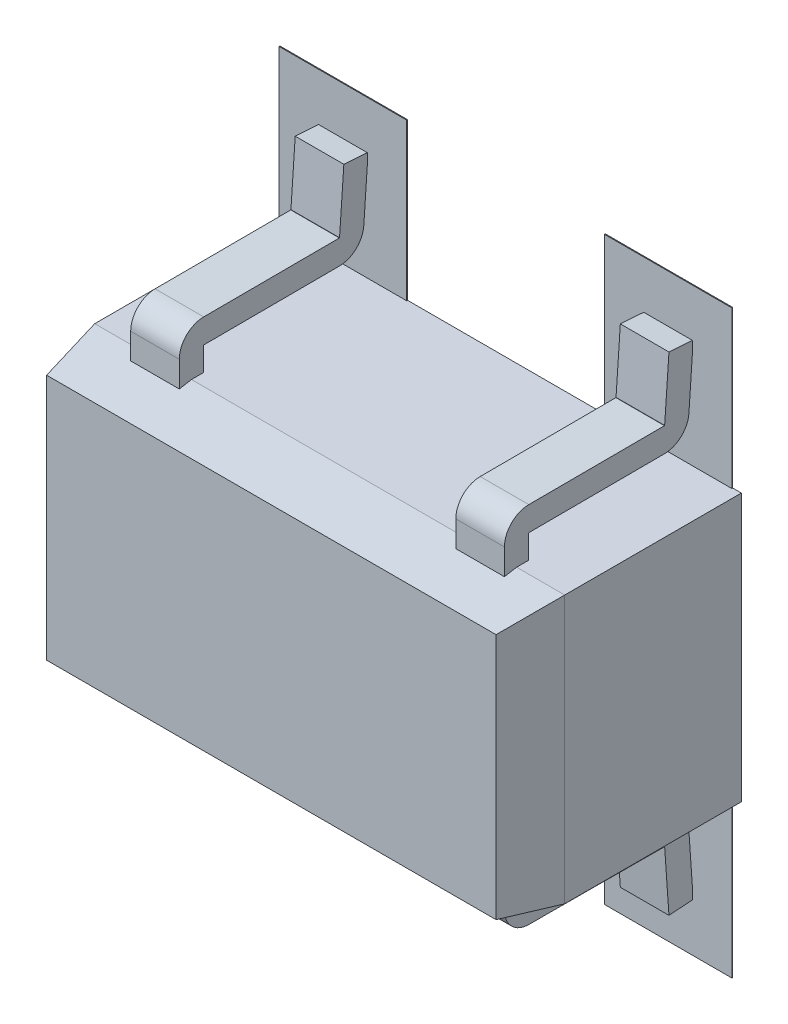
ISO-10303-21;
HEADER;
FILE_DESCRIPTION(('STEP AP214'),'2;1');
FILE_NAME('part.step','',(''),(''),'','','');
FILE_SCHEMA(('AUTOMOTIVE_DESIGN { 1 0 10303 214 1 1 1 1 }'));
ENDSEC;
DATA;
#1=APPLICATION_CONTEXT('core data for automotive mechanical design processes');
#2=APPLICATION_PROTOCOL_DEFINITION('international standard','automotive_design',2000,#1);
#3=PRODUCT_CONTEXT('',#1,'mechanical');
#4=PRODUCT('Part','Part','',(#3));
#5=PRODUCT_RELATED_PRODUCT_CATEGORY('part','',(#4));
#6=PRODUCT_DEFINITION_FORMATION('','',#4);
#7=PRODUCT_DEFINITION_CONTEXT('part definition',#1,'design');
#8=PRODUCT_DEFINITION('design','',#6,#7);
#9=PRODUCT_DEFINITION_SHAPE('','',#8);
#10=(LENGTH_UNIT() NAMED_UNIT(*) SI_UNIT(.MILLI.,.METRE.));
#11=(NAMED_UNIT(*) PLANE_ANGLE_UNIT() SI_UNIT($,.RADIAN.));
#12=(NAMED_UNIT(*) SI_UNIT($,.STERADIAN.) SOLID_ANGLE_UNIT());
#13=UNCERTAINTY_MEASURE_WITH_UNIT(LENGTH_MEASURE(1.E-05),#10,'distance_accuracy_value','');
#14=(GEOMETRIC_REPRESENTATION_CONTEXT(3) GLOBAL_UNCERTAINTY_ASSIGNED_CONTEXT((#13)) GLOBAL_UNIT_ASSIGNED_CONTEXT((#10,
#11,#12)) REPRESENTATION_CONTEXT('',''));
#15=CARTESIAN_POINT('',(0.,0.,0.));
#16=DIRECTION('',(0.,0.,1.));
#17=DIRECTION('',(1.,0.,0.));
#18=AXIS2_PLACEMENT_3D('',#15,#16,#17);
#19=CARTESIAN_POINT('',(0.,-0.793250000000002,1.34622280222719));
#20=DIRECTION('',(0.,-0.984807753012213,0.173648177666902));
#21=DIRECTION('',(0.,-0.173648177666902,-0.984807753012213));
#22=AXIS2_PLACEMENT_3D('',#19,#20,#21);
#23=PLANE('',#22);
#24=DIRECTION('',(0.,-0.173648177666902,-0.984807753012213));
#25=VECTOR('',#24,1.);
#26=CARTESIAN_POINT('',(-1.15096319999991,-0.793250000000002,1.34622280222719));
#27=LINE('',#26,#25);
#28=CARTESIAN_POINT('',(-1.15096319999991,-0.824999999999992,1.16615960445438));
#29=VERTEX_POINT('',#28);
#30=CARTESIAN_POINT('',(-1.15096319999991,-0.811775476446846,1.24115960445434));
#31=VERTEX_POINT('',#30);
#32=EDGE_CURVE('E1054',#29,#31,#27,.F.);
#33=ORIENTED_EDGE('',*,*,#32,.T.);
#34=DIRECTION('',(1.,0.,0.));
#35=VECTOR('',#34,1.);
#36=CARTESIAN_POINT('',(0.,-0.811775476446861,1.24115960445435));
#37=LINE('',#36,#35);
#38=CARTESIAN_POINT('',(-0.850963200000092,-0.811775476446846,1.24115960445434));
#39=VERTEX_POINT('',#38);
#40=EDGE_CURVE('E1014',#31,#39,#37,.T.);
#41=ORIENTED_EDGE('',*,*,#40,.T.);
#42=DIRECTION('',(0.,-0.173648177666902,-0.984807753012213));
#43=VECTOR('',#42,1.);
#44=CARTESIAN_POINT('',(-0.850963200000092,-0.793250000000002,1.34622280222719));
#45=LINE('',#44,#43);
#46=CARTESIAN_POINT('',(-0.850963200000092,-0.824999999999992,1.16615960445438));
#47=VERTEX_POINT('',#46);
#48=EDGE_CURVE('E1062',#39,#47,#45,.T.);
#49=ORIENTED_EDGE('',*,*,#48,.T.);
#50=DIRECTION('',(1.,0.,0.));
#51=VECTOR('',#50,1.);
#52=CARTESIAN_POINT('',(0.,-0.824999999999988,1.16615960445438));
#53=LINE('',#52,#51);
#54=CARTESIAN_POINT('',(-0.14898400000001,-0.824999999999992,1.16615960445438));
#55=VERTEX_POINT('',#54);
#56=EDGE_CURVE('E1064',#47,#55,#53,.T.);
#57=ORIENTED_EDGE('',*,*,#56,.T.);
#58=DIRECTION('',(0.,-0.173648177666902,-0.984807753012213));
#59=VECTOR('',#58,1.);
#60=CARTESIAN_POINT('',(-0.14898400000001,-0.793250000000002,1.34622280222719));
#61=LINE('',#60,#59);
#62=CARTESIAN_POINT('',(-0.14898400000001,-0.811775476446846,1.24115960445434));
#63=VERTEX_POINT('',#62);
#64=EDGE_CURVE('E1116',#55,#63,#61,.F.);
#65=ORIENTED_EDGE('',*,*,#64,.T.);
#66=DIRECTION('',(1.,0.,0.));
#67=VECTOR('',#66,1.);
#68=CARTESIAN_POINT('',(0.,-0.811775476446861,1.24115960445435));
#69=LINE('',#68,#67);
#70=CARTESIAN_POINT('',(0.15101600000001,-0.811775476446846,1.24115960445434));
#71=VERTEX_POINT('',#70);
#72=EDGE_CURVE('E1112',#63,#71,#69,.T.);
#73=ORIENTED_EDGE('',*,*,#72,.T.);
#74=DIRECTION('',(0.,-0.173648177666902,-0.984807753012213));
#75=VECTOR('',#74,1.);
#76=CARTESIAN_POINT('',(0.15101600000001,-0.793250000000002,1.34622280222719));
#77=LINE('',#76,#75);
#78=CARTESIAN_POINT('',(0.15101600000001,-0.824999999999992,1.16615960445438));
#79=VERTEX_POINT('',#78);
#80=EDGE_CURVE('E1108',#71,#79,#77,.T.);
#81=ORIENTED_EDGE('',*,*,#80,.T.);
#82=DIRECTION('',(1.,0.,0.));
#83=VECTOR('',#82,1.);
#84=CARTESIAN_POINT('',(0.,-0.824999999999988,1.16615960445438));
#85=LINE('',#84,#83);
#86=CARTESIAN_POINT('',(0.852995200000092,-0.824999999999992,1.16615960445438));
#87=VERTEX_POINT('',#86);
#88=EDGE_CURVE('E1104',#79,#87,#85,.T.);
#89=ORIENTED_EDGE('',*,*,#88,.T.);
#90=DIRECTION('',(0.,-0.173648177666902,-0.984807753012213));
#91=VECTOR('',#90,1.);
#92=CARTESIAN_POINT('',(0.852995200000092,-0.793250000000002,1.34622280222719));
#93=LINE('',#92,#91);
#94=CARTESIAN_POINT('',(0.852995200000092,-0.811775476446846,1.24115960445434));
#95=VERTEX_POINT('',#94);
#96=EDGE_CURVE('E1094',#87,#95,#93,.F.);
#97=ORIENTED_EDGE('',*,*,#96,.T.);
#98=DIRECTION('',(1.,0.,0.));
#99=VECTOR('',#98,1.);
#100=CARTESIAN_POINT('',(0.,-0.811775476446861,1.24115960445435));
#101=LINE('',#100,#99);
#102=CARTESIAN_POINT('',(1.15299519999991,-0.811775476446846,1.24115960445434));
#103=VERTEX_POINT('',#102);
#104=EDGE_CURVE('E1091',#95,#103,#101,.T.);
#105=ORIENTED_EDGE('',*,*,#104,.T.);
#106=DIRECTION('',(0.,-0.173648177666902,-0.984807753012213));
#107=VECTOR('',#106,1.);
#108=CARTESIAN_POINT('',(1.15299519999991,-0.793250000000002,1.34622280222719));
#109=LINE('',#108,#107);
#110=CARTESIAN_POINT('',(1.15299519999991,-0.824999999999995,1.16615960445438));
#111=VERTEX_POINT('',#110);
#112=EDGE_CURVE('E1093',#103,#111,#109,.T.);
#113=ORIENTED_EDGE('',*,*,#112,.T.);
#114=DIRECTION('',(1.,0.,0.));
#115=VECTOR('',#114,1.);
#116=CARTESIAN_POINT('',(0.,-0.824999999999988,1.16615960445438));
#117=LINE('',#116,#115);
#118=CARTESIAN_POINT('',(1.45000000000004,-0.824999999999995,1.16615960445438));
#119=VERTEX_POINT('',#118);
#120=EDGE_CURVE('E1053',#111,#119,#117,.T.);
#121=ORIENTED_EDGE('',*,*,#120,.T.);
#122=DIRECTION('',(-0.171087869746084,0.171087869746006,0.970287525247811));
#123=VECTOR('',#122,1.);
#124=CARTESIAN_POINT('',(1.45000000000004,-0.824999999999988,1.16615960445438));
#125=LINE('',#124,#123);
#126=CARTESIAN_POINT('',(1.38650000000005,-0.761500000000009,1.526286));
#127=VERTEX_POINT('',#126);
#128=EDGE_CURVE('E1050',#119,#127,#125,.T.);
#129=ORIENTED_EDGE('',*,*,#128,.T.);
#130=DIRECTION('',(1.,0.,0.));
#131=VECTOR('',#130,1.);
#132=CARTESIAN_POINT('',(0.,-0.761500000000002,1.526286));
#133=LINE('',#132,#131);
#134=CARTESIAN_POINT('',(-1.38650000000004,-0.761500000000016,1.526286));
#135=VERTEX_POINT('',#134);
#136=EDGE_CURVE('E973',#135,#127,#133,.T.);
#137=ORIENTED_EDGE('',*,*,#136,.F.);
#138=DIRECTION('',(-0.171087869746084,-0.171087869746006,-0.970287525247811));
#139=VECTOR('',#138,1.);
#140=CARTESIAN_POINT('',(-1.38650000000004,-0.761500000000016,1.526286));
#141=LINE('',#140,#139);
#142=CARTESIAN_POINT('',(-1.45000000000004,-0.824999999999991,1.16615960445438));
#143=VERTEX_POINT('',#142);
#144=EDGE_CURVE('E1052',#135,#143,#141,.T.);
#145=ORIENTED_EDGE('',*,*,#144,.T.);
#146=DIRECTION('',(1.,0.,0.));
#147=VECTOR('',#146,1.);
#148=CARTESIAN_POINT('',(0.,-0.824999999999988,1.16615960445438));
#149=LINE('',#148,#147);
#150=EDGE_CURVE('E1056',#143,#29,#149,.T.);
#151=ORIENTED_EDGE('',*,*,#150,.T.);
#152=EDGE_LOOP('',(#33,#41,#49,#57,#65,#73,#81,#89,#97,#105,#113,#121,#129,#137,#145,#151));
#153=FACE_BOUND('',#152,.T.);
#154=ADVANCED_FACE('F16',(#153),#23,.T.);
#155=CARTESIAN_POINT('',(-1.15299519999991,1.12611577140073,0.25252767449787));
#156=DIRECTION('',(0.,0.0697564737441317,0.997564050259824));
#157=DIRECTION('',(0.,-0.997564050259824,0.0697564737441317));
#158=AXIS2_PLACEMENT_3D('',#155,#156,#157);
#159=PLANE('',#158);
#160=DIRECTION('',(0.,0.997564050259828,-0.0697564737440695));
#161=VECTOR('',#160,1.);
#162=CARTESIAN_POINT('',(-1.15299519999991,1.12611577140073,0.25252767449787));
#163=LINE('',#162,#161);
#164=CARTESIAN_POINT('',(-1.15299519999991,1.12611577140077,0.252527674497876));
#165=VERTEX_POINT('',#164);
#166=CARTESIAN_POINT('',(-1.15299519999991,1.50523173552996,0.226017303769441));
#167=VERTEX_POINT('',#166);
#168=EDGE_CURVE('E1038',#165,#167,#163,.T.);
#169=ORIENTED_EDGE('',*,*,#168,.F.);
#170=DIRECTION('',(1.,0.,0.));
#171=VECTOR('',#170,1.);
#172=CARTESIAN_POINT('',(-26.4029952,1.12611577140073,0.252527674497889));
#173=LINE('',#172,#171);
#174=CARTESIAN_POINT('',(-0.852995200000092,1.12611577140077,0.252527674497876));
#175=VERTEX_POINT('',#174);
#176=EDGE_CURVE('E1011',#165,#175,#173,.T.);
#177=ORIENTED_EDGE('',*,*,#176,.T.);
#178=DIRECTION('',(0.,-0.997564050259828,0.0697564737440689));
#179=VECTOR('',#178,1.);
#180=CARTESIAN_POINT('',(-0.852995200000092,1.50523173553,0.226017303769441));
#181=LINE('',#180,#179);
#182=CARTESIAN_POINT('',(-0.852995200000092,1.50523173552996,0.226017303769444));
#183=VERTEX_POINT('',#182);
#184=EDGE_CURVE('E1017',#183,#175,#181,.T.);
#185=ORIENTED_EDGE('',*,*,#184,.F.);
#186=DIRECTION('',(1.,0.,0.));
#187=VECTOR('',#186,1.);
#188=CARTESIAN_POINT('',(-1.0029952,1.50523173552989,0.226017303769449));
#189=LINE('',#188,#187);
#190=EDGE_CURVE('E827',#167,#183,#189,.T.);
#191=ORIENTED_EDGE('',*,*,#190,.F.);
#192=EDGE_LOOP('',(#169,#177,#185,#191));
#193=FACE_BOUND('',#192,.T.);
#194=ADVANCED_FACE('F1880',(#193),#159,.T.);
#195=CARTESIAN_POINT('',(-26.4029952,1.12619947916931,0.253724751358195));
#196=DIRECTION('',(1.,0.,0.));
#197=DIRECTION('',(0.,0.,-1.));
#198=AXIS2_PLACEMENT_3D('',#195,#196,#197);
#199=CYLINDRICAL_SURFACE('',#198,0.00119999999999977);
#200=ORIENTED_EDGE('',*,*,#176,.F.);
#201=CARTESIAN_POINT('',(-1.15299519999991,1.12619947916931,0.253724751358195));
#202=DIRECTION('',(-1.,0.,0.));
#203=DIRECTION('',(0.,0.,1.));
#204=AXIS2_PLACEMENT_3D('',#201,#202,#203);
#205=CIRCLE('',#204,0.00119999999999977);
#206=CARTESIAN_POINT('',(-1.15299519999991,1.1249994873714,0.253720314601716));
#207=VERTEX_POINT('',#206);
#208=EDGE_CURVE('E1241',#207,#165,#205,.F.);
#209=ORIENTED_EDGE('',*,*,#208,.F.);
#210=DIRECTION('',(1.,0.,0.));
#211=VECTOR('',#210,1.);
#212=CARTESIAN_POINT('',(-1.15299519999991,1.12499948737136,0.253720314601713));
#213=LINE('',#212,#211);
#214=CARTESIAN_POINT('',(-0.852995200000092,1.1249994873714,0.253720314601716));
#215=VERTEX_POINT('',#214);
#216=EDGE_CURVE('E1009',#215,#207,#213,.F.);
#217=ORIENTED_EDGE('',*,*,#216,.F.);
#218=CARTESIAN_POINT('',(-0.852995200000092,1.12619947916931,0.253724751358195));
#219=DIRECTION('',(1.,0.,0.));
#220=DIRECTION('',(0.,0.,-1.));
#221=AXIS2_PLACEMENT_3D('',#218,#219,#220);
#222=CIRCLE('',#221,0.00119999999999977);
#223=EDGE_CURVE('E1239',#175,#215,#222,.F.);
#224=ORIENTED_EDGE('',*,*,#223,.F.);
#225=EDGE_LOOP('',(#200,#209,#217,#224));
#226=FACE_BOUND('',#225,.T.);
#227=ADVANCED_FACE('F1877',(#226),#199,.F.);
#228=CARTESIAN_POINT('',(-1.15299519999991,1.12190557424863,1.09051863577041));
#229=DIRECTION('',(0.,0.999993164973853,0.00369729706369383));
#230=DIRECTION('',(0.,-0.00369729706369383,0.999993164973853));
#231=AXIS2_PLACEMENT_3D('',#228,#229,#230);
#232=PLANE('',#231);
#233=DIRECTION('',(0.,0.00369729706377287,-0.999993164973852));
#234=VECTOR('',#233,1.);
#235=CARTESIAN_POINT('',(-1.15299519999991,1.12190557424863,1.09051863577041));
#236=LINE('',#235,#234);
#237=CARTESIAN_POINT('',(-1.15299519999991,1.12190557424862,1.09051863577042));
#238=VERTEX_POINT('',#237);
#239=EDGE_CURVE('E1244',#238,#207,#236,.T.);
#240=ORIENTED_EDGE('',*,*,#239,.F.);
#241=DIRECTION('',(-1.,0.,0.));
#242=VECTOR('',#241,1.);
#243=CARTESIAN_POINT('',(24.3970048,1.12190557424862,1.09051863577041));
#244=LINE('',#243,#242);
#245=CARTESIAN_POINT('',(-0.852995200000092,1.12190557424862,1.09051863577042));
#246=VERTEX_POINT('',#245);
#247=EDGE_CURVE('E985',#246,#238,#244,.T.);
#248=ORIENTED_EDGE('',*,*,#247,.F.);
#249=DIRECTION('',(0.,-0.00369729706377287,0.999993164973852));
#250=VECTOR('',#249,1.);
#251=CARTESIAN_POINT('',(-0.852995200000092,1.12499948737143,0.253720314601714));
#252=LINE('',#251,#250);
#253=EDGE_CURVE('E1238',#215,#246,#252,.T.);
#254=ORIENTED_EDGE('',*,*,#253,.F.);
#255=ORIENTED_EDGE('',*,*,#216,.T.);
#256=EDGE_LOOP('',(#240,#248,#254,#255));
#257=FACE_BOUND('',#256,.T.);
#258=ADVANCED_FACE('F1873',(#257),#232,.T.);
#259=CARTESIAN_POINT('',(24.3970048,0.970706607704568,1.08995960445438));
#260=DIRECTION('',(-1.,0.,0.));
#261=DIRECTION('',(0.,0.,1.));
#262=AXIS2_PLACEMENT_3D('',#259,#260,#261);
#263=CYLINDRICAL_SURFACE('',#262,0.151200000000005);
#264=CARTESIAN_POINT('',(-1.15299519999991,0.970706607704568,1.08995960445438));
#265=DIRECTION('',(-1.,0.,0.));
#266=DIRECTION('',(0.,0.,1.));
#267=AXIS2_PLACEMENT_3D('',#264,#265,#266);
#268=CIRCLE('',#267,0.151200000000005);
#269=CARTESIAN_POINT('',(-1.15299519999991,0.970706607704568,1.24115960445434));
#270=VERTEX_POINT('',#269);
#271=EDGE_CURVE('E1245',#270,#238,#268,.T.);
#272=ORIENTED_EDGE('',*,*,#271,.F.);
#273=DIRECTION('',(1.,0.,0.));
#274=VECTOR('',#273,1.);
#275=CARTESIAN_POINT('',(-1.15299519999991,0.970706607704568,1.24115960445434));
#276=LINE('',#275,#274);
#277=CARTESIAN_POINT('',(-0.852995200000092,0.970706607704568,1.24115960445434));
#278=VERTEX_POINT('',#277);
#279=EDGE_CURVE('E912',#278,#270,#276,.F.);
#280=ORIENTED_EDGE('',*,*,#279,.F.);
#281=CARTESIAN_POINT('',(-0.852995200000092,0.970706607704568,1.08995960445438));
#282=DIRECTION('',(-1.,0.,0.));
#283=DIRECTION('',(0.,0.,1.));
#284=AXIS2_PLACEMENT_3D('',#281,#282,#283);
#285=CIRCLE('',#284,0.151200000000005);
#286=EDGE_CURVE('E1235',#246,#278,#285,.F.);
#287=ORIENTED_EDGE('',*,*,#286,.F.);
#288=ORIENTED_EDGE('',*,*,#247,.T.);
#289=EDGE_LOOP('',(#272,#280,#287,#288));
#290=FACE_BOUND('',#289,.T.);
#291=ADVANCED_FACE('F1869',(#290),#263,.T.);
#292=CARTESIAN_POINT('',(24.3970048,0.970706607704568,1.08995960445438));
#293=DIRECTION('',(-1.,0.,0.));
#294=DIRECTION('',(0.,0.,1.));
#295=AXIS2_PLACEMENT_3D('',#292,#293,#294);
#296=CYLINDRICAL_SURFACE('',#295,0.00120000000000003);
#297=DIRECTION('',(1.,0.,0.));
#298=VECTOR('',#297,1.);
#299=CARTESIAN_POINT('',(-0.852995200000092,0.971906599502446,1.08996404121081));
#300=LINE('',#299,#298);
#301=CARTESIAN_POINT('',(-0.852995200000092,0.971906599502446,1.08996404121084));
#302=VERTEX_POINT('',#301);
#303=CARTESIAN_POINT('',(-1.15299519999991,0.971906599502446,1.08996404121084));
#304=VERTEX_POINT('',#303);
#305=EDGE_CURVE('E622',#302,#304,#300,.F.);
#306=ORIENTED_EDGE('',*,*,#305,.F.);
#307=CARTESIAN_POINT('',(-0.852995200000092,0.970706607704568,1.08995960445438));
#308=DIRECTION('',(1.,0.,0.));
#309=DIRECTION('',(0.,0.,-1.));
#310=AXIS2_PLACEMENT_3D('',#307,#308,#309);
#311=CIRCLE('',#310,0.00120000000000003);
#312=CARTESIAN_POINT('',(-0.852995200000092,0.970706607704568,1.09115960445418));
#313=VERTEX_POINT('',#312);
#314=EDGE_CURVE('E1232',#313,#302,#311,.F.);
#315=ORIENTED_EDGE('',*,*,#314,.F.);
#316=DIRECTION('',(-1.,0.,0.));
#317=VECTOR('',#316,1.);
#318=CARTESIAN_POINT('',(-0.852995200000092,0.970706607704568,1.09115960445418));
#319=LINE('',#318,#317);
#320=CARTESIAN_POINT('',(-1.15299519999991,0.970706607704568,1.09115960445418));
#321=VERTEX_POINT('',#320);
#322=EDGE_CURVE('E986',#321,#313,#319,.F.);
#323=ORIENTED_EDGE('',*,*,#322,.F.);
#324=CARTESIAN_POINT('',(-1.15299519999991,0.970706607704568,1.08995960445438));
#325=DIRECTION('',(-1.,0.,0.));
#326=DIRECTION('',(0.,0.,1.));
#327=AXIS2_PLACEMENT_3D('',#324,#325,#326);
#328=CIRCLE('',#327,0.00120000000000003);
#329=EDGE_CURVE('E633',#304,#321,#328,.F.);
#330=ORIENTED_EDGE('',*,*,#329,.F.);
#331=EDGE_LOOP('',(#306,#315,#323,#330));
#332=FACE_BOUND('',#331,.T.);
#333=ADVANCED_FACE('F1866',(#332),#296,.F.);
#334=CARTESIAN_POINT('',(-0.852995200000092,0.971906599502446,1.08996404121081));
#335=DIRECTION('',(0.,-0.999993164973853,-0.00369729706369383));
#336=DIRECTION('',(0.,0.00369729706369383,-0.999993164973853));
#337=AXIS2_PLACEMENT_3D('',#334,#335,#336);
#338=PLANE('',#337);
#339=DIRECTION('',(0.,0.00369729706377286,-0.999993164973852));
#340=VECTOR('',#339,1.);
#341=CARTESIAN_POINT('',(-0.852995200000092,0.971906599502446,1.08996404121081));
#342=LINE('',#341,#340);
#343=CARTESIAN_POINT('',(-0.852995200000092,0.975000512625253,0.25316572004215));
#344=VERTEX_POINT('',#343);
#345=EDGE_CURVE('E1231',#302,#344,#342,.T.);
#346=ORIENTED_EDGE('',*,*,#345,.F.);
#347=ORIENTED_EDGE('',*,*,#305,.T.);
#348=DIRECTION('',(0.,-0.00369729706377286,0.999993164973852));
#349=VECTOR('',#348,1.);
#350=CARTESIAN_POINT('',(-1.15299519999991,0.97500051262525,0.253165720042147));
#351=LINE('',#350,#349);
#352=CARTESIAN_POINT('',(-1.15299519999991,0.975000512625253,0.25316572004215));
#353=VERTEX_POINT('',#352);
#354=EDGE_CURVE('E627',#353,#304,#351,.T.);
#355=ORIENTED_EDGE('',*,*,#354,.F.);
#356=DIRECTION('',(1.,0.,0.));
#357=VECTOR('',#356,1.);
#358=CARTESIAN_POINT('',(-26.4029952,0.975000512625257,0.253165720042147));
#359=LINE('',#358,#357);
#360=EDGE_CURVE('E614',#344,#353,#359,.F.);
#361=ORIENTED_EDGE('',*,*,#360,.F.);
#362=EDGE_LOOP('',(#346,#347,#355,#361));
#363=FACE_BOUND('',#362,.T.);
#364=ADVANCED_FACE('F631',(#363),#338,.T.);
#365=CARTESIAN_POINT('',(-26.4029952,1.12619947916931,0.253724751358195));
#366=DIRECTION('',(1.,0.,0.));
#367=DIRECTION('',(0.,0.,-1.));
#368=AXIS2_PLACEMENT_3D('',#365,#366,#367);
#369=CYLINDRICAL_SURFACE('',#368,0.151200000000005);
#370=CARTESIAN_POINT('',(-0.852995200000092,1.12619947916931,0.253724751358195));
#371=DIRECTION('',(1.,0.,0.));
#372=DIRECTION('',(0.,0.,-1.));
#373=AXIS2_PLACEMENT_3D('',#370,#371,#372);
#374=CIRCLE('',#373,0.151200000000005);
#375=CARTESIAN_POINT('',(-0.852995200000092,1.11565230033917,0.102893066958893));
#376=VERTEX_POINT('',#375);
#377=EDGE_CURVE('E617',#344,#376,#374,.T.);
#378=ORIENTED_EDGE('',*,*,#377,.F.);
#379=ORIENTED_EDGE('',*,*,#360,.T.);
#380=CARTESIAN_POINT('',(-1.15299519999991,1.12619947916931,0.253724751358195));
#381=DIRECTION('',(1.,0.,0.));
#382=DIRECTION('',(0.,0.,-1.));
#383=AXIS2_PLACEMENT_3D('',#380,#381,#382);
#384=CIRCLE('',#383,0.151200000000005);
#385=CARTESIAN_POINT('',(-1.15299519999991,1.11565230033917,0.102893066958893));
#386=VERTEX_POINT('',#385);
#387=EDGE_CURVE('E19',#386,#353,#384,.F.);
#388=ORIENTED_EDGE('',*,*,#387,.F.);
#389=DIRECTION('',(1.,0.,0.));
#390=VECTOR('',#389,1.);
#391=CARTESIAN_POINT('',(-0.852995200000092,1.11565230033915,0.102893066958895));
#392=LINE('',#391,#390);
#393=EDGE_CURVE('E607',#376,#386,#392,.F.);
#394=ORIENTED_EDGE('',*,*,#393,.F.);
#395=EDGE_LOOP('',(#378,#379,#388,#394));
#396=FACE_BOUND('',#395,.T.);
#397=ADVANCED_FACE('F616',(#396),#369,.T.);
#398=CARTESIAN_POINT('',(0.,0.,1.526286));
#399=DIRECTION('',(0.,0.,1.));
#400=DIRECTION('',(1.,0.,0.));
#401=AXIS2_PLACEMENT_3D('',#398,#399,#400);
#402=PLANE('',#401);
#403=ORIENTED_EDGE('',*,*,#136,.T.);
#404=DIRECTION('',(0.,1.,0.));
#405=VECTOR('',#404,1.);
#406=CARTESIAN_POINT('',(1.38650000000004,0.,1.526286));
#407=LINE('',#406,#405);
#408=CARTESIAN_POINT('',(1.38650000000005,0.761500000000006,1.526286));
#409=VERTEX_POINT('',#408);
#410=EDGE_CURVE('E971',#127,#409,#407,.T.);
#411=ORIENTED_EDGE('',*,*,#410,.T.);
#412=DIRECTION('',(1.,0.,0.));
#413=VECTOR('',#412,1.);
#414=CARTESIAN_POINT('',(0.,0.761500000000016,1.526286));
#415=LINE('',#414,#413);
#416=CARTESIAN_POINT('',(-1.38650000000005,0.761500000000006,1.526286));
#417=VERTEX_POINT('',#416);
#418=EDGE_CURVE('E890',#417,#409,#415,.T.);
#419=ORIENTED_EDGE('',*,*,#418,.F.);
#420=DIRECTION('',(0.,1.,0.));
#421=VECTOR('',#420,1.);
#422=CARTESIAN_POINT('',(-1.38650000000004,0.,1.526286));
#423=LINE('',#422,#421);
#424=EDGE_CURVE('E621',#417,#135,#423,.F.);
#425=ORIENTED_EDGE('',*,*,#424,.T.);
#426=EDGE_LOOP('',(#403,#411,#419,#425));
#427=FACE_BOUND('',#426,.T.);
#428=ADVANCED_FACE('F1850',(#427),#402,.T.);
#429=CARTESIAN_POINT('',(-1.15299519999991,0.,1.24115960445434));
#430=DIRECTION('',(0.,0.,1.));
#431=DIRECTION('',(1.,0.,0.));
#432=AXIS2_PLACEMENT_3D('',#429,#430,#431);
#433=PLANE('',#432);
#434=ORIENTED_EDGE('',*,*,#279,.T.);
#435=DIRECTION('',(0.,1.,0.));
#436=VECTOR('',#435,1.);
#437=CARTESIAN_POINT('',(-1.15299519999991,0.,1.24115960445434));
#438=LINE('',#437,#436);
#439=CARTESIAN_POINT('',(-1.15299519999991,0.811775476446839,1.24115960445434));
#440=VERTEX_POINT('',#439);
#441=EDGE_CURVE('E635',#440,#270,#438,.T.);
#442=ORIENTED_EDGE('',*,*,#441,.F.);
#443=DIRECTION('',(1.,0.,0.));
#444=VECTOR('',#443,1.);
#445=CARTESIAN_POINT('',(0.,0.811775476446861,1.24115960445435));
#446=LINE('',#445,#444);
#447=CARTESIAN_POINT('',(-0.852995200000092,0.811775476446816,1.24115960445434));
#448=VERTEX_POINT('',#447);
#449=EDGE_CURVE('E948',#448,#440,#446,.F.);
#450=ORIENTED_EDGE('',*,*,#449,.F.);
#451=DIRECTION('',(0.,1.,0.));
#452=VECTOR('',#451,1.);
#453=CARTESIAN_POINT('',(-0.852995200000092,0.,1.24115960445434));
#454=LINE('',#453,#452);
#455=EDGE_CURVE('E1237',#278,#448,#454,.F.);
#456=ORIENTED_EDGE('',*,*,#455,.F.);
#457=EDGE_LOOP('',(#434,#442,#450,#456));
#458=FACE_BOUND('',#457,.T.);
#459=ADVANCED_FACE('F1852',(#458),#433,.T.);
#460=CARTESIAN_POINT('',(26.4029952,1.12619947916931,0.253724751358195));
#461=DIRECTION('',(1.,0.,0.));
#462=DIRECTION('',(0.,0.,-1.));
#463=AXIS2_PLACEMENT_3D('',#460,#461,#462);
#464=CYLINDRICAL_SURFACE('',#463,0.151200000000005);
#465=CARTESIAN_POINT('',(1.15299519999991,1.12619947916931,0.253724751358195));
#466=DIRECTION('',(1.,0.,0.));
#467=DIRECTION('',(0.,0.,-1.));
#468=AXIS2_PLACEMENT_3D('',#465,#466,#467);
#469=CIRCLE('',#468,0.151200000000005);
#470=CARTESIAN_POINT('',(1.15299519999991,1.11565230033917,0.102893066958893));
#471=VERTEX_POINT('',#470);
#472=CARTESIAN_POINT('',(1.15299519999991,0.975000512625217,0.253165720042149));
#473=VERTEX_POINT('',#472);
#474=EDGE_CURVE('E1214',#471,#473,#469,.F.);
#475=ORIENTED_EDGE('',*,*,#474,.T.);
#476=DIRECTION('',(1.,0.,0.));
#477=VECTOR('',#476,1.);
#478=CARTESIAN_POINT('',(0.852995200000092,0.975000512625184,0.253165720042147));
#479=LINE('',#478,#477);
#480=CARTESIAN_POINT('',(0.852995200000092,0.975000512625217,0.253165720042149));
#481=VERTEX_POINT('',#480);
#482=EDGE_CURVE('E910',#473,#481,#479,.F.);
#483=ORIENTED_EDGE('',*,*,#482,.T.);
#484=CARTESIAN_POINT('',(0.852995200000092,1.12619947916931,0.253724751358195));
#485=DIRECTION('',(1.,0.,0.));
#486=DIRECTION('',(0.,0.,-1.));
#487=AXIS2_PLACEMENT_3D('',#484,#485,#486);
#488=CIRCLE('',#487,0.151200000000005);
#489=CARTESIAN_POINT('',(0.852995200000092,1.11565230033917,0.102893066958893));
#490=VERTEX_POINT('',#489);
#491=EDGE_CURVE('E1217',#481,#490,#488,.T.);
#492=ORIENTED_EDGE('',*,*,#491,.T.);
#493=DIRECTION('',(1.,0.,0.));
#494=VECTOR('',#493,1.);
#495=CARTESIAN_POINT('',(0.852995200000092,1.11565230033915,0.102893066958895));
#496=LINE('',#495,#494);
#497=EDGE_CURVE('E858',#490,#471,#496,.T.);
#498=ORIENTED_EDGE('',*,*,#497,.T.);
#499=EDGE_LOOP('',(#475,#483,#492,#498));
#500=FACE_BOUND('',#499,.T.);
#501=ADVANCED_FACE('F1858',(#500),#464,.T.);
#502=CARTESIAN_POINT('',(0.852995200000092,0.971906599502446,1.08996404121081));
#503=DIRECTION('',(0.,0.999993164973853,0.00369729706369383));
#504=DIRECTION('',(0.,-0.00369729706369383,0.999993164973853));
#505=AXIS2_PLACEMENT_3D('',#502,#503,#504);
#506=PLANE('',#505);
#507=ORIENTED_EDGE('',*,*,#482,.F.);
#508=DIRECTION('',(0.,-0.00369729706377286,0.999993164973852));
#509=VECTOR('',#508,1.);
#510=CARTESIAN_POINT('',(1.15299519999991,0.97500051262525,0.253165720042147));
#511=LINE('',#510,#509);
#512=CARTESIAN_POINT('',(1.15299519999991,0.971906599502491,1.08996404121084));
#513=VERTEX_POINT('',#512);
#514=EDGE_CURVE('E1213',#473,#513,#511,.T.);
#515=ORIENTED_EDGE('',*,*,#514,.T.);
#516=DIRECTION('',(-1.,0.,0.));
#517=VECTOR('',#516,1.);
#518=CARTESIAN_POINT('',(-24.3970048,0.971906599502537,1.08996404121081));
#519=LINE('',#518,#517);
#520=CARTESIAN_POINT('',(0.852995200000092,0.971906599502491,1.08996404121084));
#521=VERTEX_POINT('',#520);
#522=EDGE_CURVE('E875',#513,#521,#519,.T.);
#523=ORIENTED_EDGE('',*,*,#522,.T.);
#524=DIRECTION('',(0.,0.00369729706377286,-0.999993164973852));
#525=VECTOR('',#524,1.);
#526=CARTESIAN_POINT('',(0.852995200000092,0.971906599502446,1.08996404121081));
#527=LINE('',#526,#525);
#528=EDGE_CURVE('E1220',#521,#481,#527,.T.);
#529=ORIENTED_EDGE('',*,*,#528,.T.);
#530=EDGE_LOOP('',(#507,#515,#523,#529));
#531=FACE_BOUND('',#530,.T.);
#532=ADVANCED_FACE('F1944',(#531),#506,.F.);
#533=CARTESIAN_POINT('',(-24.3970048,0.970706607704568,1.08995960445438));
#534=DIRECTION('',(-1.,0.,0.));
#535=DIRECTION('',(0.,0.,1.));
#536=AXIS2_PLACEMENT_3D('',#533,#534,#535);
#537=CYLINDRICAL_SURFACE('',#536,0.00120000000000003);
#538=ORIENTED_EDGE('',*,*,#522,.F.);
#539=CARTESIAN_POINT('',(1.15299519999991,0.970706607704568,1.08995960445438));
#540=DIRECTION('',(-1.,0.,0.));
#541=DIRECTION('',(0.,0.,1.));
#542=AXIS2_PLACEMENT_3D('',#539,#540,#541);
#543=CIRCLE('',#542,0.00120000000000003);
#544=CARTESIAN_POINT('',(1.15299519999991,0.970706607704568,1.09115960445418));
#545=VERTEX_POINT('',#544);
#546=EDGE_CURVE('E1210',#513,#545,#543,.F.);
#547=ORIENTED_EDGE('',*,*,#546,.T.);
#548=DIRECTION('',(1.,0.,0.));
#549=VECTOR('',#548,1.);
#550=CARTESIAN_POINT('',(0.852995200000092,0.970706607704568,1.09115960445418));
#551=LINE('',#550,#549);
#552=CARTESIAN_POINT('',(0.852995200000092,0.970706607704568,1.09115960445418));
#553=VERTEX_POINT('',#552);
#554=EDGE_CURVE('E900',#545,#553,#551,.F.);
#555=ORIENTED_EDGE('',*,*,#554,.T.);
#556=CARTESIAN_POINT('',(0.852995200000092,0.970706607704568,1.08995960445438));
#557=DIRECTION('',(-1.,0.,0.));
#558=DIRECTION('',(0.,0.,1.));
#559=AXIS2_PLACEMENT_3D('',#556,#557,#558);
#560=CIRCLE('',#559,0.00120000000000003);
#561=EDGE_CURVE('E940',#553,#521,#560,.T.);
#562=ORIENTED_EDGE('',*,*,#561,.T.);
#563=EDGE_LOOP('',(#538,#547,#555,#562));
#564=FACE_BOUND('',#563,.T.);
#565=ADVANCED_FACE('F1940',(#564),#537,.F.);
#566=CARTESIAN_POINT('',(1.15299519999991,0.,1.24115960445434));
#567=DIRECTION('',(0.,0.,-1.));
#568=DIRECTION('',(-1.,0.,0.));
#569=AXIS2_PLACEMENT_3D('',#566,#567,#568);
#570=PLANE('',#569);
#571=DIRECTION('',(0.,1.,0.));
#572=VECTOR('',#571,1.);
#573=CARTESIAN_POINT('',(0.852995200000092,0.,1.24115960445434));
#574=LINE('',#573,#572);
#575=CARTESIAN_POINT('',(0.852995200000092,0.970706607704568,1.24115960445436));
#576=VERTEX_POINT('',#575);
#577=CARTESIAN_POINT('',(0.852995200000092,0.811775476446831,1.24115960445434));
#578=VERTEX_POINT('',#577);
#579=EDGE_CURVE('E941',#576,#578,#574,.F.);
#580=ORIENTED_EDGE('',*,*,#579,.T.);
#581=DIRECTION('',(1.,0.,0.));
#582=VECTOR('',#581,1.);
#583=CARTESIAN_POINT('',(0.,0.811775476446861,1.24115960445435));
#584=LINE('',#583,#582);
#585=CARTESIAN_POINT('',(1.15299519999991,0.811775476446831,1.24115960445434));
#586=VERTEX_POINT('',#585);
#587=EDGE_CURVE('E883',#586,#578,#584,.F.);
#588=ORIENTED_EDGE('',*,*,#587,.F.);
#589=DIRECTION('',(0.,1.,0.));
#590=VECTOR('',#589,1.);
#591=CARTESIAN_POINT('',(1.15299519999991,0.,1.24115960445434));
#592=LINE('',#591,#590);
#593=CARTESIAN_POINT('',(1.15299519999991,0.970706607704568,1.24115960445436));
#594=VERTEX_POINT('',#593);
#595=EDGE_CURVE('E879',#586,#594,#592,.T.);
#596=ORIENTED_EDGE('',*,*,#595,.T.);
#597=DIRECTION('',(-1.,0.,0.));
#598=VECTOR('',#597,1.);
#599=CARTESIAN_POINT('',(-24.3970048,0.970706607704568,1.24115960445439));
#600=LINE('',#599,#598);
#601=EDGE_CURVE('E873',#576,#594,#600,.F.);
#602=ORIENTED_EDGE('',*,*,#601,.F.);
#603=EDGE_LOOP('',(#580,#588,#596,#602));
#604=FACE_BOUND('',#603,.T.);
#605=ADVANCED_FACE('F1936',(#604),#570,.F.);
#606=CARTESIAN_POINT('',(-24.3970048,0.970706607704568,1.08995960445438));
#607=DIRECTION('',(-1.,0.,0.));
#608=DIRECTION('',(0.,0.,1.));
#609=AXIS2_PLACEMENT_3D('',#606,#607,#608);
#610=CYLINDRICAL_SURFACE('',#609,0.151200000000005);
#611=CARTESIAN_POINT('',(0.852995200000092,0.970706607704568,1.08995960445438));
#612=DIRECTION('',(-1.,0.,0.));
#613=DIRECTION('',(0.,0.,1.));
#614=AXIS2_PLACEMENT_3D('',#611,#612,#613);
#615=CIRCLE('',#614,0.151200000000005);
#616=CARTESIAN_POINT('',(0.852995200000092,1.12190557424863,1.09051863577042));
#617=VERTEX_POINT('',#616);
#618=EDGE_CURVE('E1223',#617,#576,#615,.F.);
#619=ORIENTED_EDGE('',*,*,#618,.T.);
#620=ORIENTED_EDGE('',*,*,#601,.T.);
#621=CARTESIAN_POINT('',(1.15299519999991,0.970706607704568,1.08995960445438));
#622=DIRECTION('',(-1.,0.,0.));
#623=DIRECTION('',(0.,0.,1.));
#624=AXIS2_PLACEMENT_3D('',#621,#622,#623);
#625=CIRCLE('',#624,0.151200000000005);
#626=CARTESIAN_POINT('',(1.15299519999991,1.12190557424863,1.09051863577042));
#627=VERTEX_POINT('',#626);
#628=EDGE_CURVE('E1207',#594,#627,#625,.T.);
#629=ORIENTED_EDGE('',*,*,#628,.T.);
#630=DIRECTION('',(1.,0.,0.));
#631=VECTOR('',#630,1.);
#632=CARTESIAN_POINT('',(1.15299519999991,1.12190557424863,1.09051863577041));
#633=LINE('',#632,#631);
#634=EDGE_CURVE('E871',#627,#617,#633,.F.);
#635=ORIENTED_EDGE('',*,*,#634,.T.);
#636=EDGE_LOOP('',(#619,#620,#629,#635));
#637=FACE_BOUND('',#636,.T.);
#638=ADVANCED_FACE('F1932',(#637),#610,.T.);
#639=CARTESIAN_POINT('',(1.15299519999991,1.12190557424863,1.09051863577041));
#640=DIRECTION('',(0.,-0.999993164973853,-0.00369729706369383));
#641=DIRECTION('',(0.,0.00369729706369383,-0.999993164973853));
#642=AXIS2_PLACEMENT_3D('',#639,#640,#641);
#643=PLANE('',#642);
#644=DIRECTION('',(1.,0.,0.));
#645=VECTOR('',#644,1.);
#646=CARTESIAN_POINT('',(26.4029952,1.12499948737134,0.253720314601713));
#647=LINE('',#646,#645);
#648=CARTESIAN_POINT('',(1.15299519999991,1.12499948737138,0.253720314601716));
#649=VERTEX_POINT('',#648);
#650=CARTESIAN_POINT('',(0.852995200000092,1.12499948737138,0.253720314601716));
#651=VERTEX_POINT('',#650);
#652=EDGE_CURVE('E859',#649,#651,#647,.F.);
#653=ORIENTED_EDGE('',*,*,#652,.T.);
#654=DIRECTION('',(0.,-0.00369729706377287,0.999993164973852));
#655=VECTOR('',#654,1.);
#656=CARTESIAN_POINT('',(0.852995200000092,1.12499948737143,0.253720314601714));
#657=LINE('',#656,#655);
#658=EDGE_CURVE('E1226',#651,#617,#657,.T.);
#659=ORIENTED_EDGE('',*,*,#658,.T.);
#660=ORIENTED_EDGE('',*,*,#634,.F.);
#661=DIRECTION('',(0.,0.00369729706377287,-0.999993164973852));
#662=VECTOR('',#661,1.);
#663=CARTESIAN_POINT('',(1.15299519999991,1.12190557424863,1.09051863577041));
#664=LINE('',#663,#662);
#665=EDGE_CURVE('E1206',#627,#649,#664,.T.);
#666=ORIENTED_EDGE('',*,*,#665,.T.);
#667=EDGE_LOOP('',(#653,#659,#660,#666));
#668=FACE_BOUND('',#667,.T.);
#669=ADVANCED_FACE('F1928',(#668),#643,.F.);
#670=CARTESIAN_POINT('',(26.4029952,1.12619947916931,0.253724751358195));
#671=DIRECTION('',(1.,0.,0.));
#672=DIRECTION('',(0.,0.,-1.));
#673=AXIS2_PLACEMENT_3D('',#670,#671,#672);
#674=CYLINDRICAL_SURFACE('',#673,0.00119999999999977);
#675=DIRECTION('',(1.,0.,0.));
#676=VECTOR('',#675,1.);
#677=CARTESIAN_POINT('',(1.15299519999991,1.12611577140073,0.25252767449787));
#678=LINE('',#677,#676);
#679=CARTESIAN_POINT('',(1.15299519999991,1.12611577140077,0.252527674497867));
#680=VERTEX_POINT('',#679);
#681=CARTESIAN_POINT('',(0.852995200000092,1.12611577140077,0.252527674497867));
#682=VERTEX_POINT('',#681);
#683=EDGE_CURVE('E856',#680,#682,#678,.F.);
#684=ORIENTED_EDGE('',*,*,#683,.T.);
#685=CARTESIAN_POINT('',(0.852995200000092,1.12619947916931,0.253724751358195));
#686=DIRECTION('',(1.,0.,0.));
#687=DIRECTION('',(0.,0.,-1.));
#688=AXIS2_PLACEMENT_3D('',#685,#686,#687);
#689=CIRCLE('',#688,0.00119999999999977);
#690=EDGE_CURVE('E1227',#682,#651,#689,.F.);
#691=ORIENTED_EDGE('',*,*,#690,.T.);
#692=ORIENTED_EDGE('',*,*,#652,.F.);
#693=CARTESIAN_POINT('',(1.15299519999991,1.12619947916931,0.253724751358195));
#694=DIRECTION('',(1.,0.,0.));
#695=DIRECTION('',(0.,0.,-1.));
#696=AXIS2_PLACEMENT_3D('',#693,#694,#695);
#697=CIRCLE('',#696,0.00119999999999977);
#698=EDGE_CURVE('E1203',#649,#680,#697,.T.);
#699=ORIENTED_EDGE('',*,*,#698,.T.);
#700=EDGE_LOOP('',(#684,#691,#692,#699));
#701=FACE_BOUND('',#700,.T.);
#702=ADVANCED_FACE('F1924',(#701),#674,.F.);
#703=CARTESIAN_POINT('',(1.15299519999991,1.12611577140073,0.25252767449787));
#704=DIRECTION('',(0.,-0.0697564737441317,-0.997564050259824));
#705=DIRECTION('',(0.,0.997564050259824,-0.0697564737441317));
#706=AXIS2_PLACEMENT_3D('',#703,#704,#705);
#707=PLANE('',#706);
#708=DIRECTION('',(1.,0.,0.));
#709=VECTOR('',#708,1.);
#710=CARTESIAN_POINT('',(1.0029952,1.50523173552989,0.226017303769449));
#711=LINE('',#710,#709);
#712=CARTESIAN_POINT('',(1.15299519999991,1.50523173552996,0.226017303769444));
#713=VERTEX_POINT('',#712);
#714=CARTESIAN_POINT('',(0.852995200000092,1.50523173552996,0.22601730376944));
#715=VERTEX_POINT('',#714);
#716=EDGE_CURVE('E866',#713,#715,#711,.F.);
#717=ORIENTED_EDGE('',*,*,#716,.T.);
#718=DIRECTION('',(0.,-0.997564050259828,0.0697564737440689));
#719=VECTOR('',#718,1.);
#720=CARTESIAN_POINT('',(0.852995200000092,1.50523173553,0.226017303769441));
#721=LINE('',#720,#719);
#722=EDGE_CURVE('E947',#715,#682,#721,.T.);
#723=ORIENTED_EDGE('',*,*,#722,.T.);
#724=ORIENTED_EDGE('',*,*,#683,.F.);
#725=DIRECTION('',(0.,0.997564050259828,-0.0697564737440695));
#726=VECTOR('',#725,1.);
#727=CARTESIAN_POINT('',(1.15299519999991,1.12611577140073,0.25252767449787));
#728=LINE('',#727,#726);
#729=EDGE_CURVE('E863',#680,#713,#728,.T.);
#730=ORIENTED_EDGE('',*,*,#729,.T.);
#731=EDGE_LOOP('',(#717,#723,#724,#730));
#732=FACE_BOUND('',#731,.T.);
#733=ADVANCED_FACE('F1920',(#732),#707,.F.);
#734=CARTESIAN_POINT('',(0.852995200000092,1.11565230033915,0.102893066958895));
#735=DIRECTION('',(0.,0.0697564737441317,0.997564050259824));
#736=DIRECTION('',(0.,-0.997564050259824,0.0697564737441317));
#737=AXIS2_PLACEMENT_3D('',#734,#735,#736);
#738=PLANE('',#737);
#739=ORIENTED_EDGE('',*,*,#497,.F.);
#740=DIRECTION('',(0.,0.997564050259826,-0.0697564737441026));
#741=VECTOR('',#740,1.);
#742=CARTESIAN_POINT('',(0.852995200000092,1.11565230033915,0.102893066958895));
#743=LINE('',#742,#741);
#744=CARTESIAN_POINT('',(0.852995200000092,1.42110118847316,0.0815340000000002));
#745=VERTEX_POINT('',#744);
#746=EDGE_CURVE('E925',#490,#745,#743,.T.);
#747=ORIENTED_EDGE('',*,*,#746,.T.);
#748=DIRECTION('',(1.,0.,0.));
#749=VECTOR('',#748,1.);
#750=CARTESIAN_POINT('',(0.,1.42110118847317,0.081534));
#751=LINE('',#750,#749);
#752=CARTESIAN_POINT('',(1.15299519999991,1.42110118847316,0.0815340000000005));
#753=VERTEX_POINT('',#752);
#754=EDGE_CURVE('E916',#753,#745,#751,.F.);
#755=ORIENTED_EDGE('',*,*,#754,.F.);
#756=DIRECTION('',(0.,-0.997564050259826,0.0697564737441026));
#757=VECTOR('',#756,1.);
#758=CARTESIAN_POINT('',(1.15299519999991,1.42110118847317,0.0815340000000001));
#759=LINE('',#758,#757);
#760=EDGE_CURVE('E903',#753,#471,#759,.T.);
#761=ORIENTED_EDGE('',*,*,#760,.T.);
#762=EDGE_LOOP('',(#739,#747,#755,#761));
#763=FACE_BOUND('',#762,.T.);
#764=ADVANCED_FACE('F1913',(#763),#738,.F.);
#765=CARTESIAN_POINT('',(1.0029952,1.49999999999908,0.151199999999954));
#766=DIRECTION('',(0.,-0.997564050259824,0.0697564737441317));
#767=DIRECTION('',(0.,-0.0697564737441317,-0.997564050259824));
#768=AXIS2_PLACEMENT_3D('',#765,#766,#767);
#769=PLANE('',#768);
#770=ORIENTED_EDGE('',*,*,#716,.F.);
#771=DIRECTION('',(0.,-0.0697564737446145,-0.99756405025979));
#772=VECTOR('',#771,1.);
#773=CARTESIAN_POINT('',(1.15299519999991,1.50523173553,0.226017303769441));
#774=LINE('',#773,#772);
#775=CARTESIAN_POINT('',(1.15299519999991,1.49512847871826,0.0815340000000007));
#776=VERTEX_POINT('',#775);
#777=EDGE_CURVE('E860',#713,#776,#774,.T.);
#778=ORIENTED_EDGE('',*,*,#777,.T.);
#779=DIRECTION('',(1.,0.,0.));
#780=VECTOR('',#779,1.);
#781=CARTESIAN_POINT('',(0.,1.49512847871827,0.081534));
#782=LINE('',#781,#780);
#783=CARTESIAN_POINT('',(0.852995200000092,1.49512847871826,0.081534));
#784=VERTEX_POINT('',#783);
#785=EDGE_CURVE('E934',#784,#776,#782,.T.);
#786=ORIENTED_EDGE('',*,*,#785,.F.);
#787=DIRECTION('',(0.,0.0697564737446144,0.99756405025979));
#788=VECTOR('',#787,1.);
#789=CARTESIAN_POINT('',(0.852995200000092,1.49512847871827,0.0815340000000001));
#790=LINE('',#789,#788);
#791=EDGE_CURVE('E944',#784,#715,#790,.T.);
#792=ORIENTED_EDGE('',*,*,#791,.T.);
#793=EDGE_LOOP('',(#770,#778,#786,#792));
#794=FACE_BOUND('',#793,.T.);
#795=ADVANCED_FACE('F1906',(#794),#769,.F.);
#796=CARTESIAN_POINT('',(-0.852995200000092,1.11565230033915,0.102893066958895));
#797=DIRECTION('',(0.,-0.0697564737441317,-0.997564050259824));
#798=DIRECTION('',(0.,0.997564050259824,-0.0697564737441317));
#799=AXIS2_PLACEMENT_3D('',#796,#797,#798);
#800=PLANE('',#799);
#801=DIRECTION('',(0.,-0.997564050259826,0.0697564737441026));
#802=VECTOR('',#801,1.);
#803=CARTESIAN_POINT('',(-1.15299519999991,1.42110118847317,0.0815340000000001));
#804=LINE('',#803,#802);
#805=CARTESIAN_POINT('',(-1.15299519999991,1.42110118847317,0.081534));
#806=VERTEX_POINT('',#805);
#807=EDGE_CURVE('E630',#806,#386,#804,.T.);
#808=ORIENTED_EDGE('',*,*,#807,.F.);
#809=DIRECTION('',(1.,0.,0.));
#810=VECTOR('',#809,1.);
#811=CARTESIAN_POINT('',(0.,1.42110118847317,0.081534));
#812=LINE('',#811,#810);
#813=CARTESIAN_POINT('',(-0.852995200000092,1.42110118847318,0.0815339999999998));
#814=VERTEX_POINT('',#813);
#815=EDGE_CURVE('E977',#814,#806,#812,.F.);
#816=ORIENTED_EDGE('',*,*,#815,.F.);
#817=DIRECTION('',(0.,0.997564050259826,-0.0697564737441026));
#818=VECTOR('',#817,1.);
#819=CARTESIAN_POINT('',(-0.852995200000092,1.11565230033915,0.102893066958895));
#820=LINE('',#819,#818);
#821=EDGE_CURVE('E1043',#376,#814,#820,.T.);
#822=ORIENTED_EDGE('',*,*,#821,.F.);
#823=ORIENTED_EDGE('',*,*,#393,.T.);
#824=EDGE_LOOP('',(#808,#816,#822,#823));
#825=FACE_BOUND('',#824,.T.);
#826=ADVANCED_FACE('F1904',(#825),#800,.T.);
#827=CARTESIAN_POINT('',(-1.0029952,1.49999999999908,0.151199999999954));
#828=DIRECTION('',(0.,0.997564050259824,-0.0697564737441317));
#829=DIRECTION('',(0.,0.0697564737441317,0.997564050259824));
#830=AXIS2_PLACEMENT_3D('',#827,#828,#829);
#831=PLANE('',#830);
#832=DIRECTION('',(0.,0.0697564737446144,0.99756405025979));
#833=VECTOR('',#832,1.);
#834=CARTESIAN_POINT('',(-0.852995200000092,1.49512847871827,0.0815340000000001));
#835=LINE('',#834,#833);
#836=CARTESIAN_POINT('',(-0.852995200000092,1.49512847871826,0.081534));
#837=VERTEX_POINT('',#836);
#838=EDGE_CURVE('E988',#837,#183,#835,.T.);
#839=ORIENTED_EDGE('',*,*,#838,.F.);
#840=DIRECTION('',(1.,0.,0.));
#841=VECTOR('',#840,1.);
#842=CARTESIAN_POINT('',(0.,1.49512847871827,0.081534));
#843=LINE('',#842,#841);
#844=CARTESIAN_POINT('',(-1.15299519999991,1.49512847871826,0.0815340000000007));
#845=VERTEX_POINT('',#844);
#846=EDGE_CURVE('E1023',#845,#837,#843,.T.);
#847=ORIENTED_EDGE('',*,*,#846,.F.);
#848=DIRECTION('',(0.,-0.0697564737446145,-0.99756405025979));
#849=VECTOR('',#848,1.);
#850=CARTESIAN_POINT('',(-1.15299519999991,1.50523173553,0.226017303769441));
#851=LINE('',#850,#849);
#852=EDGE_CURVE('E1030',#167,#845,#851,.T.);
#853=ORIENTED_EDGE('',*,*,#852,.F.);
#854=ORIENTED_EDGE('',*,*,#190,.T.);
#855=EDGE_LOOP('',(#839,#847,#853,#854));
#856=FACE_BOUND('',#855,.T.);
#857=ADVANCED_FACE('F1899',(#856),#831,.T.);
#858=CARTESIAN_POINT('',(1.0029952,-1.49999999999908,0.151199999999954));
#859=DIRECTION('',(0.,-0.997564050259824,-0.0697564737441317));
#860=DIRECTION('',(0.,0.0697564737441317,-0.997564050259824));
#861=AXIS2_PLACEMENT_3D('',#858,#859,#860);
#862=PLANE('',#861);
#863=DIRECTION('',(0.,-0.0697564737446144,0.99756405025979));
#864=VECTOR('',#863,1.);
#865=CARTESIAN_POINT('',(0.852995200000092,-1.49512847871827,0.0815340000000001));
#866=LINE('',#865,#864);
#867=CARTESIAN_POINT('',(0.852995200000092,-1.49512847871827,0.081534));
#868=VERTEX_POINT('',#867);
#869=CARTESIAN_POINT('',(0.852995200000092,-1.50523173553,0.226017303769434));
#870=VERTEX_POINT('',#869);
#871=EDGE_CURVE('E806',#868,#870,#866,.T.);
#872=ORIENTED_EDGE('',*,*,#871,.F.);
#873=DIRECTION('',(1.,0.,0.));
#874=VECTOR('',#873,1.);
#875=CARTESIAN_POINT('',(0.,-1.49512847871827,0.081534));
#876=LINE('',#875,#874);
#877=CARTESIAN_POINT('',(1.15299519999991,-1.49512847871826,0.081534));
#878=VERTEX_POINT('',#877);
#879=EDGE_CURVE('E790',#878,#868,#876,.F.);
#880=ORIENTED_EDGE('',*,*,#879,.F.);
#881=DIRECTION('',(0.,0.0697564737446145,-0.99756405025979));
#882=VECTOR('',#881,1.);
#883=CARTESIAN_POINT('',(1.15299519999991,-1.50523173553,0.226017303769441));
#884=LINE('',#883,#882);
#885=CARTESIAN_POINT('',(1.15299519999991,-1.50523173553,0.226017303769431));
#886=VERTEX_POINT('',#885);
#887=EDGE_CURVE('E847',#886,#878,#884,.T.);
#888=ORIENTED_EDGE('',*,*,#887,.F.);
#889=DIRECTION('',(1.,0.,0.));
#890=VECTOR('',#889,1.);
#891=CARTESIAN_POINT('',(1.15299519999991,-1.50523173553,0.226017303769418));
#892=LINE('',#891,#890);
#893=EDGE_CURVE('E825',#870,#886,#892,.T.);
#894=ORIENTED_EDGE('',*,*,#893,.F.);
#895=EDGE_LOOP('',(#872,#880,#888,#894));
#896=FACE_BOUND('',#895,.T.);
#897=ADVANCED_FACE('F1746',(#896),#862,.T.);
#898=CARTESIAN_POINT('',(1.15299519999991,-1.12611577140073,0.25252767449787));
#899=DIRECTION('',(0.,-0.0697564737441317,0.997564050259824));
#900=DIRECTION('',(0.,-0.997564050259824,-0.0697564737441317));
#901=AXIS2_PLACEMENT_3D('',#898,#899,#900);
#902=PLANE('',#901);
#903=DIRECTION('',(0.,-0.997564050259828,-0.0697564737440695));
#904=VECTOR('',#903,1.);
#905=CARTESIAN_POINT('',(1.15299519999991,-1.12611577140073,0.25252767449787));
#906=LINE('',#905,#904);
#907=CARTESIAN_POINT('',(1.15299519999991,-1.12611577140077,0.252527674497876));
#908=VERTEX_POINT('',#907);
#909=EDGE_CURVE('E849',#908,#886,#906,.T.);
#910=ORIENTED_EDGE('',*,*,#909,.F.);
#911=DIRECTION('',(-1.,0.,0.));
#912=VECTOR('',#911,1.);
#913=CARTESIAN_POINT('',(26.4029952,-1.12611577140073,0.252527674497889));
#914=LINE('',#913,#912);
#915=CARTESIAN_POINT('',(0.852995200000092,-1.12611577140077,0.252527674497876));
#916=VERTEX_POINT('',#915);
#917=EDGE_CURVE('E822',#908,#916,#914,.T.);
#918=ORIENTED_EDGE('',*,*,#917,.T.);
#919=DIRECTION('',(0.,0.997564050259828,0.0697564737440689));
#920=VECTOR('',#919,1.);
#921=CARTESIAN_POINT('',(0.852995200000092,-1.50523173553,0.226017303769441));
#922=LINE('',#921,#920);
#923=EDGE_CURVE('E831',#870,#916,#922,.T.);
#924=ORIENTED_EDGE('',*,*,#923,.F.);
#925=ORIENTED_EDGE('',*,*,#893,.T.);
#926=EDGE_LOOP('',(#910,#918,#924,#925));
#927=FACE_BOUND('',#926,.T.);
#928=ADVANCED_FACE('F1751',(#927),#902,.T.);
#929=CARTESIAN_POINT('',(26.4029952,-1.12619947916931,0.253724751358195));
#930=DIRECTION('',(-1.,0.,0.));
#931=DIRECTION('',(0.,0.,1.));
#932=AXIS2_PLACEMENT_3D('',#929,#930,#931);
#933=CYLINDRICAL_SURFACE('',#932,0.00119999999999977);
#934=ORIENTED_EDGE('',*,*,#917,.F.);
#935=CARTESIAN_POINT('',(1.15299519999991,-1.12619947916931,0.253724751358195));
#936=DIRECTION('',(1.,0.,0.));
#937=DIRECTION('',(0.,0.,-1.));
#938=AXIS2_PLACEMENT_3D('',#935,#936,#937);
#939=CIRCLE('',#938,0.00119999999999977);
#940=CARTESIAN_POINT('',(1.15299519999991,-1.1249994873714,0.253720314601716));
#941=VERTEX_POINT('',#940);
#942=EDGE_CURVE('E1189',#941,#908,#939,.F.);
#943=ORIENTED_EDGE('',*,*,#942,.F.);
#944=DIRECTION('',(1.,0.,0.));
#945=VECTOR('',#944,1.);
#946=CARTESIAN_POINT('',(1.15299519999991,-1.12499948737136,0.253720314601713));
#947=LINE('',#946,#945);
#948=CARTESIAN_POINT('',(0.852995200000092,-1.1249994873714,0.253720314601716));
#949=VERTEX_POINT('',#948);
#950=EDGE_CURVE('E820',#949,#941,#947,.T.);
#951=ORIENTED_EDGE('',*,*,#950,.F.);
#952=CARTESIAN_POINT('',(0.852995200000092,-1.12619947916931,0.253724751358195));
#953=DIRECTION('',(-1.,0.,0.));
#954=DIRECTION('',(0.,0.,1.));
#955=AXIS2_PLACEMENT_3D('',#952,#953,#954);
#956=CIRCLE('',#955,0.00119999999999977);
#957=EDGE_CURVE('E1187',#916,#949,#956,.F.);
#958=ORIENTED_EDGE('',*,*,#957,.F.);
#959=EDGE_LOOP('',(#934,#943,#951,#958));
#960=FACE_BOUND('',#959,.T.);
#961=ADVANCED_FACE('F1758',(#960),#933,.F.);
#962=CARTESIAN_POINT('',(1.15299519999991,-1.12190557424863,1.09051863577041));
#963=DIRECTION('',(0.,-0.999993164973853,0.00369729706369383));
#964=DIRECTION('',(0.,-0.00369729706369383,-0.999993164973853));
#965=AXIS2_PLACEMENT_3D('',#962,#963,#964);
#966=PLANE('',#965);
#967=DIRECTION('',(0.,-0.00369729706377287,-0.999993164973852));
#968=VECTOR('',#967,1.);
#969=CARTESIAN_POINT('',(1.15299519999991,-1.12190557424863,1.09051863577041));
#970=LINE('',#969,#968);
#971=CARTESIAN_POINT('',(1.15299519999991,-1.12190557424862,1.09051863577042));
#972=VERTEX_POINT('',#971);
#973=EDGE_CURVE('E1192',#972,#941,#970,.T.);
#974=ORIENTED_EDGE('',*,*,#973,.F.);
#975=DIRECTION('',(1.,0.,0.));
#976=VECTOR('',#975,1.);
#977=CARTESIAN_POINT('',(-24.3970048,-1.12190557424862,1.09051863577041));
#978=LINE('',#977,#976);
#979=CARTESIAN_POINT('',(0.852995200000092,-1.12190557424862,1.09051863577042));
#980=VERTEX_POINT('',#979);
#981=EDGE_CURVE('E818',#980,#972,#978,.T.);
#982=ORIENTED_EDGE('',*,*,#981,.F.);
#983=DIRECTION('',(0.,0.00369729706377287,0.999993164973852));
#984=VECTOR('',#983,1.);
#985=CARTESIAN_POINT('',(0.852995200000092,-1.12499948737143,0.253720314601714));
#986=LINE('',#985,#984);
#987=EDGE_CURVE('E1186',#949,#980,#986,.T.);
#988=ORIENTED_EDGE('',*,*,#987,.F.);
#989=ORIENTED_EDGE('',*,*,#950,.T.);
#990=EDGE_LOOP('',(#974,#982,#988,#989));
#991=FACE_BOUND('',#990,.T.);
#992=ADVANCED_FACE('F1761',(#991),#966,.T.);
#993=CARTESIAN_POINT('',(-24.3970048,-0.970706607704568,1.08995960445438));
#994=DIRECTION('',(1.,0.,0.));
#995=DIRECTION('',(0.,0.,-1.));
#996=AXIS2_PLACEMENT_3D('',#993,#994,#995);
#997=CYLINDRICAL_SURFACE('',#996,0.151200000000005);
#998=CARTESIAN_POINT('',(1.15299519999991,-0.970706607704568,1.08995960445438));
#999=DIRECTION('',(1.,0.,0.));
#1000=DIRECTION('',(0.,0.,-1.));
#1001=AXIS2_PLACEMENT_3D('',#998,#999,#1000);
#1002=CIRCLE('',#1001,0.151200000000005);
#1003=CARTESIAN_POINT('',(1.15299519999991,-0.970706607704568,1.24115960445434));
#1004=VERTEX_POINT('',#1003);
#1005=EDGE_CURVE('E1193',#1004,#972,#1002,.T.);
#1006=ORIENTED_EDGE('',*,*,#1005,.F.);
#1007=DIRECTION('',(1.,0.,0.));
#1008=VECTOR('',#1007,1.);
#1009=CARTESIAN_POINT('',(1.15299519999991,-0.970706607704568,1.24115960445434));
#1010=LINE('',#1009,#1008);
#1011=CARTESIAN_POINT('',(0.852995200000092,-0.970706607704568,1.24115960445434));
#1012=VERTEX_POINT('',#1011);
#1013=EDGE_CURVE('E803',#1012,#1004,#1010,.T.);
#1014=ORIENTED_EDGE('',*,*,#1013,.F.);
#1015=CARTESIAN_POINT('',(0.852995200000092,-0.970706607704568,1.08995960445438));
#1016=DIRECTION('',(1.,0.,0.));
#1017=DIRECTION('',(0.,0.,-1.));
#1018=AXIS2_PLACEMENT_3D('',#1015,#1016,#1017);
#1019=CIRCLE('',#1018,0.151200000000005);
#1020=EDGE_CURVE('E1183',#980,#1012,#1019,.F.);
#1021=ORIENTED_EDGE('',*,*,#1020,.F.);
#1022=ORIENTED_EDGE('',*,*,#981,.T.);
#1023=EDGE_LOOP('',(#1006,#1014,#1021,#1022));
#1024=FACE_BOUND('',#1023,.T.);
#1025=ADVANCED_FACE('F1766',(#1024),#997,.T.);
#1026=CARTESIAN_POINT('',(1.15299519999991,0.,1.24115960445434));
#1027=DIRECTION('',(0.,0.,1.));
#1028=DIRECTION('',(1.,0.,0.));
#1029=AXIS2_PLACEMENT_3D('',#1026,#1027,#1028);
#1030=PLANE('',#1029);
#1031=DIRECTION('',(0.,1.,0.));
#1032=VECTOR('',#1031,1.);
#1033=CARTESIAN_POINT('',(1.15299519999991,0.,1.24115960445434));
#1034=LINE('',#1033,#1032);
#1035=EDGE_CURVE('E1196',#103,#1004,#1034,.F.);
#1036=ORIENTED_EDGE('',*,*,#1035,.F.);
#1037=ORIENTED_EDGE('',*,*,#104,.F.);
#1038=DIRECTION('',(0.,1.,0.));
#1039=VECTOR('',#1038,1.);
#1040=CARTESIAN_POINT('',(0.852995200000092,0.,1.24115960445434));
#1041=LINE('',#1040,#1039);
#1042=EDGE_CURVE('E1185',#1012,#95,#1041,.T.);
#1043=ORIENTED_EDGE('',*,*,#1042,.F.);
#1044=ORIENTED_EDGE('',*,*,#1013,.T.);
#1045=EDGE_LOOP('',(#1036,#1037,#1043,#1044));
#1046=FACE_BOUND('',#1045,.T.);
#1047=ADVANCED_FACE('F1771',(#1046),#1030,.T.);
#1048=CARTESIAN_POINT('',(-24.3970048,-0.970706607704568,1.08995960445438));
#1049=DIRECTION('',(1.,0.,0.));
#1050=DIRECTION('',(0.,0.,-1.));
#1051=AXIS2_PLACEMENT_3D('',#1048,#1049,#1050);
#1052=CYLINDRICAL_SURFACE('',#1051,0.00120000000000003);
#1053=DIRECTION('',(1.,0.,0.));
#1054=VECTOR('',#1053,1.);
#1055=CARTESIAN_POINT('',(0.852995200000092,-0.971906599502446,1.08996404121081));
#1056=LINE('',#1055,#1054);
#1057=CARTESIAN_POINT('',(0.852995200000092,-0.971906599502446,1.08996404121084));
#1058=VERTEX_POINT('',#1057);
#1059=CARTESIAN_POINT('',(1.15299519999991,-0.971906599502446,1.08996404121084));
#1060=VERTEX_POINT('',#1059);
#1061=EDGE_CURVE('E801',#1058,#1060,#1056,.T.);
#1062=ORIENTED_EDGE('',*,*,#1061,.F.);
#1063=CARTESIAN_POINT('',(0.852995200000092,-0.970706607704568,1.08995960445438));
#1064=DIRECTION('',(-1.,0.,0.));
#1065=DIRECTION('',(0.,0.,1.));
#1066=AXIS2_PLACEMENT_3D('',#1063,#1064,#1065);
#1067=CIRCLE('',#1066,0.00120000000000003);
#1068=CARTESIAN_POINT('',(0.852995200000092,-0.970706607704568,1.09115960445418));
#1069=VERTEX_POINT('',#1068);
#1070=EDGE_CURVE('E1180',#1069,#1058,#1067,.F.);
#1071=ORIENTED_EDGE('',*,*,#1070,.F.);
#1072=DIRECTION('',(-1.,0.,0.));
#1073=VECTOR('',#1072,1.);
#1074=CARTESIAN_POINT('',(0.852995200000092,-0.970706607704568,1.09115960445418));
#1075=LINE('',#1074,#1073);
#1076=CARTESIAN_POINT('',(1.15299519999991,-0.970706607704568,1.09115960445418));
#1077=VERTEX_POINT('',#1076);
#1078=EDGE_CURVE('E804',#1077,#1069,#1075,.T.);
#1079=ORIENTED_EDGE('',*,*,#1078,.F.);
#1080=CARTESIAN_POINT('',(1.15299519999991,-0.970706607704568,1.08995960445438));
#1081=DIRECTION('',(1.,0.,0.));
#1082=DIRECTION('',(0.,0.,-1.));
#1083=AXIS2_PLACEMENT_3D('',#1080,#1081,#1082);
#1084=CIRCLE('',#1083,0.00120000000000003);
#1085=EDGE_CURVE('E1197',#1060,#1077,#1084,.F.);
#1086=ORIENTED_EDGE('',*,*,#1085,.F.);
#1087=EDGE_LOOP('',(#1062,#1071,#1079,#1086));
#1088=FACE_BOUND('',#1087,.T.);
#1089=ADVANCED_FACE('F1725',(#1088),#1052,.F.);
#1090=CARTESIAN_POINT('',(0.852995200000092,-0.971906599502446,1.08996404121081));
#1091=DIRECTION('',(0.,0.999993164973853,-0.00369729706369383));
#1092=DIRECTION('',(0.,0.00369729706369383,0.999993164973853));
#1093=AXIS2_PLACEMENT_3D('',#1090,#1091,#1092);
#1094=PLANE('',#1093);
#1095=DIRECTION('',(0.,-0.00369729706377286,-0.999993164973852));
#1096=VECTOR('',#1095,1.);
#1097=CARTESIAN_POINT('',(0.852995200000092,-0.971906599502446,1.08996404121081));
#1098=LINE('',#1097,#1096);
#1099=CARTESIAN_POINT('',(0.852995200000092,-0.975000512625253,0.25316572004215));
#1100=VERTEX_POINT('',#1099);
#1101=EDGE_CURVE('E1179',#1058,#1100,#1098,.T.);
#1102=ORIENTED_EDGE('',*,*,#1101,.F.);
#1103=ORIENTED_EDGE('',*,*,#1061,.T.);
#1104=DIRECTION('',(0.,0.00369729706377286,0.999993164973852));
#1105=VECTOR('',#1104,1.);
#1106=CARTESIAN_POINT('',(1.15299519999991,-0.97500051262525,0.253165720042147));
#1107=LINE('',#1106,#1105);
#1108=CARTESIAN_POINT('',(1.15299519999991,-0.975000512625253,0.25316572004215));
#1109=VERTEX_POINT('',#1108);
#1110=EDGE_CURVE('E1199',#1109,#1060,#1107,.T.);
#1111=ORIENTED_EDGE('',*,*,#1110,.F.);
#1112=DIRECTION('',(-1.,0.,0.));
#1113=VECTOR('',#1112,1.);
#1114=CARTESIAN_POINT('',(26.4029952,-0.975000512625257,0.253165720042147));
#1115=LINE('',#1114,#1113);
#1116=EDGE_CURVE('E788',#1100,#1109,#1115,.F.);
#1117=ORIENTED_EDGE('',*,*,#1116,.F.);
#1118=EDGE_LOOP('',(#1102,#1103,#1111,#1117));
#1119=FACE_BOUND('',#1118,.T.);
#1120=ADVANCED_FACE('F1732',(#1119),#1094,.T.);
#1121=CARTESIAN_POINT('',(26.4029952,-1.12619947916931,0.253724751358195));
#1122=DIRECTION('',(-1.,0.,0.));
#1123=DIRECTION('',(0.,0.,1.));
#1124=AXIS2_PLACEMENT_3D('',#1121,#1122,#1123);
#1125=CYLINDRICAL_SURFACE('',#1124,0.151200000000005);
#1126=CARTESIAN_POINT('',(0.852995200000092,-1.12619947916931,0.253724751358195));
#1127=DIRECTION('',(-1.,0.,0.));
#1128=DIRECTION('',(0.,0.,1.));
#1129=AXIS2_PLACEMENT_3D('',#1126,#1127,#1128);
#1130=CIRCLE('',#1129,0.151200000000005);
#1131=CARTESIAN_POINT('',(0.852995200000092,-1.11565230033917,0.102893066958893));
#1132=VERTEX_POINT('',#1131);
#1133=EDGE_CURVE('E1177',#1100,#1132,#1130,.T.);
#1134=ORIENTED_EDGE('',*,*,#1133,.F.);
#1135=ORIENTED_EDGE('',*,*,#1116,.T.);
#1136=CARTESIAN_POINT('',(1.15299519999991,-1.12619947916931,0.253724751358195));
#1137=DIRECTION('',(-1.,0.,0.));
#1138=DIRECTION('',(0.,0.,1.));
#1139=AXIS2_PLACEMENT_3D('',#1136,#1137,#1138);
#1140=CIRCLE('',#1139,0.151200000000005);
#1141=CARTESIAN_POINT('',(1.15299519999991,-1.11565230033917,0.102893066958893));
#1142=VERTEX_POINT('',#1141);
#1143=EDGE_CURVE('E1200',#1142,#1109,#1140,.F.);
#1144=ORIENTED_EDGE('',*,*,#1143,.F.);
#1145=DIRECTION('',(1.,0.,0.));
#1146=VECTOR('',#1145,1.);
#1147=CARTESIAN_POINT('',(0.852995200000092,-1.11565230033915,0.102893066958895));
#1148=LINE('',#1147,#1146);
#1149=EDGE_CURVE('E758',#1132,#1142,#1148,.T.);
#1150=ORIENTED_EDGE('',*,*,#1149,.F.);
#1151=EDGE_LOOP('',(#1134,#1135,#1144,#1150));
#1152=FACE_BOUND('',#1151,.T.);
#1153=ADVANCED_FACE('F1735',(#1152),#1125,.T.);
#1154=CARTESIAN_POINT('',(0.852995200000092,-1.11565230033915,0.102893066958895));
#1155=DIRECTION('',(0.,0.0697564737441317,-0.997564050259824));
#1156=DIRECTION('',(0.,0.997564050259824,0.0697564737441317));
#1157=AXIS2_PLACEMENT_3D('',#1154,#1155,#1156);
#1158=PLANE('',#1157);
#1159=DIRECTION('',(0.,0.997564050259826,0.0697564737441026));
#1160=VECTOR('',#1159,1.);
#1161=CARTESIAN_POINT('',(1.15299519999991,-1.42110118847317,0.0815340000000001));
#1162=LINE('',#1161,#1160);
#1163=CARTESIAN_POINT('',(1.15299519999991,-1.42110118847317,0.081534));
#1164=VERTEX_POINT('',#1163);
#1165=EDGE_CURVE('E835',#1164,#1142,#1162,.T.);
#1166=ORIENTED_EDGE('',*,*,#1165,.F.);
#1167=DIRECTION('',(1.,0.,0.));
#1168=VECTOR('',#1167,1.);
#1169=CARTESIAN_POINT('',(0.,-1.42110118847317,0.081534));
#1170=LINE('',#1169,#1168);
#1171=CARTESIAN_POINT('',(0.852995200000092,-1.42110118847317,0.081534));
#1172=VERTEX_POINT('',#1171);
#1173=EDGE_CURVE('E766',#1172,#1164,#1170,.T.);
#1174=ORIENTED_EDGE('',*,*,#1173,.F.);
#1175=DIRECTION('',(0.,-0.997564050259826,-0.0697564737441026));
#1176=VECTOR('',#1175,1.);
#1177=CARTESIAN_POINT('',(0.852995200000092,-1.11565230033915,0.102893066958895));
#1178=LINE('',#1177,#1176);
#1179=EDGE_CURVE('E797',#1132,#1172,#1178,.T.);
#1180=ORIENTED_EDGE('',*,*,#1179,.F.);
#1181=ORIENTED_EDGE('',*,*,#1149,.T.);
#1182=EDGE_LOOP('',(#1166,#1174,#1180,#1181));
#1183=FACE_BOUND('',#1182,.T.);
#1184=ADVANCED_FACE('F1740',(#1183),#1158,.T.);
#1185=CARTESIAN_POINT('',(0.00101600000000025,-1.49999999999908,0.151199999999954));
#1186=DIRECTION('',(0.,-0.997564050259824,-0.0697564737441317));
#1187=DIRECTION('',(0.,0.0697564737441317,-0.997564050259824));
#1188=AXIS2_PLACEMENT_3D('',#1185,#1186,#1187);
#1189=PLANE('',#1188);
#1190=DIRECTION('',(0.,-0.0697564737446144,0.99756405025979));
#1191=VECTOR('',#1190,1.);
#1192=CARTESIAN_POINT('',(-0.14898400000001,-1.49512847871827,0.0815340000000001));
#1193=LINE('',#1192,#1191);
#1194=CARTESIAN_POINT('',(-0.14898400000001,-1.49512847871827,0.081534));
#1195=VERTEX_POINT('',#1194);
#1196=CARTESIAN_POINT('',(-0.14898400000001,-1.50523173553,0.226017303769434));
#1197=VERTEX_POINT('',#1196);
#1198=EDGE_CURVE('E737',#1195,#1197,#1193,.T.);
#1199=ORIENTED_EDGE('',*,*,#1198,.F.);
#1200=DIRECTION('',(1.,0.,0.));
#1201=VECTOR('',#1200,1.);
#1202=CARTESIAN_POINT('',(0.,-1.49512847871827,0.081534));
#1203=LINE('',#1202,#1201);
#1204=CARTESIAN_POINT('',(0.15101600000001,-1.49512847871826,0.081534));
#1205=VERTEX_POINT('',#1204);
#1206=EDGE_CURVE('E720',#1205,#1195,#1203,.F.);
#1207=ORIENTED_EDGE('',*,*,#1206,.F.);
#1208=DIRECTION('',(0.,0.0697564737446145,-0.99756405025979));
#1209=VECTOR('',#1208,1.);
#1210=CARTESIAN_POINT('',(0.15101600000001,-1.50523173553,0.226017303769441));
#1211=LINE('',#1210,#1209);
#1212=CARTESIAN_POINT('',(0.15101600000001,-1.50523173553,0.226017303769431));
#1213=VERTEX_POINT('',#1212);
#1214=EDGE_CURVE('E778',#1213,#1205,#1211,.T.);
#1215=ORIENTED_EDGE('',*,*,#1214,.F.);
#1216=DIRECTION('',(1.,0.,0.));
#1217=VECTOR('',#1216,1.);
#1218=CARTESIAN_POINT('',(0.15101600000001,-1.50523173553,0.226017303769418));
#1219=LINE('',#1218,#1217);
#1220=EDGE_CURVE('E756',#1197,#1213,#1219,.T.);
#1221=ORIENTED_EDGE('',*,*,#1220,.F.);
#1222=EDGE_LOOP('',(#1199,#1207,#1215,#1221));
#1223=FACE_BOUND('',#1222,.T.);
#1224=ADVANCED_FACE('F2109',(#1223),#1189,.T.);
#1225=CARTESIAN_POINT('',(0.15101600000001,-1.12611577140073,0.25252767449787));
#1226=DIRECTION('',(0.,-0.0697564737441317,0.997564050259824));
#1227=DIRECTION('',(0.,-0.997564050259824,-0.0697564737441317));
#1228=AXIS2_PLACEMENT_3D('',#1225,#1226,#1227);
#1229=PLANE('',#1228);
#1230=DIRECTION('',(0.,-0.997564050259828,-0.0697564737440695));
#1231=VECTOR('',#1230,1.);
#1232=CARTESIAN_POINT('',(0.15101600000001,-1.12611577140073,0.25252767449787));
#1233=LINE('',#1232,#1231);
#1234=CARTESIAN_POINT('',(0.151016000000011,-1.12611577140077,0.252527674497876));
#1235=VERTEX_POINT('',#1234);
#1236=EDGE_CURVE('E780',#1235,#1213,#1233,.T.);
#1237=ORIENTED_EDGE('',*,*,#1236,.F.);
#1238=DIRECTION('',(-1.,0.,0.));
#1239=VECTOR('',#1238,1.);
#1240=CARTESIAN_POINT('',(25.401016,-1.12611577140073,0.252527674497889));
#1241=LINE('',#1240,#1239);
#1242=CARTESIAN_POINT('',(-0.148984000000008,-1.12611577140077,0.252527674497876));
#1243=VERTEX_POINT('',#1242);
#1244=EDGE_CURVE('E753',#1235,#1243,#1241,.T.);
#1245=ORIENTED_EDGE('',*,*,#1244,.T.);
#1246=DIRECTION('',(0.,0.997564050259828,0.0697564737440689));
#1247=VECTOR('',#1246,1.);
#1248=CARTESIAN_POINT('',(-0.14898400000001,-1.50523173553,0.226017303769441));
#1249=LINE('',#1248,#1247);
#1250=EDGE_CURVE('E762',#1197,#1243,#1249,.T.);
#1251=ORIENTED_EDGE('',*,*,#1250,.F.);
#1252=ORIENTED_EDGE('',*,*,#1220,.T.);
#1253=EDGE_LOOP('',(#1237,#1245,#1251,#1252));
#1254=FACE_BOUND('',#1253,.T.);
#1255=ADVANCED_FACE('F2105',(#1254),#1229,.T.);
#1256=CARTESIAN_POINT('',(25.401016,-1.12619947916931,0.253724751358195));
#1257=DIRECTION('',(-1.,0.,0.));
#1258=DIRECTION('',(0.,0.,1.));
#1259=AXIS2_PLACEMENT_3D('',#1256,#1257,#1258);
#1260=CYLINDRICAL_SURFACE('',#1259,0.00119999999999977);
#1261=ORIENTED_EDGE('',*,*,#1244,.F.);
#1262=CARTESIAN_POINT('',(0.151016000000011,-1.12619947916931,0.253724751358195));
#1263=DIRECTION('',(1.,0.,0.));
#1264=DIRECTION('',(0.,0.,-1.));
#1265=AXIS2_PLACEMENT_3D('',#1262,#1263,#1264);
#1266=CIRCLE('',#1265,0.00119999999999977);
#1267=CARTESIAN_POINT('',(0.151016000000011,-1.1249994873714,0.253720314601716));
#1268=VERTEX_POINT('',#1267);
#1269=EDGE_CURVE('E1163',#1268,#1235,#1266,.F.);
#1270=ORIENTED_EDGE('',*,*,#1269,.F.);
#1271=DIRECTION('',(1.,0.,0.));
#1272=VECTOR('',#1271,1.);
#1273=CARTESIAN_POINT('',(0.15101600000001,-1.12499948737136,0.253720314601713));
#1274=LINE('',#1273,#1272);
#1275=CARTESIAN_POINT('',(-0.148984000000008,-1.1249994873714,0.253720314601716));
#1276=VERTEX_POINT('',#1275);
#1277=EDGE_CURVE('E751',#1276,#1268,#1274,.T.);
#1278=ORIENTED_EDGE('',*,*,#1277,.F.);
#1279=CARTESIAN_POINT('',(-0.148984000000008,-1.12619947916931,0.253724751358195));
#1280=DIRECTION('',(-1.,0.,0.));
#1281=DIRECTION('',(0.,0.,1.));
#1282=AXIS2_PLACEMENT_3D('',#1279,#1280,#1281);
#1283=CIRCLE('',#1282,0.00119999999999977);
#1284=EDGE_CURVE('E1161',#1243,#1276,#1283,.F.);
#1285=ORIENTED_EDGE('',*,*,#1284,.F.);
#1286=EDGE_LOOP('',(#1261,#1270,#1278,#1285));
#1287=FACE_BOUND('',#1286,.T.);
#1288=ADVANCED_FACE('F2101',(#1287),#1260,.F.);
#1289=CARTESIAN_POINT('',(0.15101600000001,-1.12190557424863,1.09051863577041));
#1290=DIRECTION('',(0.,-0.999993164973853,0.00369729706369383));
#1291=DIRECTION('',(0.,-0.00369729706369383,-0.999993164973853));
#1292=AXIS2_PLACEMENT_3D('',#1289,#1290,#1291);
#1293=PLANE('',#1292);
#1294=DIRECTION('',(0.,-0.00369729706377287,-0.999993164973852));
#1295=VECTOR('',#1294,1.);
#1296=CARTESIAN_POINT('',(0.15101600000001,-1.12190557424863,1.09051863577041));
#1297=LINE('',#1296,#1295);
#1298=CARTESIAN_POINT('',(0.151016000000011,-1.12190557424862,1.09051863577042));
#1299=VERTEX_POINT('',#1298);
#1300=EDGE_CURVE('E1166',#1299,#1268,#1297,.T.);
#1301=ORIENTED_EDGE('',*,*,#1300,.F.);
#1302=DIRECTION('',(1.,0.,0.));
#1303=VECTOR('',#1302,1.);
#1304=CARTESIAN_POINT('',(-25.398984,-1.12190557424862,1.09051863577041));
#1305=LINE('',#1304,#1303);
#1306=CARTESIAN_POINT('',(-0.148984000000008,-1.12190557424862,1.09051863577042));
#1307=VERTEX_POINT('',#1306);
#1308=EDGE_CURVE('E749',#1307,#1299,#1305,.T.);
#1309=ORIENTED_EDGE('',*,*,#1308,.F.);
#1310=DIRECTION('',(0.,0.00369729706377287,0.999993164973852));
#1311=VECTOR('',#1310,1.);
#1312=CARTESIAN_POINT('',(-0.14898400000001,-1.12499948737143,0.253720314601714));
#1313=LINE('',#1312,#1311);
#1314=EDGE_CURVE('E1160',#1276,#1307,#1313,.T.);
#1315=ORIENTED_EDGE('',*,*,#1314,.F.);
#1316=ORIENTED_EDGE('',*,*,#1277,.T.);
#1317=EDGE_LOOP('',(#1301,#1309,#1315,#1316));
#1318=FACE_BOUND('',#1317,.T.);
#1319=ADVANCED_FACE('F2097',(#1318),#1293,.T.);
#1320=CARTESIAN_POINT('',(-25.398984,-0.970706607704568,1.08995960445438));
#1321=DIRECTION('',(1.,0.,0.));
#1322=DIRECTION('',(0.,0.,-1.));
#1323=AXIS2_PLACEMENT_3D('',#1320,#1321,#1322);
#1324=CYLINDRICAL_SURFACE('',#1323,0.151200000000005);
#1325=CARTESIAN_POINT('',(0.151016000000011,-0.970706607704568,1.08995960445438));
#1326=DIRECTION('',(1.,0.,0.));
#1327=DIRECTION('',(0.,0.,-1.));
#1328=AXIS2_PLACEMENT_3D('',#1325,#1326,#1327);
#1329=CIRCLE('',#1328,0.151200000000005);
#1330=CARTESIAN_POINT('',(0.15101600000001,-0.970706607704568,1.24115960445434));
#1331=VERTEX_POINT('',#1330);
#1332=EDGE_CURVE('E1167',#1331,#1299,#1329,.T.);
#1333=ORIENTED_EDGE('',*,*,#1332,.F.);
#1334=DIRECTION('',(1.,0.,0.));
#1335=VECTOR('',#1334,1.);
#1336=CARTESIAN_POINT('',(0.15101600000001,-0.970706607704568,1.24115960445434));
#1337=LINE('',#1336,#1335);
#1338=CARTESIAN_POINT('',(-0.148984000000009,-0.970706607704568,1.24115960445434));
#1339=VERTEX_POINT('',#1338);
#1340=EDGE_CURVE('E734',#1339,#1331,#1337,.T.);
#1341=ORIENTED_EDGE('',*,*,#1340,.F.);
#1342=CARTESIAN_POINT('',(-0.148984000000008,-0.970706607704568,1.08995960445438));
#1343=DIRECTION('',(1.,0.,0.));
#1344=DIRECTION('',(0.,0.,-1.));
#1345=AXIS2_PLACEMENT_3D('',#1342,#1343,#1344);
#1346=CIRCLE('',#1345,0.151200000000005);
#1347=EDGE_CURVE('E1157',#1307,#1339,#1346,.F.);
#1348=ORIENTED_EDGE('',*,*,#1347,.F.);
#1349=ORIENTED_EDGE('',*,*,#1308,.T.);
#1350=EDGE_LOOP('',(#1333,#1341,#1348,#1349));
#1351=FACE_BOUND('',#1350,.T.);
#1352=ADVANCED_FACE('F2093',(#1351),#1324,.T.);
#1353=CARTESIAN_POINT('',(0.15101600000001,0.,1.24115960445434));
#1354=DIRECTION('',(0.,0.,1.));
#1355=DIRECTION('',(1.,0.,0.));
#1356=AXIS2_PLACEMENT_3D('',#1353,#1354,#1355);
#1357=PLANE('',#1356);
#1358=DIRECTION('',(0.,1.,0.));
#1359=VECTOR('',#1358,1.);
#1360=CARTESIAN_POINT('',(0.15101600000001,0.,1.24115960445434));
#1361=LINE('',#1360,#1359);
#1362=EDGE_CURVE('E1170',#71,#1331,#1361,.F.);
#1363=ORIENTED_EDGE('',*,*,#1362,.F.);
#1364=ORIENTED_EDGE('',*,*,#72,.F.);
#1365=DIRECTION('',(0.,1.,0.));
#1366=VECTOR('',#1365,1.);
#1367=CARTESIAN_POINT('',(-0.14898400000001,0.,1.24115960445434));
#1368=LINE('',#1367,#1366);
#1369=EDGE_CURVE('E1159',#1339,#63,#1368,.T.);
#1370=ORIENTED_EDGE('',*,*,#1369,.F.);
#1371=ORIENTED_EDGE('',*,*,#1340,.T.);
#1372=EDGE_LOOP('',(#1363,#1364,#1370,#1371));
#1373=FACE_BOUND('',#1372,.T.);
#1374=ADVANCED_FACE('F2089',(#1373),#1357,.T.);
#1375=CARTESIAN_POINT('',(-25.398984,-0.970706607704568,1.08995960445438));
#1376=DIRECTION('',(1.,0.,0.));
#1377=DIRECTION('',(0.,0.,-1.));
#1378=AXIS2_PLACEMENT_3D('',#1375,#1376,#1377);
#1379=CYLINDRICAL_SURFACE('',#1378,0.00120000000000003);
#1380=DIRECTION('',(1.,0.,0.));
#1381=VECTOR('',#1380,1.);
#1382=CARTESIAN_POINT('',(-0.14898400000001,-0.971906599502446,1.08996404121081));
#1383=LINE('',#1382,#1381);
#1384=CARTESIAN_POINT('',(-0.148984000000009,-0.971906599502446,1.08996404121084));
#1385=VERTEX_POINT('',#1384);
#1386=CARTESIAN_POINT('',(0.15101600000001,-0.971906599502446,1.08996404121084));
#1387=VERTEX_POINT('',#1386);
#1388=EDGE_CURVE('E732',#1385,#1387,#1383,.T.);
#1389=ORIENTED_EDGE('',*,*,#1388,.F.);
#1390=CARTESIAN_POINT('',(-0.148984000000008,-0.970706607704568,1.08995960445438));
#1391=DIRECTION('',(-1.,0.,0.));
#1392=DIRECTION('',(0.,0.,1.));
#1393=AXIS2_PLACEMENT_3D('',#1390,#1391,#1392);
#1394=CIRCLE('',#1393,0.00120000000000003);
#1395=CARTESIAN_POINT('',(-0.148984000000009,-0.970706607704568,1.09115960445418));
#1396=VERTEX_POINT('',#1395);
#1397=EDGE_CURVE('E1154',#1396,#1385,#1394,.F.);
#1398=ORIENTED_EDGE('',*,*,#1397,.F.);
#1399=DIRECTION('',(-1.,0.,0.));
#1400=VECTOR('',#1399,1.);
#1401=CARTESIAN_POINT('',(-0.14898400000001,-0.970706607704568,1.09115960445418));
#1402=LINE('',#1401,#1400);
#1403=CARTESIAN_POINT('',(0.15101600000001,-0.970706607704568,1.09115960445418));
#1404=VERTEX_POINT('',#1403);
#1405=EDGE_CURVE('E735',#1404,#1396,#1402,.T.);
#1406=ORIENTED_EDGE('',*,*,#1405,.F.);
#1407=CARTESIAN_POINT('',(0.151016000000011,-0.970706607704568,1.08995960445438));
#1408=DIRECTION('',(1.,0.,0.));
#1409=DIRECTION('',(0.,0.,-1.));
#1410=AXIS2_PLACEMENT_3D('',#1407,#1408,#1409);
#1411=CIRCLE('',#1410,0.00120000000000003);
#1412=EDGE_CURVE('E1171',#1387,#1404,#1411,.F.);
#1413=ORIENTED_EDGE('',*,*,#1412,.F.);
#1414=EDGE_LOOP('',(#1389,#1398,#1406,#1413));
#1415=FACE_BOUND('',#1414,.T.);
#1416=ADVANCED_FACE('F2085',(#1415),#1379,.F.);
#1417=CARTESIAN_POINT('',(-0.14898400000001,-0.971906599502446,1.08996404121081));
#1418=DIRECTION('',(0.,0.999993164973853,-0.00369729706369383));
#1419=DIRECTION('',(0.,0.00369729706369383,0.999993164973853));
#1420=AXIS2_PLACEMENT_3D('',#1417,#1418,#1419);
#1421=PLANE('',#1420);
#1422=DIRECTION('',(0.,-0.00369729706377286,-0.999993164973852));
#1423=VECTOR('',#1422,1.);
#1424=CARTESIAN_POINT('',(-0.14898400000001,-0.971906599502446,1.08996404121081));
#1425=LINE('',#1424,#1423);
#1426=CARTESIAN_POINT('',(-0.148984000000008,-0.975000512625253,0.25316572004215));
#1427=VERTEX_POINT('',#1426);
#1428=EDGE_CURVE('E1153',#1385,#1427,#1425,.T.);
#1429=ORIENTED_EDGE('',*,*,#1428,.F.);
#1430=ORIENTED_EDGE('',*,*,#1388,.T.);
#1431=DIRECTION('',(0.,0.00369729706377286,0.999993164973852));
#1432=VECTOR('',#1431,1.);
#1433=CARTESIAN_POINT('',(0.15101600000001,-0.97500051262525,0.253165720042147));
#1434=LINE('',#1433,#1432);
#1435=CARTESIAN_POINT('',(0.151016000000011,-0.975000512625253,0.25316572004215));
#1436=VERTEX_POINT('',#1435);
#1437=EDGE_CURVE('E1173',#1436,#1387,#1434,.T.);
#1438=ORIENTED_EDGE('',*,*,#1437,.F.);
#1439=DIRECTION('',(-1.,0.,0.));
#1440=VECTOR('',#1439,1.);
#1441=CARTESIAN_POINT('',(25.401016,-0.975000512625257,0.253165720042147));
#1442=LINE('',#1441,#1440);
#1443=EDGE_CURVE('E717',#1427,#1436,#1442,.F.);
#1444=ORIENTED_EDGE('',*,*,#1443,.F.);
#1445=EDGE_LOOP('',(#1429,#1430,#1438,#1444));
#1446=FACE_BOUND('',#1445,.T.);
#1447=ADVANCED_FACE('F2081',(#1446),#1421,.T.);
#1448=CARTESIAN_POINT('',(25.401016,-1.12619947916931,0.253724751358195));
#1449=DIRECTION('',(-1.,0.,0.));
#1450=DIRECTION('',(0.,0.,1.));
#1451=AXIS2_PLACEMENT_3D('',#1448,#1449,#1450);
#1452=CYLINDRICAL_SURFACE('',#1451,0.151200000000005);
#1453=CARTESIAN_POINT('',(-0.148984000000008,-1.12619947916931,0.253724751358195));
#1454=DIRECTION('',(-1.,0.,0.));
#1455=DIRECTION('',(0.,0.,1.));
#1456=AXIS2_PLACEMENT_3D('',#1453,#1454,#1455);
#1457=CIRCLE('',#1456,0.151200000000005);
#1458=CARTESIAN_POINT('',(-0.148984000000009,-1.11565230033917,0.102893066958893));
#1459=VERTEX_POINT('',#1458);
#1460=EDGE_CURVE('E1151',#1427,#1459,#1457,.T.);
#1461=ORIENTED_EDGE('',*,*,#1460,.F.);
#1462=ORIENTED_EDGE('',*,*,#1443,.T.);
#1463=CARTESIAN_POINT('',(0.151016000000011,-1.12619947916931,0.253724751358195));
#1464=DIRECTION('',(-1.,0.,0.));
#1465=DIRECTION('',(0.,0.,1.));
#1466=AXIS2_PLACEMENT_3D('',#1463,#1464,#1465);
#1467=CIRCLE('',#1466,0.151200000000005);
#1468=CARTESIAN_POINT('',(0.15101600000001,-1.11565230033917,0.102893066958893));
#1469=VERTEX_POINT('',#1468);
#1470=EDGE_CURVE('E1174',#1469,#1436,#1467,.F.);
#1471=ORIENTED_EDGE('',*,*,#1470,.F.);
#1472=DIRECTION('',(1.,0.,0.));
#1473=VECTOR('',#1472,1.);
#1474=CARTESIAN_POINT('',(-0.14898400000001,-1.11565230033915,0.102893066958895));
#1475=LINE('',#1474,#1473);
#1476=EDGE_CURVE('E687',#1459,#1469,#1475,.T.);
#1477=ORIENTED_EDGE('',*,*,#1476,.F.);
#1478=EDGE_LOOP('',(#1461,#1462,#1471,#1477));
#1479=FACE_BOUND('',#1478,.T.);
#1480=ADVANCED_FACE('F2077',(#1479),#1452,.T.);
#1481=CARTESIAN_POINT('',(-0.14898400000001,-1.11565230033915,0.102893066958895));
#1482=DIRECTION('',(0.,0.0697564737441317,-0.997564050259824));
#1483=DIRECTION('',(0.,0.997564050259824,0.0697564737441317));
#1484=AXIS2_PLACEMENT_3D('',#1481,#1482,#1483);
#1485=PLANE('',#1484);
#1486=DIRECTION('',(0.,0.997564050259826,0.0697564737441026));
#1487=VECTOR('',#1486,1.);
#1488=CARTESIAN_POINT('',(0.15101600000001,-1.42110118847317,0.0815340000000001));
#1489=LINE('',#1488,#1487);
#1490=CARTESIAN_POINT('',(0.15101600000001,-1.42110118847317,0.081534));
#1491=VERTEX_POINT('',#1490);
#1492=EDGE_CURVE('E796',#1491,#1469,#1489,.T.);
#1493=ORIENTED_EDGE('',*,*,#1492,.F.);
#1494=DIRECTION('',(1.,0.,0.));
#1495=VECTOR('',#1494,1.);
#1496=CARTESIAN_POINT('',(0.,-1.42110118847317,0.081534));
#1497=LINE('',#1496,#1495);
#1498=CARTESIAN_POINT('',(-0.14898400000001,-1.42110118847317,0.081534));
#1499=VERTEX_POINT('',#1498);
#1500=EDGE_CURVE('E718',#1499,#1491,#1497,.T.);
#1501=ORIENTED_EDGE('',*,*,#1500,.F.);
#1502=DIRECTION('',(0.,-0.997564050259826,-0.0697564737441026));
#1503=VECTOR('',#1502,1.);
#1504=CARTESIAN_POINT('',(-0.14898400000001,-1.11565230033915,0.102893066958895));
#1505=LINE('',#1504,#1503);
#1506=EDGE_CURVE('E728',#1459,#1499,#1505,.T.);
#1507=ORIENTED_EDGE('',*,*,#1506,.F.);
#1508=ORIENTED_EDGE('',*,*,#1476,.T.);
#1509=EDGE_LOOP('',(#1493,#1501,#1507,#1508));
#1510=FACE_BOUND('',#1509,.T.);
#1511=ADVANCED_FACE('F2073',(#1510),#1485,.T.);
#1512=CARTESIAN_POINT('',(-0.850963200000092,-1.12611577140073,0.25252767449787));
#1513=DIRECTION('',(0.,-0.0697564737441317,0.997564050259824));
#1514=DIRECTION('',(0.,-0.997564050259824,-0.0697564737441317));
#1515=AXIS2_PLACEMENT_3D('',#1512,#1513,#1514);
#1516=PLANE('',#1515);
#1517=DIRECTION('',(0.,-0.997564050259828,-0.0697564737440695));
#1518=VECTOR('',#1517,1.);
#1519=CARTESIAN_POINT('',(-0.850963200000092,-1.12611577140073,0.25252767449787));
#1520=LINE('',#1519,#1518);
#1521=CARTESIAN_POINT('',(-0.850963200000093,-1.12611577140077,0.252527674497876));
#1522=VERTEX_POINT('',#1521);
#1523=CARTESIAN_POINT('',(-0.850963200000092,-1.50523173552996,0.226017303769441));
#1524=VERTEX_POINT('',#1523);
#1525=EDGE_CURVE('E709',#1522,#1524,#1520,.T.);
#1526=ORIENTED_EDGE('',*,*,#1525,.F.);
#1527=DIRECTION('',(-1.,0.,0.));
#1528=VECTOR('',#1527,1.);
#1529=CARTESIAN_POINT('',(24.3990368,-1.12611577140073,0.252527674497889));
#1530=LINE('',#1529,#1528);
#1531=CARTESIAN_POINT('',(-1.15096319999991,-1.12611577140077,0.252527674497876));
#1532=VERTEX_POINT('',#1531);
#1533=EDGE_CURVE('E684',#1522,#1532,#1530,.T.);
#1534=ORIENTED_EDGE('',*,*,#1533,.T.);
#1535=DIRECTION('',(0.,0.997564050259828,0.0697564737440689));
#1536=VECTOR('',#1535,1.);
#1537=CARTESIAN_POINT('',(-1.15096319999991,-1.50523173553,0.226017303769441));
#1538=LINE('',#1537,#1536);
#1539=CARTESIAN_POINT('',(-1.15096319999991,-1.50523173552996,0.226017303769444));
#1540=VERTEX_POINT('',#1539);
#1541=EDGE_CURVE('E690',#1540,#1532,#1538,.T.);
#1542=ORIENTED_EDGE('',*,*,#1541,.F.);
#1543=DIRECTION('',(1.,0.,0.));
#1544=VECTOR('',#1543,1.);
#1545=CARTESIAN_POINT('',(-1.0009632,-1.50523173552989,0.226017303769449));
#1546=LINE('',#1545,#1544);
#1547=EDGE_CURVE('E641',#1524,#1540,#1546,.F.);
#1548=ORIENTED_EDGE('',*,*,#1547,.F.);
#1549=EDGE_LOOP('',(#1526,#1534,#1542,#1548));
#1550=FACE_BOUND('',#1549,.T.);
#1551=ADVANCED_FACE('F2069',(#1550),#1516,.T.);
#1552=CARTESIAN_POINT('',(24.3990368,-1.12619947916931,0.253724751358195));
#1553=DIRECTION('',(-1.,0.,0.));
#1554=DIRECTION('',(0.,0.,1.));
#1555=AXIS2_PLACEMENT_3D('',#1552,#1553,#1554);
#1556=CYLINDRICAL_SURFACE('',#1555,0.00119999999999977);
#1557=ORIENTED_EDGE('',*,*,#1533,.F.);
#1558=CARTESIAN_POINT('',(-0.850963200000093,-1.12619947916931,0.253724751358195));
#1559=DIRECTION('',(1.,0.,0.));
#1560=DIRECTION('',(0.,0.,-1.));
#1561=AXIS2_PLACEMENT_3D('',#1558,#1559,#1560);
#1562=CIRCLE('',#1561,0.00119999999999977);
#1563=CARTESIAN_POINT('',(-0.850963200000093,-1.1249994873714,0.253720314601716));
#1564=VERTEX_POINT('',#1563);
#1565=EDGE_CURVE('E1137',#1564,#1522,#1562,.F.);
#1566=ORIENTED_EDGE('',*,*,#1565,.F.);
#1567=DIRECTION('',(1.,0.,0.));
#1568=VECTOR('',#1567,1.);
#1569=CARTESIAN_POINT('',(-0.850963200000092,-1.12499948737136,0.253720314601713));
#1570=LINE('',#1569,#1568);
#1571=CARTESIAN_POINT('',(-1.15096319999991,-1.1249994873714,0.253720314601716));
#1572=VERTEX_POINT('',#1571);
#1573=EDGE_CURVE('E682',#1572,#1564,#1570,.T.);
#1574=ORIENTED_EDGE('',*,*,#1573,.F.);
#1575=CARTESIAN_POINT('',(-1.15096319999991,-1.12619947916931,0.253724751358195));
#1576=DIRECTION('',(-1.,0.,0.));
#1577=DIRECTION('',(0.,0.,1.));
#1578=AXIS2_PLACEMENT_3D('',#1575,#1576,#1577);
#1579=CIRCLE('',#1578,0.00119999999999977);
#1580=EDGE_CURVE('E1135',#1532,#1572,#1579,.F.);
#1581=ORIENTED_EDGE('',*,*,#1580,.F.);
#1582=EDGE_LOOP('',(#1557,#1566,#1574,#1581));
#1583=FACE_BOUND('',#1582,.T.);
#1584=ADVANCED_FACE('F2065',(#1583),#1556,.F.);
#1585=CARTESIAN_POINT('',(-0.850963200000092,-1.12190557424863,1.09051863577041));
#1586=DIRECTION('',(0.,-0.999993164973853,0.00369729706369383));
#1587=DIRECTION('',(0.,-0.00369729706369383,-0.999993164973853));
#1588=AXIS2_PLACEMENT_3D('',#1585,#1586,#1587);
#1589=PLANE('',#1588);
#1590=DIRECTION('',(0.,-0.00369729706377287,-0.999993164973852));
#1591=VECTOR('',#1590,1.);
#1592=CARTESIAN_POINT('',(-0.850963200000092,-1.12190557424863,1.09051863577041));
#1593=LINE('',#1592,#1591);
#1594=CARTESIAN_POINT('',(-0.850963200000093,-1.12190557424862,1.09051863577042));
#1595=VERTEX_POINT('',#1594);
#1596=EDGE_CURVE('E1140',#1595,#1564,#1593,.T.);
#1597=ORIENTED_EDGE('',*,*,#1596,.F.);
#1598=DIRECTION('',(1.,0.,0.));
#1599=VECTOR('',#1598,1.);
#1600=CARTESIAN_POINT('',(-26.4009632,-1.12190557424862,1.09051863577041));
#1601=LINE('',#1600,#1599);
#1602=CARTESIAN_POINT('',(-1.15096319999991,-1.12190557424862,1.09051863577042));
#1603=VERTEX_POINT('',#1602);
#1604=EDGE_CURVE('E680',#1603,#1595,#1601,.T.);
#1605=ORIENTED_EDGE('',*,*,#1604,.F.);
#1606=DIRECTION('',(0.,0.00369729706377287,0.999993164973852));
#1607=VECTOR('',#1606,1.);
#1608=CARTESIAN_POINT('',(-1.15096319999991,-1.12499948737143,0.253720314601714));
#1609=LINE('',#1608,#1607);
#1610=EDGE_CURVE('E1134',#1572,#1603,#1609,.T.);
#1611=ORIENTED_EDGE('',*,*,#1610,.F.);
#1612=ORIENTED_EDGE('',*,*,#1573,.T.);
#1613=EDGE_LOOP('',(#1597,#1605,#1611,#1612));
#1614=FACE_BOUND('',#1613,.T.);
#1615=ADVANCED_FACE('F2061',(#1614),#1589,.T.);
#1616=CARTESIAN_POINT('',(-26.4009632,-0.970706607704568,1.08995960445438));
#1617=DIRECTION('',(1.,0.,0.));
#1618=DIRECTION('',(0.,0.,-1.));
#1619=AXIS2_PLACEMENT_3D('',#1616,#1617,#1618);
#1620=CYLINDRICAL_SURFACE('',#1619,0.151200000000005);
#1621=CARTESIAN_POINT('',(-0.850963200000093,-0.970706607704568,1.08995960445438));
#1622=DIRECTION('',(1.,0.,0.));
#1623=DIRECTION('',(0.,0.,-1.));
#1624=AXIS2_PLACEMENT_3D('',#1621,#1622,#1623);
#1625=CIRCLE('',#1624,0.151200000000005);
#1626=CARTESIAN_POINT('',(-0.850963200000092,-0.970706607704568,1.24115960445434));
#1627=VERTEX_POINT('',#1626);
#1628=EDGE_CURVE('E1141',#1627,#1595,#1625,.T.);
#1629=ORIENTED_EDGE('',*,*,#1628,.F.);
#1630=DIRECTION('',(1.,0.,0.));
#1631=VECTOR('',#1630,1.);
#1632=CARTESIAN_POINT('',(-0.850963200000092,-0.970706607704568,1.24115960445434));
#1633=LINE('',#1632,#1631);
#1634=CARTESIAN_POINT('',(-1.15096319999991,-0.970706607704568,1.24115960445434));
#1635=VERTEX_POINT('',#1634);
#1636=EDGE_CURVE('E663',#1635,#1627,#1633,.T.);
#1637=ORIENTED_EDGE('',*,*,#1636,.F.);
#1638=CARTESIAN_POINT('',(-1.15096319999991,-0.970706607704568,1.08995960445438));
#1639=DIRECTION('',(1.,0.,0.));
#1640=DIRECTION('',(0.,0.,-1.));
#1641=AXIS2_PLACEMENT_3D('',#1638,#1639,#1640);
#1642=CIRCLE('',#1641,0.151200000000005);
#1643=EDGE_CURVE('E1131',#1603,#1635,#1642,.F.);
#1644=ORIENTED_EDGE('',*,*,#1643,.F.);
#1645=ORIENTED_EDGE('',*,*,#1604,.T.);
#1646=EDGE_LOOP('',(#1629,#1637,#1644,#1645));
#1647=FACE_BOUND('',#1646,.T.);
#1648=ADVANCED_FACE('F2057',(#1647),#1620,.T.);
#1649=CARTESIAN_POINT('',(-0.850963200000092,0.,1.24115960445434));
#1650=DIRECTION('',(0.,0.,1.));
#1651=DIRECTION('',(1.,0.,0.));
#1652=AXIS2_PLACEMENT_3D('',#1649,#1650,#1651);
#1653=PLANE('',#1652);
#1654=DIRECTION('',(0.,1.,0.));
#1655=VECTOR('',#1654,1.);
#1656=CARTESIAN_POINT('',(-0.850963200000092,0.,1.24115960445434));
#1657=LINE('',#1656,#1655);
#1658=EDGE_CURVE('E1144',#39,#1627,#1657,.F.);
#1659=ORIENTED_EDGE('',*,*,#1658,.F.);
#1660=ORIENTED_EDGE('',*,*,#40,.F.);
#1661=DIRECTION('',(0.,1.,0.));
#1662=VECTOR('',#1661,1.);
#1663=CARTESIAN_POINT('',(-1.15096319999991,0.,1.24115960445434));
#1664=LINE('',#1663,#1662);
#1665=EDGE_CURVE('E1133',#1635,#31,#1664,.T.);
#1666=ORIENTED_EDGE('',*,*,#1665,.F.);
#1667=ORIENTED_EDGE('',*,*,#1636,.T.);
#1668=EDGE_LOOP('',(#1659,#1660,#1666,#1667));
#1669=FACE_BOUND('',#1668,.T.);
#1670=ADVANCED_FACE('F2053',(#1669),#1653,.T.);
#1671=CARTESIAN_POINT('',(-26.4009632,-0.970706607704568,1.08995960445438));
#1672=DIRECTION('',(1.,0.,0.));
#1673=DIRECTION('',(0.,0.,-1.));
#1674=AXIS2_PLACEMENT_3D('',#1671,#1672,#1673);
#1675=CYLINDRICAL_SURFACE('',#1674,0.00120000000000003);
#1676=DIRECTION('',(1.,0.,0.));
#1677=VECTOR('',#1676,1.);
#1678=CARTESIAN_POINT('',(-1.15096319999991,-0.971906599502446,1.08996404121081));
#1679=LINE('',#1678,#1677);
#1680=CARTESIAN_POINT('',(-1.15096319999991,-0.971906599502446,1.08996404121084));
#1681=VERTEX_POINT('',#1680);
#1682=CARTESIAN_POINT('',(-0.850963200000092,-0.971906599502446,1.08996404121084));
#1683=VERTEX_POINT('',#1682);
#1684=EDGE_CURVE('E661',#1681,#1683,#1679,.T.);
#1685=ORIENTED_EDGE('',*,*,#1684,.F.);
#1686=CARTESIAN_POINT('',(-1.15096319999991,-0.970706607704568,1.08995960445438));
#1687=DIRECTION('',(-1.,0.,0.));
#1688=DIRECTION('',(0.,0.,1.));
#1689=AXIS2_PLACEMENT_3D('',#1686,#1687,#1688);
#1690=CIRCLE('',#1689,0.00120000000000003);
#1691=CARTESIAN_POINT('',(-1.15096319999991,-0.970706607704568,1.09115960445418));
#1692=VERTEX_POINT('',#1691);
#1693=EDGE_CURVE('E1128',#1692,#1681,#1690,.F.);
#1694=ORIENTED_EDGE('',*,*,#1693,.F.);
#1695=DIRECTION('',(-1.,0.,0.));
#1696=VECTOR('',#1695,1.);
#1697=CARTESIAN_POINT('',(-1.15096319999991,-0.970706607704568,1.09115960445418));
#1698=LINE('',#1697,#1696);
#1699=CARTESIAN_POINT('',(-0.850963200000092,-0.970706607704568,1.09115960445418));
#1700=VERTEX_POINT('',#1699);
#1701=EDGE_CURVE('E664',#1700,#1692,#1698,.T.);
#1702=ORIENTED_EDGE('',*,*,#1701,.F.);
#1703=CARTESIAN_POINT('',(-0.850963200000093,-0.970706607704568,1.08995960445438));
#1704=DIRECTION('',(1.,0.,0.));
#1705=DIRECTION('',(0.,0.,-1.));
#1706=AXIS2_PLACEMENT_3D('',#1703,#1704,#1705);
#1707=CIRCLE('',#1706,0.00120000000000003);
#1708=EDGE_CURVE('E1145',#1683,#1700,#1707,.F.);
#1709=ORIENTED_EDGE('',*,*,#1708,.F.);
#1710=EDGE_LOOP('',(#1685,#1694,#1702,#1709));
#1711=FACE_BOUND('',#1710,.T.);
#1712=ADVANCED_FACE('F2049',(#1711),#1675,.F.);
#1713=CARTESIAN_POINT('',(-1.15096319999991,-0.971906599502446,1.08996404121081));
#1714=DIRECTION('',(0.,0.999993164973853,-0.00369729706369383));
#1715=DIRECTION('',(0.,0.00369729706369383,0.999993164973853));
#1716=AXIS2_PLACEMENT_3D('',#1713,#1714,#1715);
#1717=PLANE('',#1716);
#1718=DIRECTION('',(0.,-0.00369729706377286,-0.999993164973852));
#1719=VECTOR('',#1718,1.);
#1720=CARTESIAN_POINT('',(-1.15096319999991,-0.971906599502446,1.08996404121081));
#1721=LINE('',#1720,#1719);
#1722=CARTESIAN_POINT('',(-1.15096319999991,-0.975000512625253,0.25316572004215));
#1723=VERTEX_POINT('',#1722);
#1724=EDGE_CURVE('E1127',#1681,#1723,#1721,.T.);
#1725=ORIENTED_EDGE('',*,*,#1724,.F.);
#1726=ORIENTED_EDGE('',*,*,#1684,.T.);
#1727=DIRECTION('',(0.,0.00369729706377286,0.999993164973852));
#1728=VECTOR('',#1727,1.);
#1729=CARTESIAN_POINT('',(-0.850963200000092,-0.97500051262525,0.253165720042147));
#1730=LINE('',#1729,#1728);
#1731=CARTESIAN_POINT('',(-0.850963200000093,-0.975000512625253,0.25316572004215));
#1732=VERTEX_POINT('',#1731);
#1733=EDGE_CURVE('E1147',#1732,#1683,#1730,.T.);
#1734=ORIENTED_EDGE('',*,*,#1733,.F.);
#1735=DIRECTION('',(-1.,0.,0.));
#1736=VECTOR('',#1735,1.);
#1737=CARTESIAN_POINT('',(24.3990368,-0.975000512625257,0.253165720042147));
#1738=LINE('',#1737,#1736);
#1739=EDGE_CURVE('E646',#1723,#1732,#1738,.F.);
#1740=ORIENTED_EDGE('',*,*,#1739,.F.);
#1741=EDGE_LOOP('',(#1725,#1726,#1734,#1740));
#1742=FACE_BOUND('',#1741,.T.);
#1743=ADVANCED_FACE('F2045',(#1742),#1717,.T.);
#1744=CARTESIAN_POINT('',(24.3990368,-1.12619947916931,0.253724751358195));
#1745=DIRECTION('',(-1.,0.,0.));
#1746=DIRECTION('',(0.,0.,1.));
#1747=AXIS2_PLACEMENT_3D('',#1744,#1745,#1746);
#1748=CYLINDRICAL_SURFACE('',#1747,0.151200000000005);
#1749=CARTESIAN_POINT('',(-1.15096319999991,-1.12619947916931,0.253724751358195));
#1750=DIRECTION('',(-1.,0.,0.));
#1751=DIRECTION('',(0.,0.,1.));
#1752=AXIS2_PLACEMENT_3D('',#1749,#1750,#1751);
#1753=CIRCLE('',#1752,0.151200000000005);
#1754=CARTESIAN_POINT('',(-1.15096319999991,-1.11565230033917,0.102893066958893));
#1755=VERTEX_POINT('',#1754);
#1756=EDGE_CURVE('E1125',#1723,#1755,#1753,.T.);
#1757=ORIENTED_EDGE('',*,*,#1756,.F.);
#1758=ORIENTED_EDGE('',*,*,#1739,.T.);
#1759=CARTESIAN_POINT('',(-0.850963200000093,-1.12619947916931,0.253724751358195));
#1760=DIRECTION('',(-1.,0.,0.));
#1761=DIRECTION('',(0.,0.,1.));
#1762=AXIS2_PLACEMENT_3D('',#1759,#1760,#1761);
#1763=CIRCLE('',#1762,0.151200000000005);
#1764=CARTESIAN_POINT('',(-0.850963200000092,-1.11565230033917,0.102893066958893));
#1765=VERTEX_POINT('',#1764);
#1766=EDGE_CURVE('E1148',#1765,#1732,#1763,.F.);
#1767=ORIENTED_EDGE('',*,*,#1766,.F.);
#1768=DIRECTION('',(1.,0.,0.));
#1769=VECTOR('',#1768,1.);
#1770=CARTESIAN_POINT('',(-1.15096319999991,-1.11565230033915,0.102893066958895));
#1771=LINE('',#1770,#1769);
#1772=EDGE_CURVE('E644',#1755,#1765,#1771,.T.);
#1773=ORIENTED_EDGE('',*,*,#1772,.F.);
#1774=EDGE_LOOP('',(#1757,#1758,#1767,#1773));
#1775=FACE_BOUND('',#1774,.T.);
#1776=ADVANCED_FACE('F2041',(#1775),#1748,.T.);
#1777=CARTESIAN_POINT('',(-1.15096319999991,-1.11565230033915,0.102893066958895));
#1778=DIRECTION('',(0.,0.0697564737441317,-0.997564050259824));
#1779=DIRECTION('',(0.,0.997564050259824,0.0697564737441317));
#1780=AXIS2_PLACEMENT_3D('',#1777,#1778,#1779);
#1781=PLANE('',#1780);
#1782=DIRECTION('',(0.,0.997564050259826,0.0697564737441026));
#1783=VECTOR('',#1782,1.);
#1784=CARTESIAN_POINT('',(-0.850963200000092,-1.42110118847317,0.0815340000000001));
#1785=LINE('',#1784,#1783);
#1786=CARTESIAN_POINT('',(-0.850963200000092,-1.42110118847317,0.081534));
#1787=VERTEX_POINT('',#1786);
#1788=EDGE_CURVE('E727',#1787,#1765,#1785,.T.);
#1789=ORIENTED_EDGE('',*,*,#1788,.F.);
#1790=DIRECTION('',(1.,0.,0.));
#1791=VECTOR('',#1790,1.);
#1792=CARTESIAN_POINT('',(0.,-1.42110118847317,0.081534));
#1793=LINE('',#1792,#1791);
#1794=CARTESIAN_POINT('',(-1.15096319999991,-1.42110118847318,0.0815339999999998));
#1795=VERTEX_POINT('',#1794);
#1796=EDGE_CURVE('E654',#1795,#1787,#1793,.T.);
#1797=ORIENTED_EDGE('',*,*,#1796,.F.);
#1798=DIRECTION('',(0.,-0.997564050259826,-0.0697564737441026));
#1799=VECTOR('',#1798,1.);
#1800=CARTESIAN_POINT('',(-1.15096319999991,-1.11565230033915,0.102893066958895));
#1801=LINE('',#1800,#1799);
#1802=EDGE_CURVE('E657',#1755,#1795,#1801,.T.);
#1803=ORIENTED_EDGE('',*,*,#1802,.F.);
#1804=ORIENTED_EDGE('',*,*,#1772,.T.);
#1805=EDGE_LOOP('',(#1789,#1797,#1803,#1804));
#1806=FACE_BOUND('',#1805,.T.);
#1807=ADVANCED_FACE('F2037',(#1806),#1781,.T.);
#1808=CARTESIAN_POINT('',(-1.0009632,-1.49999999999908,0.151199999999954));
#1809=DIRECTION('',(0.,-0.997564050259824,-0.0697564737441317));
#1810=DIRECTION('',(0.,0.0697564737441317,-0.997564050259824));
#1811=AXIS2_PLACEMENT_3D('',#1808,#1809,#1810);
#1812=PLANE('',#1811);
#1813=DIRECTION('',(0.,-0.0697564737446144,0.99756405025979));
#1814=VECTOR('',#1813,1.);
#1815=CARTESIAN_POINT('',(-1.15096319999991,-1.49512847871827,0.0815340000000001));
#1816=LINE('',#1815,#1814);
#1817=CARTESIAN_POINT('',(-1.15096319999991,-1.49512847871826,0.081534));
#1818=VERTEX_POINT('',#1817);
#1819=EDGE_CURVE('E666',#1818,#1540,#1816,.T.);
#1820=ORIENTED_EDGE('',*,*,#1819,.F.);
#1821=DIRECTION('',(1.,0.,0.));
#1822=VECTOR('',#1821,1.);
#1823=CARTESIAN_POINT('',(0.,-1.49512847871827,0.081534));
#1824=LINE('',#1823,#1822);
#1825=CARTESIAN_POINT('',(-0.850963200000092,-1.49512847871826,0.0815340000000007));
#1826=VERTEX_POINT('',#1825);
#1827=EDGE_CURVE('E651',#1826,#1818,#1824,.F.);
#1828=ORIENTED_EDGE('',*,*,#1827,.F.);
#1829=DIRECTION('',(0.,0.0697564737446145,-0.99756405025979));
#1830=VECTOR('',#1829,1.);
#1831=CARTESIAN_POINT('',(-0.850963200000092,-1.50523173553,0.226017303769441));
#1832=LINE('',#1831,#1830);
#1833=EDGE_CURVE('E701',#1524,#1826,#1832,.T.);
#1834=ORIENTED_EDGE('',*,*,#1833,.F.);
#1835=ORIENTED_EDGE('',*,*,#1547,.T.);
#1836=EDGE_LOOP('',(#1820,#1828,#1834,#1835));
#1837=FACE_BOUND('',#1836,.T.);
#1838=ADVANCED_FACE('F2034',(#1837),#1812,.T.);
#1839=CARTESIAN_POINT('',(-1.15299519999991,0.,1.09115960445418));
#1840=DIRECTION('',(-1.,0.,0.));
#1841=DIRECTION('',(0.,0.,1.));
#1842=AXIS2_PLACEMENT_3D('',#1839,#1840,#1841);
#1843=PLANE('',#1842);
#1844=ORIENTED_EDGE('',*,*,#852,.T.);
#1845=DIRECTION('',(0.,1.,0.));
#1846=VECTOR('',#1845,1.);
#1847=CARTESIAN_POINT('',(-1.15299519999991,0.,0.081534));
#1848=LINE('',#1847,#1846);
#1849=EDGE_CURVE('E981',#806,#845,#1848,.T.);
#1850=ORIENTED_EDGE('',*,*,#1849,.F.);
#1851=ORIENTED_EDGE('',*,*,#807,.T.);
#1852=ORIENTED_EDGE('',*,*,#387,.T.);
#1853=ORIENTED_EDGE('',*,*,#354,.T.);
#1854=ORIENTED_EDGE('',*,*,#329,.T.);
#1855=DIRECTION('',(0.,1.,0.));
#1856=VECTOR('',#1855,1.);
#1857=CARTESIAN_POINT('',(-1.15299519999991,0.,1.09115960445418));
#1858=LINE('',#1857,#1856);
#1859=CARTESIAN_POINT('',(-1.15299519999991,0.825000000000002,1.09115960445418));
#1860=VERTEX_POINT('',#1859);
#1861=EDGE_CURVE('E989',#1860,#321,#1858,.T.);
#1862=ORIENTED_EDGE('',*,*,#1861,.F.);
#1863=DIRECTION('',(0.,0.,1.));
#1864=VECTOR('',#1863,1.);
#1865=CARTESIAN_POINT('',(-1.15299519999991,0.825000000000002,0.0762));
#1866=LINE('',#1865,#1864);
#1867=CARTESIAN_POINT('',(-1.15299519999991,0.824999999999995,1.16615960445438));
#1868=VERTEX_POINT('',#1867);
#1869=EDGE_CURVE('E993',#1868,#1860,#1866,.F.);
#1870=ORIENTED_EDGE('',*,*,#1869,.F.);
#1871=DIRECTION('',(0.,-0.173648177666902,0.984807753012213));
#1872=VECTOR('',#1871,1.);
#1873=CARTESIAN_POINT('',(-1.15299519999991,0.793250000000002,1.34622280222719));
#1874=LINE('',#1873,#1872);
#1875=EDGE_CURVE('E1041',#440,#1868,#1874,.F.);
#1876=ORIENTED_EDGE('',*,*,#1875,.F.);
#1877=ORIENTED_EDGE('',*,*,#441,.T.);
#1878=ORIENTED_EDGE('',*,*,#271,.T.);
#1879=ORIENTED_EDGE('',*,*,#239,.T.);
#1880=ORIENTED_EDGE('',*,*,#208,.T.);
#1881=ORIENTED_EDGE('',*,*,#168,.T.);
#1882=EDGE_LOOP('',(#1844,#1850,#1851,#1852,#1853,#1854,#1862,#1870,#1876,#1877,#1878,#1879,
#1880,#1881));
#1883=FACE_BOUND('',#1882,.T.);
#1884=ADVANCED_FACE('F626',(#1883),#1843,.T.);
#1885=CARTESIAN_POINT('',(-0.852995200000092,0.,1.09115960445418));
#1886=DIRECTION('',(0.,0.,-1.));
#1887=DIRECTION('',(-1.,0.,0.));
#1888=AXIS2_PLACEMENT_3D('',#1885,#1886,#1887);
#1889=PLANE('',#1888);
#1890=ORIENTED_EDGE('',*,*,#322,.T.);
#1891=DIRECTION('',(0.,1.,0.));
#1892=VECTOR('',#1891,1.);
#1893=CARTESIAN_POINT('',(-0.852995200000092,0.,1.09115960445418));
#1894=LINE('',#1893,#1892);
#1895=CARTESIAN_POINT('',(-0.852995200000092,0.825000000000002,1.09115960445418));
#1896=VERTEX_POINT('',#1895);
#1897=EDGE_CURVE('E1234',#1896,#313,#1894,.T.);
#1898=ORIENTED_EDGE('',*,*,#1897,.F.);
#1899=DIRECTION('',(1.,0.,0.));
#1900=VECTOR('',#1899,1.);
#1901=CARTESIAN_POINT('',(1.45000000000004,0.825000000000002,1.09115960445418));
#1902=LINE('',#1901,#1900);
#1903=EDGE_CURVE('E990',#1860,#1896,#1902,.T.);
#1904=ORIENTED_EDGE('',*,*,#1903,.F.);
#1905=ORIENTED_EDGE('',*,*,#1861,.T.);
#1906=EDGE_LOOP('',(#1890,#1898,#1904,#1905));
#1907=FACE_BOUND('',#1906,.T.);
#1908=ADVANCED_FACE('F1817',(#1907),#1889,.T.);
#1909=CARTESIAN_POINT('',(-0.852995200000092,0.,1.24115960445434));
#1910=DIRECTION('',(1.,0.,0.));
#1911=DIRECTION('',(0.,0.,-1.));
#1912=AXIS2_PLACEMENT_3D('',#1909,#1910,#1911);
#1913=PLANE('',#1912);
#1914=ORIENTED_EDGE('',*,*,#821,.T.);
#1915=DIRECTION('',(0.,1.,0.));
#1916=VECTOR('',#1915,1.);
#1917=CARTESIAN_POINT('',(-0.852995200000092,0.,0.081534));
#1918=LINE('',#1917,#1916);
#1919=EDGE_CURVE('E953',#837,#814,#1918,.F.);
#1920=ORIENTED_EDGE('',*,*,#1919,.F.);
#1921=ORIENTED_EDGE('',*,*,#838,.T.);
#1922=ORIENTED_EDGE('',*,*,#184,.T.);
#1923=ORIENTED_EDGE('',*,*,#223,.T.);
#1924=ORIENTED_EDGE('',*,*,#253,.T.);
#1925=ORIENTED_EDGE('',*,*,#286,.T.);
#1926=ORIENTED_EDGE('',*,*,#455,.T.);
#1927=DIRECTION('',(0.,-0.173648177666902,0.984807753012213));
#1928=VECTOR('',#1927,1.);
#1929=CARTESIAN_POINT('',(-0.852995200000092,0.793250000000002,1.34622280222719));
#1930=LINE('',#1929,#1928);
#1931=CARTESIAN_POINT('',(-0.852995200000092,0.824999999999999,1.16615960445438));
#1932=VERTEX_POINT('',#1931);
#1933=EDGE_CURVE('E885',#1932,#448,#1930,.T.);
#1934=ORIENTED_EDGE('',*,*,#1933,.F.);
#1935=DIRECTION('',(0.,0.,1.));
#1936=VECTOR('',#1935,1.);
#1937=CARTESIAN_POINT('',(-0.852995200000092,0.825000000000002,0.0762));
#1938=LINE('',#1937,#1936);
#1939=EDGE_CURVE('E992',#1896,#1932,#1938,.T.);
#1940=ORIENTED_EDGE('',*,*,#1939,.F.);
#1941=ORIENTED_EDGE('',*,*,#1897,.T.);
#1942=ORIENTED_EDGE('',*,*,#314,.T.);
#1943=ORIENTED_EDGE('',*,*,#345,.T.);
#1944=ORIENTED_EDGE('',*,*,#377,.T.);
#1945=EDGE_LOOP('',(#1914,#1920,#1921,#1922,#1923,#1924,#1925,#1926,#1934,#1940,#1941,#1942,
#1943,#1944));
#1946=FACE_BOUND('',#1945,.T.);
#1947=ADVANCED_FACE('F1822',(#1946),#1913,.T.);
#1948=CARTESIAN_POINT('',(0.,0.793250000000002,1.34622280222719));
#1949=DIRECTION('',(0.,0.984807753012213,0.173648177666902));
#1950=DIRECTION('',(0.,-0.173648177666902,0.984807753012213));
#1951=AXIS2_PLACEMENT_3D('',#1948,#1949,#1950);
#1952=PLANE('',#1951);
#1953=ORIENTED_EDGE('',*,*,#1933,.T.);
#1954=ORIENTED_EDGE('',*,*,#449,.T.);
#1955=ORIENTED_EDGE('',*,*,#1875,.T.);
#1956=DIRECTION('',(1.,0.,0.));
#1957=VECTOR('',#1956,1.);
#1958=CARTESIAN_POINT('',(1.45000000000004,0.825000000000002,1.16615960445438));
#1959=LINE('',#1958,#1957);
#1960=CARTESIAN_POINT('',(-1.45000000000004,0.824999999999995,1.16615960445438));
#1961=VERTEX_POINT('',#1960);
#1962=EDGE_CURVE('E1034',#1961,#1868,#1959,.T.);
#1963=ORIENTED_EDGE('',*,*,#1962,.F.);
#1964=DIRECTION('',(-0.171087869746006,0.171087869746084,-0.970287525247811));
#1965=VECTOR('',#1964,1.);
#1966=CARTESIAN_POINT('',(-1.38650000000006,0.761500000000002,1.526286));
#1967=LINE('',#1966,#1965);
#1968=EDGE_CURVE('E721',#417,#1961,#1967,.T.);
#1969=ORIENTED_EDGE('',*,*,#1968,.F.);
#1970=ORIENTED_EDGE('',*,*,#418,.T.);
#1971=DIRECTION('',(-0.171087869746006,-0.171087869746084,0.970287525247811));
#1972=VECTOR('',#1971,1.);
#1973=CARTESIAN_POINT('',(1.45000000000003,0.825000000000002,1.16615960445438));
#1974=LINE('',#1973,#1972);
#1975=CARTESIAN_POINT('',(1.45000000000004,0.824999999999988,1.16615960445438));
#1976=VERTEX_POINT('',#1975);
#1977=EDGE_CURVE('E650',#1976,#409,#1974,.T.);
#1978=ORIENTED_EDGE('',*,*,#1977,.F.);
#1979=DIRECTION('',(1.,0.,0.));
#1980=VECTOR('',#1979,1.);
#1981=CARTESIAN_POINT('',(0.,0.824999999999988,1.16615960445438));
#1982=LINE('',#1981,#1980);
#1983=CARTESIAN_POINT('',(1.15299519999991,0.824999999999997,1.16615960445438));
#1984=VERTEX_POINT('',#1983);
#1985=EDGE_CURVE('E886',#1976,#1984,#1982,.F.);
#1986=ORIENTED_EDGE('',*,*,#1985,.T.);
#1987=DIRECTION('',(0.,-0.173648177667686,0.984807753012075));
#1988=VECTOR('',#1987,1.);
#1989=CARTESIAN_POINT('',(1.15299519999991,0.825000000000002,1.16615960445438));
#1990=LINE('',#1989,#1988);
#1991=EDGE_CURVE('E876',#1984,#586,#1990,.T.);
#1992=ORIENTED_EDGE('',*,*,#1991,.T.);
#1993=ORIENTED_EDGE('',*,*,#587,.T.);
#1994=DIRECTION('',(0.,0.173648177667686,-0.984807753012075));
#1995=VECTOR('',#1994,1.);
#1996=CARTESIAN_POINT('',(0.852995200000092,0.811775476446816,1.24115960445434));
#1997=LINE('',#1996,#1995);
#1998=CARTESIAN_POINT('',(0.852995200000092,0.824999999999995,1.16615960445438));
#1999=VERTEX_POINT('',#1998);
#2000=EDGE_CURVE('E937',#578,#1999,#1997,.T.);
#2001=ORIENTED_EDGE('',*,*,#2000,.T.);
#2002=DIRECTION('',(1.,0.,0.));
#2003=VECTOR('',#2002,1.);
#2004=CARTESIAN_POINT('',(1.45000000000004,0.825000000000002,1.16615960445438));
#2005=LINE('',#2004,#2003);
#2006=EDGE_CURVE('E929',#1932,#1999,#2005,.T.);
#2007=ORIENTED_EDGE('',*,*,#2006,.F.);
#2008=EDGE_LOOP('',(#1953,#1954,#1955,#1963,#1969,#1970,#1978,#1986,#1992,#1993,#2001,#2007));
#2009=FACE_BOUND('',#2008,.T.);
#2010=ADVANCED_FACE('F1809',(#2009),#1952,.T.);
#2011=CARTESIAN_POINT('',(0.852995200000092,0.,1.24115960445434));
#2012=DIRECTION('',(1.,0.,0.));
#2013=DIRECTION('',(0.,0.,-1.));
#2014=AXIS2_PLACEMENT_3D('',#2011,#2012,#2013);
#2015=PLANE('',#2014);
#2016=ORIENTED_EDGE('',*,*,#491,.F.);
#2017=ORIENTED_EDGE('',*,*,#528,.F.);
#2018=ORIENTED_EDGE('',*,*,#561,.F.);
#2019=DIRECTION('',(0.,1.,0.));
#2020=VECTOR('',#2019,1.);
#2021=CARTESIAN_POINT('',(0.852995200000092,0.,1.09115960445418));
#2022=LINE('',#2021,#2020);
#2023=CARTESIAN_POINT('',(0.852995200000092,0.825000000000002,1.09115960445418));
#2024=VERTEX_POINT('',#2023);
#2025=EDGE_CURVE('E904',#553,#2024,#2022,.F.);
#2026=ORIENTED_EDGE('',*,*,#2025,.T.);
#2027=DIRECTION('',(0.,0.,1.));
#2028=VECTOR('',#2027,1.);
#2029=CARTESIAN_POINT('',(0.852995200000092,0.825000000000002,0.0762));
#2030=LINE('',#2029,#2028);
#2031=EDGE_CURVE('E906',#1999,#2024,#2030,.F.);
#2032=ORIENTED_EDGE('',*,*,#2031,.F.);
#2033=ORIENTED_EDGE('',*,*,#2000,.F.);
#2034=ORIENTED_EDGE('',*,*,#579,.F.);
#2035=ORIENTED_EDGE('',*,*,#618,.F.);
#2036=ORIENTED_EDGE('',*,*,#658,.F.);
#2037=ORIENTED_EDGE('',*,*,#690,.F.);
#2038=ORIENTED_EDGE('',*,*,#722,.F.);
#2039=ORIENTED_EDGE('',*,*,#791,.F.);
#2040=DIRECTION('',(0.,1.,0.));
#2041=VECTOR('',#2040,1.);
#2042=CARTESIAN_POINT('',(0.852995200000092,0.,0.081534));
#2043=LINE('',#2042,#2041);
#2044=EDGE_CURVE('E920',#745,#784,#2043,.T.);
#2045=ORIENTED_EDGE('',*,*,#2044,.F.);
#2046=ORIENTED_EDGE('',*,*,#746,.F.);
#2047=EDGE_LOOP('',(#2016,#2017,#2018,#2026,#2032,#2033,#2034,#2035,#2036,#2037,#2038,#2039,
#2045,#2046));
#2048=FACE_BOUND('',#2047,.T.);
#2049=ADVANCED_FACE('F1830',(#2048),#2015,.F.);
#2050=CARTESIAN_POINT('',(0.852995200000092,0.,1.09115960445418));
#2051=DIRECTION('',(0.,0.,1.));
#2052=DIRECTION('',(1.,0.,0.));
#2053=AXIS2_PLACEMENT_3D('',#2050,#2051,#2052);
#2054=PLANE('',#2053);
#2055=DIRECTION('',(0.,1.,0.));
#2056=VECTOR('',#2055,1.);
#2057=CARTESIAN_POINT('',(1.15299519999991,0.,1.09115960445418));
#2058=LINE('',#2057,#2056);
#2059=CARTESIAN_POINT('',(1.15299519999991,0.825000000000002,1.09115960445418));
#2060=VERTEX_POINT('',#2059);
#2061=EDGE_CURVE('E880',#545,#2060,#2058,.F.);
#2062=ORIENTED_EDGE('',*,*,#2061,.T.);
#2063=DIRECTION('',(1.,0.,0.));
#2064=VECTOR('',#2063,1.);
#2065=CARTESIAN_POINT('',(1.45000000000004,0.825000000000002,1.09115960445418));
#2066=LINE('',#2065,#2064);
#2067=EDGE_CURVE('E897',#2024,#2060,#2066,.T.);
#2068=ORIENTED_EDGE('',*,*,#2067,.F.);
#2069=ORIENTED_EDGE('',*,*,#2025,.F.);
#2070=ORIENTED_EDGE('',*,*,#554,.F.);
#2071=EDGE_LOOP('',(#2062,#2068,#2069,#2070));
#2072=FACE_BOUND('',#2071,.T.);
#2073=ADVANCED_FACE('F1836',(#2072),#2054,.F.);
#2074=CARTESIAN_POINT('',(1.15299519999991,0.,1.09115960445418));
#2075=DIRECTION('',(-1.,0.,0.));
#2076=DIRECTION('',(0.,0.,1.));
#2077=AXIS2_PLACEMENT_3D('',#2074,#2075,#2076);
#2078=PLANE('',#2077);
#2079=ORIENTED_EDGE('',*,*,#729,.F.);
#2080=ORIENTED_EDGE('',*,*,#698,.F.);
#2081=ORIENTED_EDGE('',*,*,#665,.F.);
#2082=ORIENTED_EDGE('',*,*,#628,.F.);
#2083=ORIENTED_EDGE('',*,*,#595,.F.);
#2084=ORIENTED_EDGE('',*,*,#1991,.F.);
#2085=DIRECTION('',(0.,0.,1.));
#2086=VECTOR('',#2085,1.);
#2087=CARTESIAN_POINT('',(1.15299519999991,0.825000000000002,0.0762));
#2088=LINE('',#2087,#2086);
#2089=EDGE_CURVE('E893',#2060,#1984,#2088,.T.);
#2090=ORIENTED_EDGE('',*,*,#2089,.F.);
#2091=ORIENTED_EDGE('',*,*,#2061,.F.);
#2092=ORIENTED_EDGE('',*,*,#546,.F.);
#2093=ORIENTED_EDGE('',*,*,#514,.F.);
#2094=ORIENTED_EDGE('',*,*,#474,.F.);
#2095=ORIENTED_EDGE('',*,*,#760,.F.);
#2096=DIRECTION('',(0.,1.,0.));
#2097=VECTOR('',#2096,1.);
#2098=CARTESIAN_POINT('',(1.15299519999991,0.,0.081534));
#2099=LINE('',#2098,#2097);
#2100=EDGE_CURVE('E862',#776,#753,#2099,.F.);
#2101=ORIENTED_EDGE('',*,*,#2100,.F.);
#2102=ORIENTED_EDGE('',*,*,#777,.F.);
#2103=EDGE_LOOP('',(#2079,#2080,#2081,#2082,#2083,#2084,#2090,#2091,#2092,#2093,#2094,#2095,
#2101,#2102));
#2104=FACE_BOUND('',#2103,.T.);
#2105=ADVANCED_FACE('F1841',(#2104),#2078,.F.);
#2106=CARTESIAN_POINT('',(0.,0.,0.081534));
#2107=DIRECTION('',(0.,0.,1.));
#2108=DIRECTION('',(1.,0.,0.));
#2109=AXIS2_PLACEMENT_3D('',#2106,#2107,#2108);
#2110=PLANE('',#2109);
#2111=ORIENTED_EDGE('',*,*,#2044,.T.);
#2112=ORIENTED_EDGE('',*,*,#785,.T.);
#2113=ORIENTED_EDGE('',*,*,#2100,.T.);
#2114=ORIENTED_EDGE('',*,*,#754,.T.);
#2115=EDGE_LOOP('',(#2111,#2112,#2113,#2114));
#2116=FACE_BOUND('',#2115,.T.);
#2117=DIRECTION('',(0.,1.,0.));
#2118=VECTOR('',#2117,1.);
#2119=CARTESIAN_POINT('',(0.6094984,1.7904968,0.081534));
#2120=LINE('',#2119,#2118);
#2121=CARTESIAN_POINT('',(0.6094984,0.825000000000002,0.081534));
#2122=VERTEX_POINT('',#2121);
#2123=CARTESIAN_POINT('',(0.6094984,1.7904968,0.081534));
#2124=VERTEX_POINT('',#2123);
#2125=EDGE_CURVE('E1411',#2122,#2124,#2120,.T.);
#2126=ORIENTED_EDGE('',*,*,#2125,.F.);
#2127=DIRECTION('',(1.,0.,0.));
#2128=VECTOR('',#2127,1.);
#2129=CARTESIAN_POINT('',(1.45000000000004,0.825000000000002,0.081534));
#2130=LINE('',#2129,#2128);
#2131=CARTESIAN_POINT('',(1.396492,0.825000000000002,0.081534));
#2132=VERTEX_POINT('',#2131);
#2133=EDGE_CURVE('E1422',#2132,#2122,#2130,.F.);
#2134=ORIENTED_EDGE('',*,*,#2133,.F.);
#2135=DIRECTION('',(0.,1.,0.));
#2136=VECTOR('',#2135,1.);
#2137=CARTESIAN_POINT('',(1.396492,0.7994904,0.081534));
#2138=LINE('',#2137,#2136);
#2139=CARTESIAN_POINT('',(1.396492,1.7904968,0.081534));
#2140=VERTEX_POINT('',#2139);
#2141=EDGE_CURVE('E964',#2140,#2132,#2138,.F.);
#2142=ORIENTED_EDGE('',*,*,#2141,.F.);
#2143=DIRECTION('',(1.,0.,0.));
#2144=VECTOR('',#2143,1.);
#2145=CARTESIAN_POINT('',(1.396492,1.7904968,0.081534));
#2146=LINE('',#2145,#2144);
#2147=EDGE_CURVE('E1407',#2124,#2140,#2146,.T.);
#2148=ORIENTED_EDGE('',*,*,#2147,.F.);
#2149=EDGE_LOOP('',(#2126,#2134,#2142,#2148));
#2150=FACE_BOUND('',#2149,.T.);
#2151=ADVANCED_FACE('F1959',(#2116,#2150),#2110,.T.);
#2152=CARTESIAN_POINT('',(0.,0.,0.081534));
#2153=DIRECTION('',(0.,0.,1.));
#2154=DIRECTION('',(1.,0.,0.));
#2155=AXIS2_PLACEMENT_3D('',#2152,#2153,#2154);
#2156=PLANE('',#2155);
#2157=ORIENTED_EDGE('',*,*,#1849,.T.);
#2158=ORIENTED_EDGE('',*,*,#846,.T.);
#2159=ORIENTED_EDGE('',*,*,#1919,.T.);
#2160=ORIENTED_EDGE('',*,*,#815,.T.);
#2161=EDGE_LOOP('',(#2157,#2158,#2159,#2160));
#2162=FACE_BOUND('',#2161,.T.);
#2163=DIRECTION('',(0.,1.,0.));
#2164=VECTOR('',#2163,1.);
#2165=CARTESIAN_POINT('',(-1.396492,1.7904968,0.081534));
#2166=LINE('',#2165,#2164);
#2167=CARTESIAN_POINT('',(-1.396492,0.825000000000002,0.081534));
#2168=VERTEX_POINT('',#2167);
#2169=CARTESIAN_POINT('',(-1.396492,1.7904968,0.081534));
#2170=VERTEX_POINT('',#2169);
#2171=EDGE_CURVE('E1436',#2168,#2170,#2166,.T.);
#2172=ORIENTED_EDGE('',*,*,#2171,.F.);
#2173=DIRECTION('',(1.,0.,0.));
#2174=VECTOR('',#2173,1.);
#2175=CARTESIAN_POINT('',(1.45000000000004,0.825000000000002,0.081534));
#2176=LINE('',#2175,#2174);
#2177=CARTESIAN_POINT('',(-0.6094984,0.825000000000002,0.081534));
#2178=VERTEX_POINT('',#2177);
#2179=EDGE_CURVE('E1426',#2178,#2168,#2176,.F.);
#2180=ORIENTED_EDGE('',*,*,#2179,.F.);
#2181=DIRECTION('',(0.,1.,0.));
#2182=VECTOR('',#2181,1.);
#2183=CARTESIAN_POINT('',(-0.6094984,0.7994904,0.081534));
#2184=LINE('',#2183,#2182);
#2185=CARTESIAN_POINT('',(-0.6094984,1.7904968,0.081534));
#2186=VERTEX_POINT('',#2185);
#2187=EDGE_CURVE('E1428',#2186,#2178,#2184,.F.);
#2188=ORIENTED_EDGE('',*,*,#2187,.F.);
#2189=DIRECTION('',(1.,0.,0.));
#2190=VECTOR('',#2189,1.);
#2191=CARTESIAN_POINT('',(-0.6094984,1.7904968,0.081534));
#2192=LINE('',#2191,#2190);
#2193=EDGE_CURVE('E1432',#2170,#2186,#2192,.T.);
#2194=ORIENTED_EDGE('',*,*,#2193,.F.);
#2195=EDGE_LOOP('',(#2172,#2180,#2188,#2194));
#2196=FACE_BOUND('',#2195,.T.);
#2197=ADVANCED_FACE('F1901',(#2162,#2196),#2156,.T.);
#2198=CARTESIAN_POINT('',(-1.41825000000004,0.,1.34622280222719));
#2199=DIRECTION('',(-0.984807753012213,0.,0.173648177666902));
#2200=DIRECTION('',(0.173648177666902,0.,0.984807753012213));
#2201=AXIS2_PLACEMENT_3D('',#2198,#2199,#2200);
#2202=PLANE('',#2201);
#2203=ORIENTED_EDGE('',*,*,#144,.F.);
#2204=ORIENTED_EDGE('',*,*,#424,.F.);
#2205=ORIENTED_EDGE('',*,*,#1968,.T.);
#2206=DIRECTION('',(0.,1.,0.));
#2207=VECTOR('',#2206,1.);
#2208=CARTESIAN_POINT('',(-1.45000000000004,0.825000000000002,1.16615960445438));
#2209=LINE('',#2208,#2207);
#2210=EDGE_CURVE('E1074',#143,#1961,#2209,.T.);
#2211=ORIENTED_EDGE('',*,*,#2210,.F.);
#2212=EDGE_LOOP('',(#2203,#2204,#2205,#2211));
#2213=FACE_BOUND('',#2212,.T.);
#2214=ADVANCED_FACE('F1596',(#2213),#2202,.T.);
#2215=CARTESIAN_POINT('',(0.,0.,0.081534));
#2216=DIRECTION('',(0.,0.,1.));
#2217=DIRECTION('',(1.,0.,0.));
#2218=AXIS2_PLACEMENT_3D('',#2215,#2216,#2217);
#2219=PLANE('',#2218);
#2220=ORIENTED_EDGE('',*,*,#1206,.T.);
#2221=DIRECTION('',(0.,1.,0.));
#2222=VECTOR('',#2221,1.);
#2223=CARTESIAN_POINT('',(-0.14898400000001,0.,0.0815340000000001));
#2224=LINE('',#2223,#2222);
#2225=EDGE_CURVE('E724',#1499,#1195,#2224,.F.);
#2226=ORIENTED_EDGE('',*,*,#2225,.F.);
#2227=ORIENTED_EDGE('',*,*,#1500,.T.);
#2228=DIRECTION('',(0.,1.,0.));
#2229=VECTOR('',#2228,1.);
#2230=CARTESIAN_POINT('',(0.15101600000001,0.,0.0815340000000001));
#2231=LINE('',#2230,#2229);
#2232=EDGE_CURVE('E771',#1205,#1491,#2231,.T.);
#2233=ORIENTED_EDGE('',*,*,#2232,.F.);
#2234=EDGE_LOOP('',(#2220,#2226,#2227,#2233));
#2235=FACE_BOUND('',#2234,.T.);
#2236=DIRECTION('',(0.,1.,0.));
#2237=VECTOR('',#2236,1.);
#2238=CARTESIAN_POINT('',(0.3430016,-1.7904968,0.081534));
#2239=LINE('',#2238,#2237);
#2240=CARTESIAN_POINT('',(0.3430016,-0.825000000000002,0.081534));
#2241=VERTEX_POINT('',#2240);
#2242=CARTESIAN_POINT('',(0.3430016,-1.7904968,0.081534));
#2243=VERTEX_POINT('',#2242);
#2244=EDGE_CURVE('E1460',#2241,#2243,#2239,.F.);
#2245=ORIENTED_EDGE('',*,*,#2244,.F.);
#2246=DIRECTION('',(1.,0.,0.));
#2247=VECTOR('',#2246,1.);
#2248=CARTESIAN_POINT('',(-1.45000000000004,-0.825000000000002,0.081534));
#2249=LINE('',#2248,#2247);
#2250=CARTESIAN_POINT('',(-0.3430016,-0.825000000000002,0.081534));
#2251=VERTEX_POINT('',#2250);
#2252=EDGE_CURVE('E1479',#2251,#2241,#2249,.T.);
#2253=ORIENTED_EDGE('',*,*,#2252,.F.);
#2254=DIRECTION('',(0.,1.,0.));
#2255=VECTOR('',#2254,1.);
#2256=CARTESIAN_POINT('',(-0.3430016,-0.7994904,0.081534));
#2257=LINE('',#2256,#2255);
#2258=CARTESIAN_POINT('',(-0.3430016,-1.7904968,0.081534));
#2259=VERTEX_POINT('',#2258);
#2260=EDGE_CURVE('E1454',#2259,#2251,#2257,.T.);
#2261=ORIENTED_EDGE('',*,*,#2260,.F.);
#2262=DIRECTION('',(1.,0.,0.));
#2263=VECTOR('',#2262,1.);
#2264=CARTESIAN_POINT('',(-0.3430016,-1.7904968,0.081534));
#2265=LINE('',#2264,#2263);
#2266=EDGE_CURVE('E1456',#2243,#2259,#2265,.F.);
#2267=ORIENTED_EDGE('',*,*,#2266,.F.);
#2268=EDGE_LOOP('',(#2245,#2253,#2261,#2267));
#2269=FACE_BOUND('',#2268,.T.);
#2270=ADVANCED_FACE('F1585',(#2235,#2269),#2219,.T.);
#2271=CARTESIAN_POINT('',(0.,0.,0.081534));
#2272=DIRECTION('',(0.,0.,1.));
#2273=DIRECTION('',(1.,0.,0.));
#2274=AXIS2_PLACEMENT_3D('',#2271,#2272,#2273);
#2275=PLANE('',#2274);
#2276=DIRECTION('',(0.,1.,0.));
#2277=VECTOR('',#2276,1.);
#2278=CARTESIAN_POINT('',(1.15299519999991,0.,0.0815340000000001));
#2279=LINE('',#2278,#2277);
#2280=EDGE_CURVE('E840',#878,#1164,#2279,.T.);
#2281=ORIENTED_EDGE('',*,*,#2280,.F.);
#2282=ORIENTED_EDGE('',*,*,#879,.T.);
#2283=DIRECTION('',(0.,1.,0.));
#2284=VECTOR('',#2283,1.);
#2285=CARTESIAN_POINT('',(0.852995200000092,0.,0.0815340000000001));
#2286=LINE('',#2285,#2284);
#2287=EDGE_CURVE('E793',#1172,#868,#2286,.F.);
#2288=ORIENTED_EDGE('',*,*,#2287,.F.);
#2289=ORIENTED_EDGE('',*,*,#1173,.T.);
#2290=EDGE_LOOP('',(#2281,#2282,#2288,#2289));
#2291=FACE_BOUND('',#2290,.T.);
#2292=DIRECTION('',(0.,1.,0.));
#2293=VECTOR('',#2292,1.);
#2294=CARTESIAN_POINT('',(1.396492,-1.7904968,0.081534));
#2295=LINE('',#2294,#2293);
#2296=CARTESIAN_POINT('',(1.396492,-0.825000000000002,0.081534));
#2297=VERTEX_POINT('',#2296);
#2298=CARTESIAN_POINT('',(1.396492,-1.7904968,0.081534));
#2299=VERTEX_POINT('',#2298);
#2300=EDGE_CURVE('E1470',#2297,#2299,#2295,.F.);
#2301=ORIENTED_EDGE('',*,*,#2300,.F.);
#2302=DIRECTION('',(1.,0.,0.));
#2303=VECTOR('',#2302,1.);
#2304=CARTESIAN_POINT('',(-1.45000000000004,-0.825000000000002,0.081534));
#2305=LINE('',#2304,#2303);
#2306=CARTESIAN_POINT('',(0.6094984,-0.825000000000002,0.081534));
#2307=VERTEX_POINT('',#2306);
#2308=EDGE_CURVE('E1486',#2307,#2297,#2305,.T.);
#2309=ORIENTED_EDGE('',*,*,#2308,.F.);
#2310=DIRECTION('',(0.,1.,0.));
#2311=VECTOR('',#2310,1.);
#2312=CARTESIAN_POINT('',(0.6094984,-0.7994904,0.081534));
#2313=LINE('',#2312,#2311);
#2314=CARTESIAN_POINT('',(0.6094984,-1.7904968,0.081534));
#2315=VERTEX_POINT('',#2314);
#2316=EDGE_CURVE('E1464',#2315,#2307,#2313,.T.);
#2317=ORIENTED_EDGE('',*,*,#2316,.F.);
#2318=DIRECTION('',(1.,0.,0.));
#2319=VECTOR('',#2318,1.);
#2320=CARTESIAN_POINT('',(0.6094984,-1.7904968,0.081534));
#2321=LINE('',#2320,#2319);
#2322=EDGE_CURVE('E1466',#2299,#2315,#2321,.F.);
#2323=ORIENTED_EDGE('',*,*,#2322,.F.);
#2324=EDGE_LOOP('',(#2301,#2309,#2317,#2323));
#2325=FACE_BOUND('',#2324,.T.);
#2326=ADVANCED_FACE('F1582',(#2291,#2325),#2275,.T.);
#2327=CARTESIAN_POINT('',(1.15299519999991,0.,1.09115960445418));
#2328=DIRECTION('',(1.,0.,0.));
#2329=DIRECTION('',(0.,0.,-1.));
#2330=AXIS2_PLACEMENT_3D('',#2327,#2328,#2329);
#2331=PLANE('',#2330);
#2332=ORIENTED_EDGE('',*,*,#887,.T.);
#2333=ORIENTED_EDGE('',*,*,#2280,.T.);
#2334=ORIENTED_EDGE('',*,*,#1165,.T.);
#2335=ORIENTED_EDGE('',*,*,#1143,.T.);
#2336=ORIENTED_EDGE('',*,*,#1110,.T.);
#2337=ORIENTED_EDGE('',*,*,#1085,.T.);
#2338=DIRECTION('',(0.,1.,0.));
#2339=VECTOR('',#2338,1.);
#2340=CARTESIAN_POINT('',(1.15299519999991,0.,1.09115960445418));
#2341=LINE('',#2340,#2339);
#2342=CARTESIAN_POINT('',(1.15299519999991,-0.825000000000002,1.09115960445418));
#2343=VERTEX_POINT('',#2342);
#2344=EDGE_CURVE('E807',#2343,#1077,#2341,.F.);
#2345=ORIENTED_EDGE('',*,*,#2344,.F.);
#2346=DIRECTION('',(0.,0.,-1.));
#2347=VECTOR('',#2346,1.);
#2348=CARTESIAN_POINT('',(1.15299519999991,-0.825000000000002,0.0762));
#2349=LINE('',#2348,#2347);
#2350=EDGE_CURVE('E810',#111,#2343,#2349,.T.);
#2351=ORIENTED_EDGE('',*,*,#2350,.F.);
#2352=ORIENTED_EDGE('',*,*,#112,.F.);
#2353=ORIENTED_EDGE('',*,*,#1035,.T.);
#2354=ORIENTED_EDGE('',*,*,#1005,.T.);
#2355=ORIENTED_EDGE('',*,*,#973,.T.);
#2356=ORIENTED_EDGE('',*,*,#942,.T.);
#2357=ORIENTED_EDGE('',*,*,#909,.T.);
#2358=EDGE_LOOP('',(#2332,#2333,#2334,#2335,#2336,#2337,#2345,#2351,#2352,#2353,#2354,#2355,
#2356,#2357));
#2359=FACE_BOUND('',#2358,.T.);
#2360=ADVANCED_FACE('F1584',(#2359),#2331,.T.);
#2361=CARTESIAN_POINT('',(0.852995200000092,0.,1.09115960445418));
#2362=DIRECTION('',(0.,0.,-1.));
#2363=DIRECTION('',(-1.,0.,0.));
#2364=AXIS2_PLACEMENT_3D('',#2361,#2362,#2363);
#2365=PLANE('',#2364);
#2366=DIRECTION('',(0.,1.,0.));
#2367=VECTOR('',#2366,1.);
#2368=CARTESIAN_POINT('',(0.852995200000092,0.,1.09115960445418));
#2369=LINE('',#2368,#2367);
#2370=CARTESIAN_POINT('',(0.852995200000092,-0.825000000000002,1.09115960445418));
#2371=VERTEX_POINT('',#2370);
#2372=EDGE_CURVE('E1182',#2371,#1069,#2369,.F.);
#2373=ORIENTED_EDGE('',*,*,#2372,.F.);
#2374=DIRECTION('',(1.,0.,0.));
#2375=VECTOR('',#2374,1.);
#2376=CARTESIAN_POINT('',(-1.45000000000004,-0.825000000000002,1.09115960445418));
#2377=LINE('',#2376,#2375);
#2378=EDGE_CURVE('E808',#2343,#2371,#2377,.F.);
#2379=ORIENTED_EDGE('',*,*,#2378,.F.);
#2380=ORIENTED_EDGE('',*,*,#2344,.T.);
#2381=ORIENTED_EDGE('',*,*,#1078,.T.);
#2382=EDGE_LOOP('',(#2373,#2379,#2380,#2381));
#2383=FACE_BOUND('',#2382,.T.);
#2384=ADVANCED_FACE('F1593',(#2383),#2365,.T.);
#2385=CARTESIAN_POINT('',(0.852995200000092,0.,1.24115960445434));
#2386=DIRECTION('',(-1.,0.,0.));
#2387=DIRECTION('',(0.,0.,1.));
#2388=AXIS2_PLACEMENT_3D('',#2385,#2386,#2387);
#2389=PLANE('',#2388);
#2390=ORIENTED_EDGE('',*,*,#1179,.T.);
#2391=ORIENTED_EDGE('',*,*,#2287,.T.);
#2392=ORIENTED_EDGE('',*,*,#871,.T.);
#2393=ORIENTED_EDGE('',*,*,#923,.T.);
#2394=ORIENTED_EDGE('',*,*,#957,.T.);
#2395=ORIENTED_EDGE('',*,*,#987,.T.);
#2396=ORIENTED_EDGE('',*,*,#1020,.T.);
#2397=ORIENTED_EDGE('',*,*,#1042,.T.);
#2398=ORIENTED_EDGE('',*,*,#96,.F.);
#2399=DIRECTION('',(0.,0.,-1.));
#2400=VECTOR('',#2399,1.);
#2401=CARTESIAN_POINT('',(0.852995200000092,-0.825000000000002,0.0762));
#2402=LINE('',#2401,#2400);
#2403=EDGE_CURVE('E775',#2371,#87,#2402,.F.);
#2404=ORIENTED_EDGE('',*,*,#2403,.F.);
#2405=ORIENTED_EDGE('',*,*,#2372,.T.);
#2406=ORIENTED_EDGE('',*,*,#1070,.T.);
#2407=ORIENTED_EDGE('',*,*,#1101,.T.);
#2408=ORIENTED_EDGE('',*,*,#1133,.T.);
#2409=EDGE_LOOP('',(#2390,#2391,#2392,#2393,#2394,#2395,#2396,#2397,#2398,#2404,#2405,#2406,
#2407,#2408));
#2410=FACE_BOUND('',#2409,.T.);
#2411=ADVANCED_FACE('F1703',(#2410),#2389,.T.);
#2412=CARTESIAN_POINT('',(0.15101600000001,0.,1.09115960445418));
#2413=DIRECTION('',(1.,0.,0.));
#2414=DIRECTION('',(0.,0.,-1.));
#2415=AXIS2_PLACEMENT_3D('',#2412,#2413,#2414);
#2416=PLANE('',#2415);
#2417=ORIENTED_EDGE('',*,*,#1214,.T.);
#2418=ORIENTED_EDGE('',*,*,#2232,.T.);
#2419=ORIENTED_EDGE('',*,*,#1492,.T.);
#2420=ORIENTED_EDGE('',*,*,#1470,.T.);
#2421=ORIENTED_EDGE('',*,*,#1437,.T.);
#2422=ORIENTED_EDGE('',*,*,#1412,.T.);
#2423=DIRECTION('',(0.,1.,0.));
#2424=VECTOR('',#2423,1.);
#2425=CARTESIAN_POINT('',(0.15101600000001,0.,1.09115960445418));
#2426=LINE('',#2425,#2424);
#2427=CARTESIAN_POINT('',(0.15101600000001,-0.825000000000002,1.09115960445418));
#2428=VERTEX_POINT('',#2427);
#2429=EDGE_CURVE('E738',#2428,#1404,#2426,.F.);
#2430=ORIENTED_EDGE('',*,*,#2429,.F.);
#2431=DIRECTION('',(0.,0.,-1.));
#2432=VECTOR('',#2431,1.);
#2433=CARTESIAN_POINT('',(0.15101600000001,-0.825000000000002,0.0762));
#2434=LINE('',#2433,#2432);
#2435=EDGE_CURVE('E741',#79,#2428,#2434,.T.);
#2436=ORIENTED_EDGE('',*,*,#2435,.F.);
#2437=ORIENTED_EDGE('',*,*,#80,.F.);
#2438=ORIENTED_EDGE('',*,*,#1362,.T.);
#2439=ORIENTED_EDGE('',*,*,#1332,.T.);
#2440=ORIENTED_EDGE('',*,*,#1300,.T.);
#2441=ORIENTED_EDGE('',*,*,#1269,.T.);
#2442=ORIENTED_EDGE('',*,*,#1236,.T.);
#2443=EDGE_LOOP('',(#2417,#2418,#2419,#2420,#2421,#2422,#2430,#2436,#2437,#2438,#2439,#2440,
#2441,#2442));
#2444=FACE_BOUND('',#2443,.T.);
#2445=ADVANCED_FACE('F1699',(#2444),#2416,.T.);
#2446=CARTESIAN_POINT('',(-0.14898400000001,0.,1.09115960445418));
#2447=DIRECTION('',(0.,0.,-1.));
#2448=DIRECTION('',(-1.,0.,0.));
#2449=AXIS2_PLACEMENT_3D('',#2446,#2447,#2448);
#2450=PLANE('',#2449);
#2451=DIRECTION('',(0.,1.,0.));
#2452=VECTOR('',#2451,1.);
#2453=CARTESIAN_POINT('',(-0.14898400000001,0.,1.09115960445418));
#2454=LINE('',#2453,#2452);
#2455=CARTESIAN_POINT('',(-0.14898400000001,-0.825000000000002,1.09115960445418));
#2456=VERTEX_POINT('',#2455);
#2457=EDGE_CURVE('E1156',#2456,#1396,#2454,.F.);
#2458=ORIENTED_EDGE('',*,*,#2457,.F.);
#2459=DIRECTION('',(1.,0.,0.));
#2460=VECTOR('',#2459,1.);
#2461=CARTESIAN_POINT('',(-1.45000000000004,-0.825000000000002,1.09115960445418));
#2462=LINE('',#2461,#2460);
#2463=EDGE_CURVE('E739',#2428,#2456,#2462,.F.);
#2464=ORIENTED_EDGE('',*,*,#2463,.F.);
#2465=ORIENTED_EDGE('',*,*,#2429,.T.);
#2466=ORIENTED_EDGE('',*,*,#1405,.T.);
#2467=EDGE_LOOP('',(#2458,#2464,#2465,#2466));
#2468=FACE_BOUND('',#2467,.T.);
#2469=ADVANCED_FACE('F1695',(#2468),#2450,.T.);
#2470=CARTESIAN_POINT('',(-0.14898400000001,0.,1.24115960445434));
#2471=DIRECTION('',(-1.,0.,0.));
#2472=DIRECTION('',(0.,0.,1.));
#2473=AXIS2_PLACEMENT_3D('',#2470,#2471,#2472);
#2474=PLANE('',#2473);
#2475=ORIENTED_EDGE('',*,*,#1506,.T.);
#2476=ORIENTED_EDGE('',*,*,#2225,.T.);
#2477=ORIENTED_EDGE('',*,*,#1198,.T.);
#2478=ORIENTED_EDGE('',*,*,#1250,.T.);
#2479=ORIENTED_EDGE('',*,*,#1284,.T.);
#2480=ORIENTED_EDGE('',*,*,#1314,.T.);
#2481=ORIENTED_EDGE('',*,*,#1347,.T.);
#2482=ORIENTED_EDGE('',*,*,#1369,.T.);
#2483=ORIENTED_EDGE('',*,*,#64,.F.);
#2484=DIRECTION('',(0.,0.,-1.));
#2485=VECTOR('',#2484,1.);
#2486=CARTESIAN_POINT('',(-0.14898400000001,-0.825000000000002,0.0762));
#2487=LINE('',#2486,#2485);
#2488=EDGE_CURVE('E705',#2456,#55,#2487,.F.);
#2489=ORIENTED_EDGE('',*,*,#2488,.F.);
#2490=ORIENTED_EDGE('',*,*,#2457,.T.);
#2491=ORIENTED_EDGE('',*,*,#1397,.T.);
#2492=ORIENTED_EDGE('',*,*,#1428,.T.);
#2493=ORIENTED_EDGE('',*,*,#1460,.T.);
#2494=EDGE_LOOP('',(#2475,#2476,#2477,#2478,#2479,#2480,#2481,#2482,#2483,#2489,#2490,#2491,
#2492,#2493));
#2495=FACE_BOUND('',#2494,.T.);
#2496=ADVANCED_FACE('F1691',(#2495),#2474,.T.);
#2497=CARTESIAN_POINT('',(-0.850963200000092,0.,1.09115960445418));
#2498=DIRECTION('',(1.,0.,0.));
#2499=DIRECTION('',(0.,0.,-1.));
#2500=AXIS2_PLACEMENT_3D('',#2497,#2498,#2499);
#2501=PLANE('',#2500);
#2502=ORIENTED_EDGE('',*,*,#1833,.T.);
#2503=DIRECTION('',(0.,1.,0.));
#2504=VECTOR('',#2503,1.);
#2505=CARTESIAN_POINT('',(-0.850963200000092,0.,0.081534));
#2506=LINE('',#2505,#2504);
#2507=EDGE_CURVE('E656',#1787,#1826,#2506,.F.);
#2508=ORIENTED_EDGE('',*,*,#2507,.F.);
#2509=ORIENTED_EDGE('',*,*,#1788,.T.);
#2510=ORIENTED_EDGE('',*,*,#1766,.T.);
#2511=ORIENTED_EDGE('',*,*,#1733,.T.);
#2512=ORIENTED_EDGE('',*,*,#1708,.T.);
#2513=DIRECTION('',(0.,1.,0.));
#2514=VECTOR('',#2513,1.);
#2515=CARTESIAN_POINT('',(-0.850963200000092,0.,1.09115960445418));
#2516=LINE('',#2515,#2514);
#2517=CARTESIAN_POINT('',(-0.850963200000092,-0.825000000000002,1.09115960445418));
#2518=VERTEX_POINT('',#2517);
#2519=EDGE_CURVE('E667',#2518,#1700,#2516,.F.);
#2520=ORIENTED_EDGE('',*,*,#2519,.F.);
#2521=DIRECTION('',(0.,0.,-1.));
#2522=VECTOR('',#2521,1.);
#2523=CARTESIAN_POINT('',(-0.850963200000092,-0.825000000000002,0.0762));
#2524=LINE('',#2523,#2522);
#2525=EDGE_CURVE('E671',#47,#2518,#2524,.T.);
#2526=ORIENTED_EDGE('',*,*,#2525,.F.);
#2527=ORIENTED_EDGE('',*,*,#48,.F.);
#2528=ORIENTED_EDGE('',*,*,#1658,.T.);
#2529=ORIENTED_EDGE('',*,*,#1628,.T.);
#2530=ORIENTED_EDGE('',*,*,#1596,.T.);
#2531=ORIENTED_EDGE('',*,*,#1565,.T.);
#2532=ORIENTED_EDGE('',*,*,#1525,.T.);
#2533=EDGE_LOOP('',(#2502,#2508,#2509,#2510,#2511,#2512,#2520,#2526,#2527,#2528,#2529,#2530,
#2531,#2532));
#2534=FACE_BOUND('',#2533,.T.);
#2535=ADVANCED_FACE('F1687',(#2534),#2501,.T.);
#2536=CARTESIAN_POINT('',(-1.15096319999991,0.,1.09115960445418));
#2537=DIRECTION('',(0.,0.,-1.));
#2538=DIRECTION('',(-1.,0.,0.));
#2539=AXIS2_PLACEMENT_3D('',#2536,#2537,#2538);
#2540=PLANE('',#2539);
#2541=DIRECTION('',(0.,1.,0.));
#2542=VECTOR('',#2541,1.);
#2543=CARTESIAN_POINT('',(-1.15096319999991,0.,1.09115960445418));
#2544=LINE('',#2543,#2542);
#2545=CARTESIAN_POINT('',(-1.15096319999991,-0.825000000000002,1.09115960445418));
#2546=VERTEX_POINT('',#2545);
#2547=EDGE_CURVE('E1130',#2546,#1692,#2544,.F.);
#2548=ORIENTED_EDGE('',*,*,#2547,.F.);
#2549=DIRECTION('',(1.,0.,0.));
#2550=VECTOR('',#2549,1.);
#2551=CARTESIAN_POINT('',(-1.45000000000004,-0.825000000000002,1.09115960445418));
#2552=LINE('',#2551,#2550);
#2553=EDGE_CURVE('E668',#2518,#2546,#2552,.F.);
#2554=ORIENTED_EDGE('',*,*,#2553,.F.);
#2555=ORIENTED_EDGE('',*,*,#2519,.T.);
#2556=ORIENTED_EDGE('',*,*,#1701,.T.);
#2557=EDGE_LOOP('',(#2548,#2554,#2555,#2556));
#2558=FACE_BOUND('',#2557,.T.);
#2559=ADVANCED_FACE('F1683',(#2558),#2540,.T.);
#2560=CARTESIAN_POINT('',(-1.15096319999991,0.,1.24115960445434));
#2561=DIRECTION('',(-1.,0.,0.));
#2562=DIRECTION('',(0.,0.,1.));
#2563=AXIS2_PLACEMENT_3D('',#2560,#2561,#2562);
#2564=PLANE('',#2563);
#2565=ORIENTED_EDGE('',*,*,#1802,.T.);
#2566=DIRECTION('',(0.,1.,0.));
#2567=VECTOR('',#2566,1.);
#2568=CARTESIAN_POINT('',(-1.15096319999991,0.,0.081534));
#2569=LINE('',#2568,#2567);
#2570=EDGE_CURVE('E647',#1818,#1795,#2569,.T.);
#2571=ORIENTED_EDGE('',*,*,#2570,.F.);
#2572=ORIENTED_EDGE('',*,*,#1819,.T.);
#2573=ORIENTED_EDGE('',*,*,#1541,.T.);
#2574=ORIENTED_EDGE('',*,*,#1580,.T.);
#2575=ORIENTED_EDGE('',*,*,#1610,.T.);
#2576=ORIENTED_EDGE('',*,*,#1643,.T.);
#2577=ORIENTED_EDGE('',*,*,#1665,.T.);
#2578=ORIENTED_EDGE('',*,*,#32,.F.);
#2579=DIRECTION('',(0.,0.,-1.));
#2580=VECTOR('',#2579,1.);
#2581=CARTESIAN_POINT('',(-1.15096319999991,-0.825000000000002,0.0762));
#2582=LINE('',#2581,#2580);
#2583=EDGE_CURVE('E670',#2546,#29,#2582,.F.);
#2584=ORIENTED_EDGE('',*,*,#2583,.F.);
#2585=ORIENTED_EDGE('',*,*,#2547,.T.);
#2586=ORIENTED_EDGE('',*,*,#1693,.T.);
#2587=ORIENTED_EDGE('',*,*,#1724,.T.);
#2588=ORIENTED_EDGE('',*,*,#1756,.T.);
#2589=EDGE_LOOP('',(#2565,#2571,#2572,#2573,#2574,#2575,#2576,#2577,#2578,#2584,#2585,#2586,
#2587,#2588));
#2590=FACE_BOUND('',#2589,.T.);
#2591=ADVANCED_FACE('F1679',(#2590),#2564,.T.);
#2592=CARTESIAN_POINT('',(0.,0.,0.081534));
#2593=DIRECTION('',(0.,0.,1.));
#2594=DIRECTION('',(1.,0.,0.));
#2595=AXIS2_PLACEMENT_3D('',#2592,#2593,#2594);
#2596=PLANE('',#2595);
#2597=ORIENTED_EDGE('',*,*,#1827,.T.);
#2598=ORIENTED_EDGE('',*,*,#2570,.T.);
#2599=ORIENTED_EDGE('',*,*,#1796,.T.);
#2600=ORIENTED_EDGE('',*,*,#2507,.T.);
#2601=EDGE_LOOP('',(#2597,#2598,#2599,#2600));
#2602=FACE_BOUND('',#2601,.T.);
#2603=DIRECTION('',(0.,1.,0.));
#2604=VECTOR('',#2603,1.);
#2605=CARTESIAN_POINT('',(-0.6094984,-1.7904968,0.081534));
#2606=LINE('',#2605,#2604);
#2607=CARTESIAN_POINT('',(-0.6094984,-0.825000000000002,0.081534));
#2608=VERTEX_POINT('',#2607);
#2609=CARTESIAN_POINT('',(-0.6094984,-1.7904968,0.081534));
#2610=VERTEX_POINT('',#2609);
#2611=EDGE_CURVE('E1450',#2608,#2610,#2606,.F.);
#2612=ORIENTED_EDGE('',*,*,#2611,.F.);
#2613=DIRECTION('',(1.,0.,0.));
#2614=VECTOR('',#2613,1.);
#2615=CARTESIAN_POINT('',(-1.45000000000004,-0.825000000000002,0.081534));
#2616=LINE('',#2615,#2614);
#2617=CARTESIAN_POINT('',(-1.396492,-0.825000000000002,0.081534));
#2618=VERTEX_POINT('',#2617);
#2619=EDGE_CURVE('E1491',#2618,#2608,#2616,.T.);
#2620=ORIENTED_EDGE('',*,*,#2619,.F.);
#2621=DIRECTION('',(0.,1.,0.));
#2622=VECTOR('',#2621,1.);
#2623=CARTESIAN_POINT('',(-1.396492,-0.7994904,0.081534));
#2624=LINE('',#2623,#2622);
#2625=CARTESIAN_POINT('',(-1.396492,-1.7904968,0.081534));
#2626=VERTEX_POINT('',#2625);
#2627=EDGE_CURVE('E1077',#2626,#2618,#2624,.T.);
#2628=ORIENTED_EDGE('',*,*,#2627,.F.);
#2629=DIRECTION('',(1.,0.,0.));
#2630=VECTOR('',#2629,1.);
#2631=CARTESIAN_POINT('',(-1.396492,-1.7904968,0.081534));
#2632=LINE('',#2631,#2630);
#2633=EDGE_CURVE('E1446',#2610,#2626,#2632,.F.);
#2634=ORIENTED_EDGE('',*,*,#2633,.F.);
#2635=EDGE_LOOP('',(#2612,#2620,#2628,#2634));
#2636=FACE_BOUND('',#2635,.T.);
#2637=ADVANCED_FACE('F1675',(#2602,#2636),#2596,.T.);
#2638=CARTESIAN_POINT('',(1.41825000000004,0.,1.34622280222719));
#2639=DIRECTION('',(0.984807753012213,0.,0.173648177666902));
#2640=DIRECTION('',(0.173648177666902,0.,-0.984807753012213));
#2641=AXIS2_PLACEMENT_3D('',#2638,#2639,#2640);
#2642=PLANE('',#2641);
#2643=ORIENTED_EDGE('',*,*,#128,.F.);
#2644=DIRECTION('',(0.,1.,0.));
#2645=VECTOR('',#2644,1.);
#2646=CARTESIAN_POINT('',(1.45000000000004,-0.825000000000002,1.16615960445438));
#2647=LINE('',#2646,#2645);
#2648=EDGE_CURVE('E959',#1976,#119,#2647,.F.);
#2649=ORIENTED_EDGE('',*,*,#2648,.F.);
#2650=ORIENTED_EDGE('',*,*,#1977,.T.);
#2651=ORIENTED_EDGE('',*,*,#410,.F.);
#2652=EDGE_LOOP('',(#2643,#2649,#2650,#2651));
#2653=FACE_BOUND('',#2652,.T.);
#2654=ADVANCED_FACE('F1671',(#2653),#2642,.T.);
#2655=CARTESIAN_POINT('',(1.396492,0.7994904,0.0762));
#2656=DIRECTION('',(1.,0.,0.));
#2657=DIRECTION('',(0.,0.,-1.));
#2658=AXIS2_PLACEMENT_3D('',#2655,#2656,#2657);
#2659=PLANE('',#2658);
#2660=ORIENTED_EDGE('',*,*,#2141,.T.);
#2661=DIRECTION('',(0.,0.,1.));
#2662=VECTOR('',#2661,1.);
#2663=CARTESIAN_POINT('',(1.396492,0.825000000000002,0.0762));
#2664=LINE('',#2663,#2662);
#2665=CARTESIAN_POINT('',(1.396492,0.825000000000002,0.0762));
#2666=VERTEX_POINT('',#2665);
#2667=EDGE_CURVE('E896',#2666,#2132,#2664,.T.);
#2668=ORIENTED_EDGE('',*,*,#2667,.F.);
#2669=DIRECTION('',(0.,1.,0.));
#2670=VECTOR('',#2669,1.);
#2671=CARTESIAN_POINT('',(1.396492,0.,0.0762));
#2672=LINE('',#2671,#2670);
#2673=CARTESIAN_POINT('',(1.396492,1.7904968,0.0762));
#2674=VERTEX_POINT('',#2673);
#2675=EDGE_CURVE('E1497',#2666,#2674,#2672,.T.);
#2676=ORIENTED_EDGE('',*,*,#2675,.T.);
#2677=DIRECTION('',(0.,0.,1.));
#2678=VECTOR('',#2677,1.);
#2679=CARTESIAN_POINT('',(1.396492,1.7904968,0.0762));
#2680=LINE('',#2679,#2678);
#2681=EDGE_CURVE('E1409',#2140,#2674,#2680,.F.);
#2682=ORIENTED_EDGE('',*,*,#2681,.F.);
#2683=EDGE_LOOP('',(#2660,#2668,#2676,#2682));
#2684=FACE_BOUND('',#2683,.T.);
#2685=ADVANCED_FACE('F1667',(#2684),#2659,.T.);
#2686=CARTESIAN_POINT('',(1.396492,1.7904968,0.0762));
#2687=DIRECTION('',(0.,1.,0.));
#2688=DIRECTION('',(0.,0.,1.));
#2689=AXIS2_PLACEMENT_3D('',#2686,#2687,#2688);
#2690=PLANE('',#2689);
#2691=ORIENTED_EDGE('',*,*,#2681,.T.);
#2692=DIRECTION('',(1.,0.,0.));
#2693=VECTOR('',#2692,1.);
#2694=CARTESIAN_POINT('',(0.,1.7904968,0.0762));
#2695=LINE('',#2694,#2693);
#2696=CARTESIAN_POINT('',(0.6094984,1.7904968,0.0762));
#2697=VERTEX_POINT('',#2696);
#2698=EDGE_CURVE('E1500',#2674,#2697,#2695,.F.);
#2699=ORIENTED_EDGE('',*,*,#2698,.T.);
#2700=DIRECTION('',(0.,0.,1.));
#2701=VECTOR('',#2700,1.);
#2702=CARTESIAN_POINT('',(0.6094984,1.7904968,0.0762));
#2703=LINE('',#2702,#2701);
#2704=EDGE_CURVE('E1413',#2124,#2697,#2703,.F.);
#2705=ORIENTED_EDGE('',*,*,#2704,.F.);
#2706=ORIENTED_EDGE('',*,*,#2147,.T.);
#2707=EDGE_LOOP('',(#2691,#2699,#2705,#2706));
#2708=FACE_BOUND('',#2707,.T.);
#2709=ADVANCED_FACE('F1663',(#2708),#2690,.T.);
#2710=CARTESIAN_POINT('',(0.6094984,1.7904968,0.0762));
#2711=DIRECTION('',(-1.,0.,0.));
#2712=DIRECTION('',(0.,0.,1.));
#2713=AXIS2_PLACEMENT_3D('',#2710,#2711,#2712);
#2714=PLANE('',#2713);
#2715=DIRECTION('',(0.,1.,0.));
#2716=VECTOR('',#2715,1.);
#2717=CARTESIAN_POINT('',(0.6094984,0.,0.0762));
#2718=LINE('',#2717,#2716);
#2719=CARTESIAN_POINT('',(0.6094984,0.825000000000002,0.0762));
#2720=VERTEX_POINT('',#2719);
#2721=EDGE_CURVE('E1503',#2697,#2720,#2718,.F.);
#2722=ORIENTED_EDGE('',*,*,#2721,.T.);
#2723=DIRECTION('',(0.,0.,1.));
#2724=VECTOR('',#2723,1.);
#2725=CARTESIAN_POINT('',(0.6094984,0.825000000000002,0.0762));
#2726=LINE('',#2725,#2724);
#2727=EDGE_CURVE('E1424',#2122,#2720,#2726,.F.);
#2728=ORIENTED_EDGE('',*,*,#2727,.F.);
#2729=ORIENTED_EDGE('',*,*,#2125,.T.);
#2730=ORIENTED_EDGE('',*,*,#2704,.T.);
#2731=EDGE_LOOP('',(#2722,#2728,#2729,#2730));
#2732=FACE_BOUND('',#2731,.T.);
#2733=ADVANCED_FACE('F1659',(#2732),#2714,.T.);
#2734=CARTESIAN_POINT('',(1.45000000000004,0.825000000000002,0.0762));
#2735=DIRECTION('',(0.,1.,0.));
#2736=DIRECTION('',(0.,0.,1.));
#2737=AXIS2_PLACEMENT_3D('',#2734,#2735,#2736);
#2738=PLANE('',#2737);
#2739=DIRECTION('',(0.,0.,-1.));
#2740=VECTOR('',#2739,1.);
#2741=CARTESIAN_POINT('',(-0.6094984,0.825000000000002,0.0762));
#2742=LINE('',#2741,#2740);
#2743=CARTESIAN_POINT('',(-0.6094984,0.825000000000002,0.0762));
#2744=VERTEX_POINT('',#2743);
#2745=EDGE_CURVE('E1430',#2178,#2744,#2742,.T.);
#2746=ORIENTED_EDGE('',*,*,#2745,.F.);
#2747=ORIENTED_EDGE('',*,*,#2179,.T.);
#2748=DIRECTION('',(0.,0.,1.));
#2749=VECTOR('',#2748,1.);
#2750=CARTESIAN_POINT('',(-1.396492,0.825000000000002,0.0762));
#2751=LINE('',#2750,#2749);
#2752=CARTESIAN_POINT('',(-1.396492,0.825000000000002,0.0762));
#2753=VERTEX_POINT('',#2752);
#2754=EDGE_CURVE('E1440',#2753,#2168,#2751,.T.);
#2755=ORIENTED_EDGE('',*,*,#2754,.F.);
#2756=DIRECTION('',(1.,0.,0.));
#2757=VECTOR('',#2756,1.);
#2758=CARTESIAN_POINT('',(1.45000000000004,0.825000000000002,0.0762));
#2759=LINE('',#2758,#2757);
#2760=CARTESIAN_POINT('',(-1.45000000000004,0.825000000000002,0.0762));
#2761=VERTEX_POINT('',#2760);
#2762=EDGE_CURVE('E1415',#2753,#2761,#2759,.F.);
#2763=ORIENTED_EDGE('',*,*,#2762,.T.);
#2764=DIRECTION('',(0.,0.,1.));
#2765=VECTOR('',#2764,1.);
#2766=CARTESIAN_POINT('',(-1.45000000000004,0.825000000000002,0.0762));
#2767=LINE('',#2766,#2765);
#2768=EDGE_CURVE('E1078',#1961,#2761,#2767,.F.);
#2769=ORIENTED_EDGE('',*,*,#2768,.F.);
#2770=ORIENTED_EDGE('',*,*,#1962,.T.);
#2771=ORIENTED_EDGE('',*,*,#1869,.T.);
#2772=ORIENTED_EDGE('',*,*,#1903,.T.);
#2773=ORIENTED_EDGE('',*,*,#1939,.T.);
#2774=ORIENTED_EDGE('',*,*,#2006,.T.);
#2775=ORIENTED_EDGE('',*,*,#2031,.T.);
#2776=ORIENTED_EDGE('',*,*,#2067,.T.);
#2777=ORIENTED_EDGE('',*,*,#2089,.T.);
#2778=ORIENTED_EDGE('',*,*,#1985,.F.);
#2779=DIRECTION('',(0.,0.,-1.));
#2780=VECTOR('',#2779,1.);
#2781=CARTESIAN_POINT('',(1.45000000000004,0.825000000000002,0.0762));
#2782=LINE('',#2781,#2780);
#2783=CARTESIAN_POINT('',(1.45000000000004,0.825000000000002,0.0762));
#2784=VERTEX_POINT('',#2783);
#2785=EDGE_CURVE('E956',#2784,#1976,#2782,.F.);
#2786=ORIENTED_EDGE('',*,*,#2785,.F.);
#2787=DIRECTION('',(1.,0.,0.));
#2788=VECTOR('',#2787,1.);
#2789=CARTESIAN_POINT('',(0.,0.825000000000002,0.0762));
#2790=LINE('',#2789,#2788);
#2791=EDGE_CURVE('E968',#2784,#2666,#2790,.F.);
#2792=ORIENTED_EDGE('',*,*,#2791,.T.);
#2793=ORIENTED_EDGE('',*,*,#2667,.T.);
#2794=ORIENTED_EDGE('',*,*,#2133,.T.);
#2795=ORIENTED_EDGE('',*,*,#2727,.T.);
#2796=DIRECTION('',(1.,0.,0.));
#2797=VECTOR('',#2796,1.);
#2798=CARTESIAN_POINT('',(0.,0.825000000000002,0.0762));
#2799=LINE('',#2798,#2797);
#2800=EDGE_CURVE('E1506',#2720,#2744,#2799,.F.);
#2801=ORIENTED_EDGE('',*,*,#2800,.T.);
#2802=EDGE_LOOP('',(#2746,#2747,#2755,#2763,#2769,#2770,#2771,#2772,#2773,#2774,#2775,#2776,
#2777,#2778,#2786,#2792,#2793,#2794,#2795,#2801));
#2803=FACE_BOUND('',#2802,.T.);
#2804=ADVANCED_FACE('F1655',(#2803),#2738,.T.);
#2805=CARTESIAN_POINT('',(-0.6094984,0.7994904,0.0762));
#2806=DIRECTION('',(1.,0.,0.));
#2807=DIRECTION('',(0.,0.,-1.));
#2808=AXIS2_PLACEMENT_3D('',#2805,#2806,#2807);
#2809=PLANE('',#2808);
#2810=ORIENTED_EDGE('',*,*,#2187,.T.);
#2811=ORIENTED_EDGE('',*,*,#2745,.T.);
#2812=DIRECTION('',(0.,1.,0.));
#2813=VECTOR('',#2812,1.);
#2814=CARTESIAN_POINT('',(-0.6094984,0.,0.0762));
#2815=LINE('',#2814,#2813);
#2816=CARTESIAN_POINT('',(-0.6094984,1.7904968,0.0762));
#2817=VERTEX_POINT('',#2816);
#2818=EDGE_CURVE('E1509',#2744,#2817,#2815,.T.);
#2819=ORIENTED_EDGE('',*,*,#2818,.T.);
#2820=DIRECTION('',(0.,0.,1.));
#2821=VECTOR('',#2820,1.);
#2822=CARTESIAN_POINT('',(-0.6094984,1.7904968,0.0762));
#2823=LINE('',#2822,#2821);
#2824=EDGE_CURVE('E1434',#2186,#2817,#2823,.F.);
#2825=ORIENTED_EDGE('',*,*,#2824,.F.);
#2826=EDGE_LOOP('',(#2810,#2811,#2819,#2825));
#2827=FACE_BOUND('',#2826,.T.);
#2828=ADVANCED_FACE('F1651',(#2827),#2809,.T.);
#2829=CARTESIAN_POINT('',(-0.6094984,1.7904968,0.0762));
#2830=DIRECTION('',(0.,1.,0.));
#2831=DIRECTION('',(0.,0.,1.));
#2832=AXIS2_PLACEMENT_3D('',#2829,#2830,#2831);
#2833=PLANE('',#2832);
#2834=ORIENTED_EDGE('',*,*,#2824,.T.);
#2835=DIRECTION('',(1.,0.,0.));
#2836=VECTOR('',#2835,1.);
#2837=CARTESIAN_POINT('',(0.,1.7904968,0.0762));
#2838=LINE('',#2837,#2836);
#2839=CARTESIAN_POINT('',(-1.396492,1.7904968,0.0762));
#2840=VERTEX_POINT('',#2839);
#2841=EDGE_CURVE('E1512',#2817,#2840,#2838,.F.);
#2842=ORIENTED_EDGE('',*,*,#2841,.T.);
#2843=DIRECTION('',(0.,0.,1.));
#2844=VECTOR('',#2843,1.);
#2845=CARTESIAN_POINT('',(-1.396492,1.7904968,0.0762));
#2846=LINE('',#2845,#2844);
#2847=EDGE_CURVE('E1438',#2170,#2840,#2846,.F.);
#2848=ORIENTED_EDGE('',*,*,#2847,.F.);
#2849=ORIENTED_EDGE('',*,*,#2193,.T.);
#2850=EDGE_LOOP('',(#2834,#2842,#2848,#2849));
#2851=FACE_BOUND('',#2850,.T.);
#2852=ADVANCED_FACE('F1647',(#2851),#2833,.T.);
#2853=CARTESIAN_POINT('',(-1.396492,1.7904968,0.0762));
#2854=DIRECTION('',(-1.,0.,0.));
#2855=DIRECTION('',(0.,0.,1.));
#2856=AXIS2_PLACEMENT_3D('',#2853,#2854,#2855);
#2857=PLANE('',#2856);
#2858=DIRECTION('',(0.,1.,0.));
#2859=VECTOR('',#2858,1.);
#2860=CARTESIAN_POINT('',(-1.396492,0.,0.0762));
#2861=LINE('',#2860,#2859);
#2862=EDGE_CURVE('E1515',#2840,#2753,#2861,.F.);
#2863=ORIENTED_EDGE('',*,*,#2862,.T.);
#2864=ORIENTED_EDGE('',*,*,#2754,.T.);
#2865=ORIENTED_EDGE('',*,*,#2171,.T.);
#2866=ORIENTED_EDGE('',*,*,#2847,.T.);
#2867=EDGE_LOOP('',(#2863,#2864,#2865,#2866));
#2868=FACE_BOUND('',#2867,.T.);
#2869=ADVANCED_FACE('F1643',(#2868),#2857,.T.);
#2870=CARTESIAN_POINT('',(-1.45000000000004,0.825000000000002,0.0762));
#2871=DIRECTION('',(-1.,0.,0.));
#2872=DIRECTION('',(0.,0.,1.));
#2873=AXIS2_PLACEMENT_3D('',#2870,#2871,#2872);
#2874=PLANE('',#2873);
#2875=DIRECTION('',(0.,0.,-1.));
#2876=VECTOR('',#2875,1.);
#2877=CARTESIAN_POINT('',(-1.45000000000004,-0.825000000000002,0.0762));
#2878=LINE('',#2877,#2876);
#2879=CARTESIAN_POINT('',(-1.45000000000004,-0.825000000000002,0.0762));
#2880=VERTEX_POINT('',#2879);
#2881=EDGE_CURVE('E676',#143,#2880,#2878,.T.);
#2882=ORIENTED_EDGE('',*,*,#2881,.F.);
#2883=ORIENTED_EDGE('',*,*,#2210,.T.);
#2884=ORIENTED_EDGE('',*,*,#2768,.T.);
#2885=DIRECTION('',(0.,1.,0.));
#2886=VECTOR('',#2885,1.);
#2887=CARTESIAN_POINT('',(-1.45000000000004,0.,0.0762));
#2888=LINE('',#2887,#2886);
#2889=EDGE_CURVE('E1518',#2761,#2880,#2888,.F.);
#2890=ORIENTED_EDGE('',*,*,#2889,.T.);
#2891=EDGE_LOOP('',(#2882,#2883,#2884,#2890));
#2892=FACE_BOUND('',#2891,.T.);
#2893=ADVANCED_FACE('F1639',(#2892),#2874,.T.);
#2894=CARTESIAN_POINT('',(-1.396492,-0.7994904,0.0762));
#2895=DIRECTION('',(-1.,0.,0.));
#2896=DIRECTION('',(0.,0.,1.));
#2897=AXIS2_PLACEMENT_3D('',#2894,#2895,#2896);
#2898=PLANE('',#2897);
#2899=ORIENTED_EDGE('',*,*,#2627,.T.);
#2900=DIRECTION('',(0.,0.,-1.));
#2901=VECTOR('',#2900,1.);
#2902=CARTESIAN_POINT('',(-1.396492,-0.825000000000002,0.0762));
#2903=LINE('',#2902,#2901);
#2904=CARTESIAN_POINT('',(-1.396492,-0.825000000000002,0.0762));
#2905=VERTEX_POINT('',#2904);
#2906=EDGE_CURVE('E1071',#2905,#2618,#2903,.F.);
#2907=ORIENTED_EDGE('',*,*,#2906,.F.);
#2908=DIRECTION('',(0.,1.,0.));
#2909=VECTOR('',#2908,1.);
#2910=CARTESIAN_POINT('',(-1.396492,0.,0.0762));
#2911=LINE('',#2910,#2909);
#2912=CARTESIAN_POINT('',(-1.396492,-1.7904968,0.0762));
#2913=VERTEX_POINT('',#2912);
#2914=EDGE_CURVE('E1524',#2905,#2913,#2911,.F.);
#2915=ORIENTED_EDGE('',*,*,#2914,.T.);
#2916=DIRECTION('',(0.,0.,-1.));
#2917=VECTOR('',#2916,1.);
#2918=CARTESIAN_POINT('',(-1.396492,-1.7904968,0.0762));
#2919=LINE('',#2918,#2917);
#2920=EDGE_CURVE('E1448',#2626,#2913,#2919,.T.);
#2921=ORIENTED_EDGE('',*,*,#2920,.F.);
#2922=EDGE_LOOP('',(#2899,#2907,#2915,#2921));
#2923=FACE_BOUND('',#2922,.T.);
#2924=ADVANCED_FACE('F1635',(#2923),#2898,.T.);
#2925=CARTESIAN_POINT('',(-1.396492,-1.7904968,0.0762));
#2926=DIRECTION('',(0.,-1.,0.));
#2927=DIRECTION('',(0.,0.,-1.));
#2928=AXIS2_PLACEMENT_3D('',#2925,#2926,#2927);
#2929=PLANE('',#2928);
#2930=ORIENTED_EDGE('',*,*,#2920,.T.);
#2931=DIRECTION('',(1.,0.,0.));
#2932=VECTOR('',#2931,1.);
#2933=CARTESIAN_POINT('',(0.,-1.7904968,0.0762));
#2934=LINE('',#2933,#2932);
#2935=CARTESIAN_POINT('',(-0.6094984,-1.7904968,0.0762));
#2936=VERTEX_POINT('',#2935);
#2937=EDGE_CURVE('E1527',#2913,#2936,#2934,.T.);
#2938=ORIENTED_EDGE('',*,*,#2937,.T.);
#2939=DIRECTION('',(0.,0.,-1.));
#2940=VECTOR('',#2939,1.);
#2941=CARTESIAN_POINT('',(-0.6094984,-1.7904968,0.0762));
#2942=LINE('',#2941,#2940);
#2943=EDGE_CURVE('E1452',#2610,#2936,#2942,.T.);
#2944=ORIENTED_EDGE('',*,*,#2943,.F.);
#2945=ORIENTED_EDGE('',*,*,#2633,.T.);
#2946=EDGE_LOOP('',(#2930,#2938,#2944,#2945));
#2947=FACE_BOUND('',#2946,.T.);
#2948=ADVANCED_FACE('F1631',(#2947),#2929,.T.);
#2949=CARTESIAN_POINT('',(-0.6094984,-1.7904968,0.0762));
#2950=DIRECTION('',(1.,0.,0.));
#2951=DIRECTION('',(0.,0.,-1.));
#2952=AXIS2_PLACEMENT_3D('',#2949,#2950,#2951);
#2953=PLANE('',#2952);
#2954=DIRECTION('',(0.,1.,0.));
#2955=VECTOR('',#2954,1.);
#2956=CARTESIAN_POINT('',(-0.6094984,0.,0.0762));
#2957=LINE('',#2956,#2955);
#2958=CARTESIAN_POINT('',(-0.6094984,-0.825000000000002,0.0762));
#2959=VERTEX_POINT('',#2958);
#2960=EDGE_CURVE('E1530',#2936,#2959,#2957,.T.);
#2961=ORIENTED_EDGE('',*,*,#2960,.T.);
#2962=DIRECTION('',(0.,0.,-1.));
#2963=VECTOR('',#2962,1.);
#2964=CARTESIAN_POINT('',(-0.6094984,-0.825000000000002,0.0762));
#2965=LINE('',#2964,#2963);
#2966=EDGE_CURVE('E1474',#2608,#2959,#2965,.T.);
#2967=ORIENTED_EDGE('',*,*,#2966,.F.);
#2968=ORIENTED_EDGE('',*,*,#2611,.T.);
#2969=ORIENTED_EDGE('',*,*,#2943,.T.);
#2970=EDGE_LOOP('',(#2961,#2967,#2968,#2969));
#2971=FACE_BOUND('',#2970,.T.);
#2972=ADVANCED_FACE('F1627',(#2971),#2953,.T.);
#2973=CARTESIAN_POINT('',(-0.3430016,-0.7994904,0.0762));
#2974=DIRECTION('',(-1.,0.,0.));
#2975=DIRECTION('',(0.,0.,1.));
#2976=AXIS2_PLACEMENT_3D('',#2973,#2974,#2975);
#2977=PLANE('',#2976);
#2978=ORIENTED_EDGE('',*,*,#2260,.T.);
#2979=DIRECTION('',(0.,0.,-1.));
#2980=VECTOR('',#2979,1.);
#2981=CARTESIAN_POINT('',(-0.3430016,-0.825000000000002,0.0762));
#2982=LINE('',#2981,#2980);
#2983=CARTESIAN_POINT('',(-0.3430016,-0.825000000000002,0.0762));
#2984=VERTEX_POINT('',#2983);
#2985=EDGE_CURVE('E1476',#2984,#2251,#2982,.F.);
#2986=ORIENTED_EDGE('',*,*,#2985,.F.);
#2987=DIRECTION('',(0.,1.,0.));
#2988=VECTOR('',#2987,1.);
#2989=CARTESIAN_POINT('',(-0.3430016,0.,0.0762));
#2990=LINE('',#2989,#2988);
#2991=CARTESIAN_POINT('',(-0.3430016,-1.7904968,0.0762));
#2992=VERTEX_POINT('',#2991);
#2993=EDGE_CURVE('E1536',#2984,#2992,#2990,.F.);
#2994=ORIENTED_EDGE('',*,*,#2993,.T.);
#2995=DIRECTION('',(0.,0.,-1.));
#2996=VECTOR('',#2995,1.);
#2997=CARTESIAN_POINT('',(-0.3430016,-1.7904968,0.0762));
#2998=LINE('',#2997,#2996);
#2999=EDGE_CURVE('E1458',#2259,#2992,#2998,.T.);
#3000=ORIENTED_EDGE('',*,*,#2999,.F.);
#3001=EDGE_LOOP('',(#2978,#2986,#2994,#3000));
#3002=FACE_BOUND('',#3001,.T.);
#3003=ADVANCED_FACE('F1623',(#3002),#2977,.T.);
#3004=CARTESIAN_POINT('',(-0.3430016,-1.7904968,0.0762));
#3005=DIRECTION('',(0.,-1.,0.));
#3006=DIRECTION('',(0.,0.,-1.));
#3007=AXIS2_PLACEMENT_3D('',#3004,#3005,#3006);
#3008=PLANE('',#3007);
#3009=ORIENTED_EDGE('',*,*,#2999,.T.);
#3010=DIRECTION('',(1.,0.,0.));
#3011=VECTOR('',#3010,1.);
#3012=CARTESIAN_POINT('',(0.,-1.7904968,0.0762));
#3013=LINE('',#3012,#3011);
#3014=CARTESIAN_POINT('',(0.3430016,-1.7904968,0.0762));
#3015=VERTEX_POINT('',#3014);
#3016=EDGE_CURVE('E1539',#2992,#3015,#3013,.T.);
#3017=ORIENTED_EDGE('',*,*,#3016,.T.);
#3018=DIRECTION('',(0.,0.,-1.));
#3019=VECTOR('',#3018,1.);
#3020=CARTESIAN_POINT('',(0.3430016,-1.7904968,0.0762));
#3021=LINE('',#3020,#3019);
#3022=EDGE_CURVE('E1462',#2243,#3015,#3021,.T.);
#3023=ORIENTED_EDGE('',*,*,#3022,.F.);
#3024=ORIENTED_EDGE('',*,*,#2266,.T.);
#3025=EDGE_LOOP('',(#3009,#3017,#3023,#3024));
#3026=FACE_BOUND('',#3025,.T.);
#3027=ADVANCED_FACE('F1619',(#3026),#3008,.T.);
#3028=CARTESIAN_POINT('',(0.3430016,-1.7904968,0.0762));
#3029=DIRECTION('',(1.,0.,0.));
#3030=DIRECTION('',(0.,0.,-1.));
#3031=AXIS2_PLACEMENT_3D('',#3028,#3029,#3030);
#3032=PLANE('',#3031);
#3033=DIRECTION('',(0.,1.,0.));
#3034=VECTOR('',#3033,1.);
#3035=CARTESIAN_POINT('',(0.3430016,0.,0.0762));
#3036=LINE('',#3035,#3034);
#3037=CARTESIAN_POINT('',(0.3430016,-0.825000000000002,0.0762));
#3038=VERTEX_POINT('',#3037);
#3039=EDGE_CURVE('E1542',#3015,#3038,#3036,.T.);
#3040=ORIENTED_EDGE('',*,*,#3039,.T.);
#3041=DIRECTION('',(0.,0.,-1.));
#3042=VECTOR('',#3041,1.);
#3043=CARTESIAN_POINT('',(0.3430016,-0.825000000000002,0.0762));
#3044=LINE('',#3043,#3042);
#3045=EDGE_CURVE('E1481',#2241,#3038,#3044,.T.);
#3046=ORIENTED_EDGE('',*,*,#3045,.F.);
#3047=ORIENTED_EDGE('',*,*,#2244,.T.);
#3048=ORIENTED_EDGE('',*,*,#3022,.T.);
#3049=EDGE_LOOP('',(#3040,#3046,#3047,#3048));
#3050=FACE_BOUND('',#3049,.T.);
#3051=ADVANCED_FACE('F1616',(#3050),#3032,.T.);
#3052=CARTESIAN_POINT('',(0.6094984,-0.7994904,0.0762));
#3053=DIRECTION('',(-1.,0.,0.));
#3054=DIRECTION('',(0.,0.,1.));
#3055=AXIS2_PLACEMENT_3D('',#3052,#3053,#3054);
#3056=PLANE('',#3055);
#3057=ORIENTED_EDGE('',*,*,#2316,.T.);
#3058=DIRECTION('',(0.,0.,-1.));
#3059=VECTOR('',#3058,1.);
#3060=CARTESIAN_POINT('',(0.6094984,-0.825000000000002,0.0762));
#3061=LINE('',#3060,#3059);
#3062=CARTESIAN_POINT('',(0.6094984,-0.825000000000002,0.0762));
#3063=VERTEX_POINT('',#3062);
#3064=EDGE_CURVE('E1483',#3063,#2307,#3061,.F.);
#3065=ORIENTED_EDGE('',*,*,#3064,.F.);
#3066=DIRECTION('',(0.,1.,0.));
#3067=VECTOR('',#3066,1.);
#3068=CARTESIAN_POINT('',(0.6094984,0.,0.0762));
#3069=LINE('',#3068,#3067);
#3070=CARTESIAN_POINT('',(0.6094984,-1.7904968,0.0762));
#3071=VERTEX_POINT('',#3070);
#3072=EDGE_CURVE('E1548',#3063,#3071,#3069,.F.);
#3073=ORIENTED_EDGE('',*,*,#3072,.T.);
#3074=DIRECTION('',(0.,0.,-1.));
#3075=VECTOR('',#3074,1.);
#3076=CARTESIAN_POINT('',(0.6094984,-1.7904968,0.0762));
#3077=LINE('',#3076,#3075);
#3078=EDGE_CURVE('E1468',#2315,#3071,#3077,.T.);
#3079=ORIENTED_EDGE('',*,*,#3078,.F.);
#3080=EDGE_LOOP('',(#3057,#3065,#3073,#3079));
#3081=FACE_BOUND('',#3080,.T.);
#3082=ADVANCED_FACE('F1579',(#3081),#3056,.T.);
#3083=CARTESIAN_POINT('',(0.6094984,-1.7904968,0.0762));
#3084=DIRECTION('',(0.,-1.,0.));
#3085=DIRECTION('',(0.,0.,-1.));
#3086=AXIS2_PLACEMENT_3D('',#3083,#3084,#3085);
#3087=PLANE('',#3086);
#3088=ORIENTED_EDGE('',*,*,#3078,.T.);
#3089=DIRECTION('',(1.,0.,0.));
#3090=VECTOR('',#3089,1.);
#3091=CARTESIAN_POINT('',(0.,-1.7904968,0.0762));
#3092=LINE('',#3091,#3090);
#3093=CARTESIAN_POINT('',(1.396492,-1.7904968,0.0762));
#3094=VERTEX_POINT('',#3093);
#3095=EDGE_CURVE('E1551',#3071,#3094,#3092,.T.);
#3096=ORIENTED_EDGE('',*,*,#3095,.T.);
#3097=DIRECTION('',(0.,0.,-1.));
#3098=VECTOR('',#3097,1.);
#3099=CARTESIAN_POINT('',(1.396492,-1.7904968,0.0762));
#3100=LINE('',#3099,#3098);
#3101=EDGE_CURVE('E1472',#2299,#3094,#3100,.T.);
#3102=ORIENTED_EDGE('',*,*,#3101,.F.);
#3103=ORIENTED_EDGE('',*,*,#2322,.T.);
#3104=EDGE_LOOP('',(#3088,#3096,#3102,#3103));
#3105=FACE_BOUND('',#3104,.T.);
#3106=ADVANCED_FACE('F1573',(#3105),#3087,.T.);
#3107=CARTESIAN_POINT('',(1.396492,-1.7904968,0.0762));
#3108=DIRECTION('',(1.,0.,0.));
#3109=DIRECTION('',(0.,0.,-1.));
#3110=AXIS2_PLACEMENT_3D('',#3107,#3108,#3109);
#3111=PLANE('',#3110);
#3112=DIRECTION('',(0.,1.,0.));
#3113=VECTOR('',#3112,1.);
#3114=CARTESIAN_POINT('',(1.396492,0.,0.0762));
#3115=LINE('',#3114,#3113);
#3116=CARTESIAN_POINT('',(1.396492,-0.825000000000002,0.0762));
#3117=VERTEX_POINT('',#3116);
#3118=EDGE_CURVE('E1554',#3094,#3117,#3115,.T.);
#3119=ORIENTED_EDGE('',*,*,#3118,.T.);
#3120=DIRECTION('',(0.,0.,-1.));
#3121=VECTOR('',#3120,1.);
#3122=CARTESIAN_POINT('',(1.396492,-0.825000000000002,0.0762));
#3123=LINE('',#3122,#3121);
#3124=EDGE_CURVE('E844',#2297,#3117,#3123,.T.);
#3125=ORIENTED_EDGE('',*,*,#3124,.F.);
#3126=ORIENTED_EDGE('',*,*,#2300,.T.);
#3127=ORIENTED_EDGE('',*,*,#3101,.T.);
#3128=EDGE_LOOP('',(#3119,#3125,#3126,#3127));
#3129=FACE_BOUND('',#3128,.T.);
#3130=ADVANCED_FACE('F1568',(#3129),#3111,.T.);
#3131=CARTESIAN_POINT('',(-1.45000000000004,-0.825000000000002,0.0762));
#3132=DIRECTION('',(0.,-1.,0.));
#3133=DIRECTION('',(0.,0.,-1.));
#3134=AXIS2_PLACEMENT_3D('',#3131,#3132,#3133);
#3135=PLANE('',#3134);
#3136=ORIENTED_EDGE('',*,*,#2906,.T.);
#3137=ORIENTED_EDGE('',*,*,#2619,.T.);
#3138=ORIENTED_EDGE('',*,*,#2966,.T.);
#3139=DIRECTION('',(1.,0.,0.));
#3140=VECTOR('',#3139,1.);
#3141=CARTESIAN_POINT('',(0.,-0.825000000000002,0.0762));
#3142=LINE('',#3141,#3140);
#3143=EDGE_CURVE('E1533',#2959,#2984,#3142,.T.);
#3144=ORIENTED_EDGE('',*,*,#3143,.T.);
#3145=ORIENTED_EDGE('',*,*,#2985,.T.);
#3146=ORIENTED_EDGE('',*,*,#2252,.T.);
#3147=ORIENTED_EDGE('',*,*,#3045,.T.);
#3148=DIRECTION('',(1.,0.,0.));
#3149=VECTOR('',#3148,1.);
#3150=CARTESIAN_POINT('',(0.,-0.825000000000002,0.0762));
#3151=LINE('',#3150,#3149);
#3152=EDGE_CURVE('E1545',#3038,#3063,#3151,.T.);
#3153=ORIENTED_EDGE('',*,*,#3152,.T.);
#3154=ORIENTED_EDGE('',*,*,#3064,.T.);
#3155=ORIENTED_EDGE('',*,*,#2308,.T.);
#3156=ORIENTED_EDGE('',*,*,#3124,.T.);
#3157=DIRECTION('',(1.,0.,0.));
#3158=VECTOR('',#3157,1.);
#3159=CARTESIAN_POINT('',(0.,-0.825000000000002,0.0762));
#3160=LINE('',#3159,#3158);
#3161=CARTESIAN_POINT('',(1.45000000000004,-0.825000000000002,0.0762));
#3162=VERTEX_POINT('',#3161);
#3163=EDGE_CURVE('E25',#3117,#3162,#3160,.T.);
#3164=ORIENTED_EDGE('',*,*,#3163,.T.);
#3165=DIRECTION('',(0.,0.,-1.));
#3166=VECTOR('',#3165,1.);
#3167=CARTESIAN_POINT('',(1.45000000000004,-0.825000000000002,0.0762));
#3168=LINE('',#3167,#3166);
#3169=EDGE_CURVE('E33',#119,#3162,#3168,.T.);
#3170=ORIENTED_EDGE('',*,*,#3169,.F.);
#3171=ORIENTED_EDGE('',*,*,#120,.F.);
#3172=ORIENTED_EDGE('',*,*,#2350,.T.);
#3173=ORIENTED_EDGE('',*,*,#2378,.T.);
#3174=ORIENTED_EDGE('',*,*,#2403,.T.);
#3175=ORIENTED_EDGE('',*,*,#88,.F.);
#3176=ORIENTED_EDGE('',*,*,#2435,.T.);
#3177=ORIENTED_EDGE('',*,*,#2463,.T.);
#3178=ORIENTED_EDGE('',*,*,#2488,.T.);
#3179=ORIENTED_EDGE('',*,*,#56,.F.);
#3180=ORIENTED_EDGE('',*,*,#2525,.T.);
#3181=ORIENTED_EDGE('',*,*,#2553,.T.);
#3182=ORIENTED_EDGE('',*,*,#2583,.T.);
#3183=ORIENTED_EDGE('',*,*,#150,.F.);
#3184=ORIENTED_EDGE('',*,*,#2881,.T.);
#3185=DIRECTION('',(1.,0.,0.));
#3186=VECTOR('',#3185,1.);
#3187=CARTESIAN_POINT('',(0.,-0.825000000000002,0.0762));
#3188=LINE('',#3187,#3186);
#3189=EDGE_CURVE('E1521',#2880,#2905,#3188,.T.);
#3190=ORIENTED_EDGE('',*,*,#3189,.T.);
#3191=EDGE_LOOP('',(#3136,#3137,#3138,#3144,#3145,#3146,#3147,#3153,#3154,#3155,#3156,#3164,
#3170,#3171,#3172,#3173,#3174,#3175,#3176,#3177,#3178,#3179,#3180,#3181,#3182,#3183,#3184,#3190));
#3192=FACE_BOUND('',#3191,.T.);
#3193=ADVANCED_FACE('F1560',(#3192),#3135,.T.);
#3194=CARTESIAN_POINT('',(1.45000000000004,-0.825000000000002,0.0762));
#3195=DIRECTION('',(1.,0.,0.));
#3196=DIRECTION('',(0.,0.,-1.));
#3197=AXIS2_PLACEMENT_3D('',#3194,#3195,#3196);
#3198=PLANE('',#3197);
#3199=ORIENTED_EDGE('',*,*,#2785,.T.);
#3200=ORIENTED_EDGE('',*,*,#2648,.T.);
#3201=ORIENTED_EDGE('',*,*,#3169,.T.);
#3202=DIRECTION('',(0.,1.,0.));
#3203=VECTOR('',#3202,1.);
#3204=CARTESIAN_POINT('',(1.45000000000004,0.,0.0762));
#3205=LINE('',#3204,#3203);
#3206=EDGE_CURVE('E11',#3162,#2784,#3205,.T.);
#3207=ORIENTED_EDGE('',*,*,#3206,.T.);
#3208=EDGE_LOOP('',(#3199,#3200,#3201,#3207));
#3209=FACE_BOUND('',#3208,.T.);
#3210=ADVANCED_FACE('F1601',(#3209),#3198,.T.);
#3211=CARTESIAN_POINT('',(0.,0.,0.0762));
#3212=DIRECTION('',(0.,0.,1.));
#3213=DIRECTION('',(1.,0.,0.));
#3214=AXIS2_PLACEMENT_3D('',#3211,#3212,#3213);
#3215=PLANE('',#3214);
#3216=ORIENTED_EDGE('',*,*,#3163,.F.);
#3217=ORIENTED_EDGE('',*,*,#3118,.F.);
#3218=ORIENTED_EDGE('',*,*,#3095,.F.);
#3219=ORIENTED_EDGE('',*,*,#3072,.F.);
#3220=ORIENTED_EDGE('',*,*,#3152,.F.);
#3221=ORIENTED_EDGE('',*,*,#3039,.F.);
#3222=ORIENTED_EDGE('',*,*,#3016,.F.);
#3223=ORIENTED_EDGE('',*,*,#2993,.F.);
#3224=ORIENTED_EDGE('',*,*,#3143,.F.);
#3225=ORIENTED_EDGE('',*,*,#2960,.F.);
#3226=ORIENTED_EDGE('',*,*,#2937,.F.);
#3227=ORIENTED_EDGE('',*,*,#2914,.F.);
#3228=ORIENTED_EDGE('',*,*,#3189,.F.);
#3229=ORIENTED_EDGE('',*,*,#2889,.F.);
#3230=ORIENTED_EDGE('',*,*,#2762,.F.);
#3231=ORIENTED_EDGE('',*,*,#2862,.F.);
#3232=ORIENTED_EDGE('',*,*,#2841,.F.);
#3233=ORIENTED_EDGE('',*,*,#2818,.F.);
#3234=ORIENTED_EDGE('',*,*,#2800,.F.);
#3235=ORIENTED_EDGE('',*,*,#2721,.F.);
#3236=ORIENTED_EDGE('',*,*,#2698,.F.);
#3237=ORIENTED_EDGE('',*,*,#2675,.F.);
#3238=ORIENTED_EDGE('',*,*,#2791,.F.);
#3239=ORIENTED_EDGE('',*,*,#3206,.F.);
#3240=EDGE_LOOP('',(#3216,#3217,#3218,#3219,#3220,#3221,#3222,#3223,#3224,#3225,#3226,#3227,
#3228,#3229,#3230,#3231,#3232,#3233,#3234,#3235,#3236,#3237,#3238,#3239));
#3241=FACE_BOUND('',#3240,.T.);
#3242=ADVANCED_FACE('F1565',(#3241),#3215,.F.);
#3243=CLOSED_SHELL('',(#154,#194,#227,#258,#291,#333,#364,#397,#428,#459,#501,#532,#565,#605,
#638,#669,#702,#733,#764,#795,#826,#857,#897,#928,#961,#992,#1025,#1047,#1089,#1120,#1153,#1184,
#1224,#1255,#1288,#1319,#1352,#1374,#1416,#1447,#1480,#1511,#1551,#1584,#1615,#1648,#1670,#1712,
#1743,#1776,#1807,#1838,#1884,#1908,#1947,#2010,#2049,#2073,#2105,#2151,#2197,#2214,#2270,#2326,
#2360,#2384,#2411,#2445,#2469,#2496,#2535,#2559,#2591,#2637,#2654,#2685,#2709,#2733,#2804,#2828,
#2852,#2869,#2893,#2924,#2948,#2972,#3003,#3027,#3051,#3082,#3106,#3130,#3193,#3210,#3242));
#3244=MANIFOLD_SOLID_BREP('B1',#3243);
#3245=ADVANCED_BREP_SHAPE_REPRESENTATION('',(#18,#3244),#14);
#3246=SHAPE_DEFINITION_REPRESENTATION(#9,#3245);
ENDSEC;
END-ISO-10303-21;
